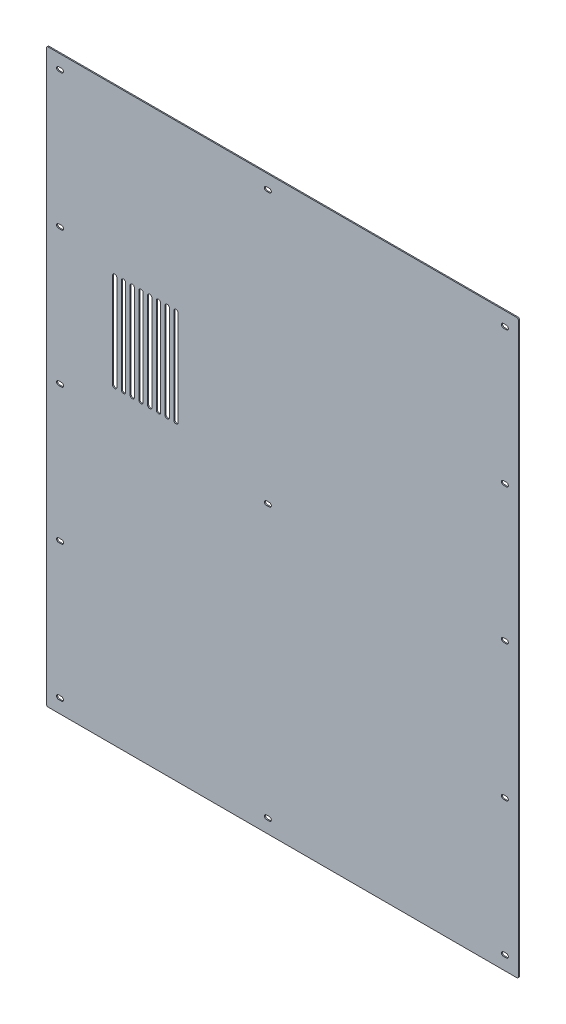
ISO-10303-21;
HEADER;
FILE_DESCRIPTION(('STEP AP214'),'2;1');
FILE_NAME('part.step','',(''),(''),'','','');
FILE_SCHEMA(('AUTOMOTIVE_DESIGN { 1 0 10303 214 1 1 1 1 }'));
ENDSEC;
DATA;
#1=APPLICATION_CONTEXT('core data for automotive mechanical design processes');
#2=APPLICATION_PROTOCOL_DEFINITION('international standard','automotive_design',2000,#1);
#3=PRODUCT_CONTEXT('',#1,'mechanical');
#4=PRODUCT('Part','Part','',(#3));
#5=PRODUCT_RELATED_PRODUCT_CATEGORY('part','',(#4));
#6=PRODUCT_DEFINITION_FORMATION('','',#4);
#7=PRODUCT_DEFINITION_CONTEXT('part definition',#1,'design');
#8=PRODUCT_DEFINITION('design','',#6,#7);
#9=PRODUCT_DEFINITION_SHAPE('','',#8);
#10=(LENGTH_UNIT() NAMED_UNIT(*) SI_UNIT(.MILLI.,.METRE.));
#11=(NAMED_UNIT(*) PLANE_ANGLE_UNIT() SI_UNIT($,.RADIAN.));
#12=(NAMED_UNIT(*) SI_UNIT($,.STERADIAN.) SOLID_ANGLE_UNIT());
#13=UNCERTAINTY_MEASURE_WITH_UNIT(LENGTH_MEASURE(1.E-05),#10,'distance_accuracy_value','');
#14=(GEOMETRIC_REPRESENTATION_CONTEXT(3) GLOBAL_UNCERTAINTY_ASSIGNED_CONTEXT((#13)) GLOBAL_UNIT_ASSIGNED_CONTEXT((#10,
#11,#12)) REPRESENTATION_CONTEXT('',''));
#15=CARTESIAN_POINT('',(0.,0.,0.));
#16=DIRECTION('',(0.,0.,1.));
#17=DIRECTION('',(1.,0.,0.));
#18=AXIS2_PLACEMENT_3D('',#15,#16,#17);
#19=CARTESIAN_POINT('',(-143.,35.,-1.5));
#20=DIRECTION('',(1.,0.,0.));
#21=DIRECTION('',(0.,0.,-1.));
#22=AXIS2_PLACEMENT_3D('',#19,#20,#21);
#23=PLANE('',#22);
#24=DIRECTION('',(0.,1.,0.));
#25=VECTOR('',#24,1.);
#26=CARTESIAN_POINT('',(-143.,35.,0.));
#27=LINE('',#26,#25);
#28=CARTESIAN_POINT('',(-143.,35.,0.));
#29=VERTEX_POINT('',#28);
#30=CARTESIAN_POINT('',(-143.,165.,0.));
#31=VERTEX_POINT('',#30);
#32=EDGE_CURVE('E1336',#29,#31,#27,.T.);
#33=ORIENTED_EDGE('',*,*,#32,.T.);
#34=DIRECTION('',(0.,0.,1.));
#35=VECTOR('',#34,1.);
#36=CARTESIAN_POINT('',(-143.,165.,-1.5));
#37=LINE('',#36,#35);
#38=CARTESIAN_POINT('',(-143.,165.,-1.5));
#39=VERTEX_POINT('',#38);
#40=EDGE_CURVE('E11',#39,#31,#37,.T.);
#41=ORIENTED_EDGE('',*,*,#40,.F.);
#42=DIRECTION('',(0.,1.,0.));
#43=VECTOR('',#42,1.);
#44=CARTESIAN_POINT('',(-143.,35.,-1.5));
#45=LINE('',#44,#43);
#46=CARTESIAN_POINT('',(-143.,35.,-1.5));
#47=VERTEX_POINT('',#46);
#48=EDGE_CURVE('E1340',#47,#39,#45,.T.);
#49=ORIENTED_EDGE('',*,*,#48,.F.);
#50=DIRECTION('',(0.,0.,1.));
#51=VECTOR('',#50,1.);
#52=CARTESIAN_POINT('',(-143.,35.,-1.5));
#53=LINE('',#52,#51);
#54=EDGE_CURVE('E1345',#47,#29,#53,.T.);
#55=ORIENTED_EDGE('',*,*,#54,.T.);
#56=EDGE_LOOP('',(#33,#41,#49,#55));
#57=FACE_BOUND('',#56,.T.);
#58=ADVANCED_FACE('F36',(#57),#23,.F.);
#59=CARTESIAN_POINT('',(-146.,165.,-1.5));
#60=DIRECTION('',(0.,0.,1.));
#61=DIRECTION('',(1.,0.,0.));
#62=AXIS2_PLACEMENT_3D('',#59,#60,#61);
#63=CYLINDRICAL_SURFACE('',#62,3.);
#64=CARTESIAN_POINT('',(-146.,165.,0.));
#65=DIRECTION('',(0.,0.,1.));
#66=DIRECTION('',(1.,0.,0.));
#67=AXIS2_PLACEMENT_3D('',#64,#65,#66);
#68=CIRCLE('',#67,3.);
#69=CARTESIAN_POINT('',(-149.,165.,0.));
#70=VERTEX_POINT('',#69);
#71=EDGE_CURVE('E1333',#31,#70,#68,.T.);
#72=ORIENTED_EDGE('',*,*,#71,.T.);
#73=DIRECTION('',(0.,0.,1.));
#74=VECTOR('',#73,1.);
#75=CARTESIAN_POINT('',(-149.,165.,-1.5));
#76=LINE('',#75,#74);
#77=CARTESIAN_POINT('',(-149.,165.,-1.5));
#78=VERTEX_POINT('',#77);
#79=EDGE_CURVE('E43',#78,#70,#76,.T.);
#80=ORIENTED_EDGE('',*,*,#79,.F.);
#81=CARTESIAN_POINT('',(-146.,165.,-1.5));
#82=DIRECTION('',(0.,0.,1.));
#83=DIRECTION('',(1.,0.,0.));
#84=AXIS2_PLACEMENT_3D('',#81,#82,#83);
#85=CIRCLE('',#84,3.);
#86=EDGE_CURVE('E57',#39,#78,#85,.T.);
#87=ORIENTED_EDGE('',*,*,#86,.F.);
#88=ORIENTED_EDGE('',*,*,#40,.T.);
#89=EDGE_LOOP('',(#72,#80,#87,#88));
#90=FACE_BOUND('',#89,.T.);
#91=ADVANCED_FACE('F1355',(#90),#63,.F.);
#92=CARTESIAN_POINT('',(-149.,35.,-1.5));
#93=DIRECTION('',(-1.,0.,0.));
#94=DIRECTION('',(0.,0.,1.));
#95=AXIS2_PLACEMENT_3D('',#92,#93,#94);
#96=PLANE('',#95);
#97=DIRECTION('',(0.,-1.,0.));
#98=VECTOR('',#97,1.);
#99=CARTESIAN_POINT('',(-149.,35.,0.));
#100=LINE('',#99,#98);
#101=CARTESIAN_POINT('',(-149.,35.,0.));
#102=VERTEX_POINT('',#101);
#103=EDGE_CURVE('E1330',#70,#102,#100,.T.);
#104=ORIENTED_EDGE('',*,*,#103,.T.);
#105=DIRECTION('',(0.,0.,1.));
#106=VECTOR('',#105,1.);
#107=CARTESIAN_POINT('',(-149.,35.,-1.5));
#108=LINE('',#107,#106);
#109=CARTESIAN_POINT('',(-149.,35.,-1.5));
#110=VERTEX_POINT('',#109);
#111=EDGE_CURVE('E1348',#110,#102,#108,.T.);
#112=ORIENTED_EDGE('',*,*,#111,.F.);
#113=DIRECTION('',(0.,-1.,0.));
#114=VECTOR('',#113,1.);
#115=CARTESIAN_POINT('',(-149.,35.,-1.5));
#116=LINE('',#115,#114);
#117=EDGE_CURVE('E1343',#78,#110,#116,.T.);
#118=ORIENTED_EDGE('',*,*,#117,.F.);
#119=ORIENTED_EDGE('',*,*,#79,.T.);
#120=EDGE_LOOP('',(#104,#112,#118,#119));
#121=FACE_BOUND('',#120,.T.);
#122=ADVANCED_FACE('F1352',(#121),#96,.F.);
#123=CARTESIAN_POINT('',(-146.,35.,-1.5));
#124=DIRECTION('',(0.,0.,1.));
#125=DIRECTION('',(1.,0.,0.));
#126=AXIS2_PLACEMENT_3D('',#123,#124,#125);
#127=CYLINDRICAL_SURFACE('',#126,3.);
#128=CARTESIAN_POINT('',(-146.,35.,0.));
#129=DIRECTION('',(0.,0.,1.));
#130=DIRECTION('',(1.,0.,0.));
#131=AXIS2_PLACEMENT_3D('',#128,#129,#130);
#132=CIRCLE('',#131,3.);
#133=EDGE_CURVE('E1328',#102,#29,#132,.T.);
#134=ORIENTED_EDGE('',*,*,#133,.T.);
#135=ORIENTED_EDGE('',*,*,#54,.F.);
#136=CARTESIAN_POINT('',(-146.,35.,-1.5));
#137=DIRECTION('',(0.,0.,1.));
#138=DIRECTION('',(1.,0.,0.));
#139=AXIS2_PLACEMENT_3D('',#136,#137,#138);
#140=CIRCLE('',#139,3.);
#141=EDGE_CURVE('E50',#110,#47,#140,.T.);
#142=ORIENTED_EDGE('',*,*,#141,.F.);
#143=ORIENTED_EDGE('',*,*,#111,.T.);
#144=EDGE_LOOP('',(#134,#135,#142,#143));
#145=FACE_BOUND('',#144,.T.);
#146=ADVANCED_FACE('F1361',(#145),#127,.F.);
#147=CARTESIAN_POINT('',(-155.,35.,-1.5));
#148=DIRECTION('',(1.,0.,0.));
#149=DIRECTION('',(0.,0.,-1.));
#150=AXIS2_PLACEMENT_3D('',#147,#148,#149);
#151=PLANE('',#150);
#152=DIRECTION('',(0.,1.,0.));
#153=VECTOR('',#152,1.);
#154=CARTESIAN_POINT('',(-155.,35.,0.));
#155=LINE('',#154,#153);
#156=CARTESIAN_POINT('',(-155.,35.,0.));
#157=VERTEX_POINT('',#156);
#158=CARTESIAN_POINT('',(-155.,165.,0.));
#159=VERTEX_POINT('',#158);
#160=EDGE_CURVE('E1304',#157,#159,#155,.T.);
#161=ORIENTED_EDGE('',*,*,#160,.T.);
#162=DIRECTION('',(0.,0.,1.));
#163=VECTOR('',#162,1.);
#164=CARTESIAN_POINT('',(-155.,165.,-1.5));
#165=LINE('',#164,#163);
#166=CARTESIAN_POINT('',(-155.,165.,-1.5));
#167=VERTEX_POINT('',#166);
#168=EDGE_CURVE('E1325',#167,#159,#165,.T.);
#169=ORIENTED_EDGE('',*,*,#168,.F.);
#170=DIRECTION('',(0.,1.,0.));
#171=VECTOR('',#170,1.);
#172=CARTESIAN_POINT('',(-155.,35.,-1.5));
#173=LINE('',#172,#171);
#174=CARTESIAN_POINT('',(-155.,35.,-1.5));
#175=VERTEX_POINT('',#174);
#176=EDGE_CURVE('E1309',#175,#167,#173,.T.);
#177=ORIENTED_EDGE('',*,*,#176,.F.);
#178=DIRECTION('',(0.,0.,1.));
#179=VECTOR('',#178,1.);
#180=CARTESIAN_POINT('',(-155.,35.,-1.5));
#181=LINE('',#180,#179);
#182=EDGE_CURVE('E1316',#175,#157,#181,.T.);
#183=ORIENTED_EDGE('',*,*,#182,.T.);
#184=EDGE_LOOP('',(#161,#169,#177,#183));
#185=FACE_BOUND('',#184,.T.);
#186=ADVANCED_FACE('F1363',(#185),#151,.F.);
#187=CARTESIAN_POINT('',(-158.,165.,-1.5));
#188=DIRECTION('',(0.,0.,1.));
#189=DIRECTION('',(1.,0.,0.));
#190=AXIS2_PLACEMENT_3D('',#187,#188,#189);
#191=CYLINDRICAL_SURFACE('',#190,3.);
#192=CARTESIAN_POINT('',(-158.,165.,0.));
#193=DIRECTION('',(0.,0.,1.));
#194=DIRECTION('',(1.,0.,0.));
#195=AXIS2_PLACEMENT_3D('',#192,#193,#194);
#196=CIRCLE('',#195,3.);
#197=CARTESIAN_POINT('',(-161.,165.,0.));
#198=VERTEX_POINT('',#197);
#199=EDGE_CURVE('E1301',#159,#198,#196,.T.);
#200=ORIENTED_EDGE('',*,*,#199,.T.);
#201=DIRECTION('',(0.,0.,1.));
#202=VECTOR('',#201,1.);
#203=CARTESIAN_POINT('',(-161.,165.,-1.5));
#204=LINE('',#203,#202);
#205=CARTESIAN_POINT('',(-161.,165.,-1.5));
#206=VERTEX_POINT('',#205);
#207=EDGE_CURVE('E1322',#206,#198,#204,.T.);
#208=ORIENTED_EDGE('',*,*,#207,.F.);
#209=CARTESIAN_POINT('',(-158.,165.,-1.5));
#210=DIRECTION('',(0.,0.,1.));
#211=DIRECTION('',(1.,0.,0.));
#212=AXIS2_PLACEMENT_3D('',#209,#210,#211);
#213=CIRCLE('',#212,3.);
#214=EDGE_CURVE('E1311',#167,#206,#213,.T.);
#215=ORIENTED_EDGE('',*,*,#214,.F.);
#216=ORIENTED_EDGE('',*,*,#168,.T.);
#217=EDGE_LOOP('',(#200,#208,#215,#216));
#218=FACE_BOUND('',#217,.T.);
#219=ADVANCED_FACE('F1369',(#218),#191,.F.);
#220=CARTESIAN_POINT('',(-161.,35.,-1.5));
#221=DIRECTION('',(-1.,0.,0.));
#222=DIRECTION('',(0.,0.,1.));
#223=AXIS2_PLACEMENT_3D('',#220,#221,#222);
#224=PLANE('',#223);
#225=DIRECTION('',(0.,-1.,0.));
#226=VECTOR('',#225,1.);
#227=CARTESIAN_POINT('',(-161.,35.,0.));
#228=LINE('',#227,#226);
#229=CARTESIAN_POINT('',(-161.,35.,0.));
#230=VERTEX_POINT('',#229);
#231=EDGE_CURVE('E1298',#198,#230,#228,.T.);
#232=ORIENTED_EDGE('',*,*,#231,.T.);
#233=DIRECTION('',(0.,0.,1.));
#234=VECTOR('',#233,1.);
#235=CARTESIAN_POINT('',(-161.,35.,-1.5));
#236=LINE('',#235,#234);
#237=CARTESIAN_POINT('',(-161.,35.,-1.5));
#238=VERTEX_POINT('',#237);
#239=EDGE_CURVE('E1319',#238,#230,#236,.T.);
#240=ORIENTED_EDGE('',*,*,#239,.F.);
#241=DIRECTION('',(0.,-1.,0.));
#242=VECTOR('',#241,1.);
#243=CARTESIAN_POINT('',(-161.,35.,-1.5));
#244=LINE('',#243,#242);
#245=EDGE_CURVE('E1313',#206,#238,#244,.T.);
#246=ORIENTED_EDGE('',*,*,#245,.F.);
#247=ORIENTED_EDGE('',*,*,#207,.T.);
#248=EDGE_LOOP('',(#232,#240,#246,#247));
#249=FACE_BOUND('',#248,.T.);
#250=ADVANCED_FACE('F1405',(#249),#224,.F.);
#251=CARTESIAN_POINT('',(-158.,35.,-1.5));
#252=DIRECTION('',(0.,0.,1.));
#253=DIRECTION('',(1.,0.,0.));
#254=AXIS2_PLACEMENT_3D('',#251,#252,#253);
#255=CYLINDRICAL_SURFACE('',#254,3.);
#256=CARTESIAN_POINT('',(-158.,35.,0.));
#257=DIRECTION('',(0.,0.,1.));
#258=DIRECTION('',(1.,0.,0.));
#259=AXIS2_PLACEMENT_3D('',#256,#257,#258);
#260=CIRCLE('',#259,3.);
#261=EDGE_CURVE('E1296',#230,#157,#260,.T.);
#262=ORIENTED_EDGE('',*,*,#261,.T.);
#263=ORIENTED_EDGE('',*,*,#182,.F.);
#264=CARTESIAN_POINT('',(-158.,35.,-1.5));
#265=DIRECTION('',(0.,0.,1.));
#266=DIRECTION('',(1.,0.,0.));
#267=AXIS2_PLACEMENT_3D('',#264,#265,#266);
#268=CIRCLE('',#267,3.);
#269=EDGE_CURVE('E1307',#238,#175,#268,.T.);
#270=ORIENTED_EDGE('',*,*,#269,.F.);
#271=ORIENTED_EDGE('',*,*,#239,.T.);
#272=EDGE_LOOP('',(#262,#263,#270,#271));
#273=FACE_BOUND('',#272,.T.);
#274=ADVANCED_FACE('F1416',(#273),#255,.F.);
#275=CARTESIAN_POINT('',(-167.,35.,-1.5));
#276=DIRECTION('',(1.,0.,0.));
#277=DIRECTION('',(0.,0.,-1.));
#278=AXIS2_PLACEMENT_3D('',#275,#276,#277);
#279=PLANE('',#278);
#280=DIRECTION('',(0.,1.,0.));
#281=VECTOR('',#280,1.);
#282=CARTESIAN_POINT('',(-167.,35.,0.));
#283=LINE('',#282,#281);
#284=CARTESIAN_POINT('',(-167.,35.,0.));
#285=VERTEX_POINT('',#284);
#286=CARTESIAN_POINT('',(-167.,165.,0.));
#287=VERTEX_POINT('',#286);
#288=EDGE_CURVE('E1272',#285,#287,#283,.T.);
#289=ORIENTED_EDGE('',*,*,#288,.T.);
#290=DIRECTION('',(0.,0.,1.));
#291=VECTOR('',#290,1.);
#292=CARTESIAN_POINT('',(-167.,165.,-1.5));
#293=LINE('',#292,#291);
#294=CARTESIAN_POINT('',(-167.,165.,-1.5));
#295=VERTEX_POINT('',#294);
#296=EDGE_CURVE('E1293',#295,#287,#293,.T.);
#297=ORIENTED_EDGE('',*,*,#296,.F.);
#298=DIRECTION('',(0.,1.,0.));
#299=VECTOR('',#298,1.);
#300=CARTESIAN_POINT('',(-167.,35.,-1.5));
#301=LINE('',#300,#299);
#302=CARTESIAN_POINT('',(-167.,35.,-1.5));
#303=VERTEX_POINT('',#302);
#304=EDGE_CURVE('E1277',#303,#295,#301,.T.);
#305=ORIENTED_EDGE('',*,*,#304,.F.);
#306=DIRECTION('',(0.,0.,1.));
#307=VECTOR('',#306,1.);
#308=CARTESIAN_POINT('',(-167.,35.,-1.5));
#309=LINE('',#308,#307);
#310=EDGE_CURVE('E1284',#303,#285,#309,.T.);
#311=ORIENTED_EDGE('',*,*,#310,.T.);
#312=EDGE_LOOP('',(#289,#297,#305,#311));
#313=FACE_BOUND('',#312,.T.);
#314=ADVANCED_FACE('F1427',(#313),#279,.F.);
#315=CARTESIAN_POINT('',(-170.,165.,-1.5));
#316=DIRECTION('',(0.,0.,1.));
#317=DIRECTION('',(1.,0.,0.));
#318=AXIS2_PLACEMENT_3D('',#315,#316,#317);
#319=CYLINDRICAL_SURFACE('',#318,3.);
#320=CARTESIAN_POINT('',(-170.,165.,0.));
#321=DIRECTION('',(0.,0.,1.));
#322=DIRECTION('',(1.,0.,0.));
#323=AXIS2_PLACEMENT_3D('',#320,#321,#322);
#324=CIRCLE('',#323,3.);
#325=CARTESIAN_POINT('',(-173.,165.,0.));
#326=VERTEX_POINT('',#325);
#327=EDGE_CURVE('E1269',#287,#326,#324,.T.);
#328=ORIENTED_EDGE('',*,*,#327,.T.);
#329=DIRECTION('',(0.,0.,1.));
#330=VECTOR('',#329,1.);
#331=CARTESIAN_POINT('',(-173.,165.,-1.5));
#332=LINE('',#331,#330);
#333=CARTESIAN_POINT('',(-173.,165.,-1.5));
#334=VERTEX_POINT('',#333);
#335=EDGE_CURVE('E1290',#334,#326,#332,.T.);
#336=ORIENTED_EDGE('',*,*,#335,.F.);
#337=CARTESIAN_POINT('',(-170.,165.,-1.5));
#338=DIRECTION('',(0.,0.,1.));
#339=DIRECTION('',(1.,0.,0.));
#340=AXIS2_PLACEMENT_3D('',#337,#338,#339);
#341=CIRCLE('',#340,3.);
#342=EDGE_CURVE('E1279',#295,#334,#341,.T.);
#343=ORIENTED_EDGE('',*,*,#342,.F.);
#344=ORIENTED_EDGE('',*,*,#296,.T.);
#345=EDGE_LOOP('',(#328,#336,#343,#344));
#346=FACE_BOUND('',#345,.T.);
#347=ADVANCED_FACE('F1438',(#346),#319,.F.);
#348=CARTESIAN_POINT('',(-173.,35.,-1.5));
#349=DIRECTION('',(-1.,0.,0.));
#350=DIRECTION('',(0.,0.,1.));
#351=AXIS2_PLACEMENT_3D('',#348,#349,#350);
#352=PLANE('',#351);
#353=DIRECTION('',(0.,-1.,0.));
#354=VECTOR('',#353,1.);
#355=CARTESIAN_POINT('',(-173.,35.,0.));
#356=LINE('',#355,#354);
#357=CARTESIAN_POINT('',(-173.,35.,0.));
#358=VERTEX_POINT('',#357);
#359=EDGE_CURVE('E1266',#326,#358,#356,.T.);
#360=ORIENTED_EDGE('',*,*,#359,.T.);
#361=DIRECTION('',(0.,0.,1.));
#362=VECTOR('',#361,1.);
#363=CARTESIAN_POINT('',(-173.,35.,-1.5));
#364=LINE('',#363,#362);
#365=CARTESIAN_POINT('',(-173.,35.,-1.5));
#366=VERTEX_POINT('',#365);
#367=EDGE_CURVE('E1287',#366,#358,#364,.T.);
#368=ORIENTED_EDGE('',*,*,#367,.F.);
#369=DIRECTION('',(0.,-1.,0.));
#370=VECTOR('',#369,1.);
#371=CARTESIAN_POINT('',(-173.,35.,-1.5));
#372=LINE('',#371,#370);
#373=EDGE_CURVE('E1281',#334,#366,#372,.T.);
#374=ORIENTED_EDGE('',*,*,#373,.F.);
#375=ORIENTED_EDGE('',*,*,#335,.T.);
#376=EDGE_LOOP('',(#360,#368,#374,#375));
#377=FACE_BOUND('',#376,.T.);
#378=ADVANCED_FACE('F1449',(#377),#352,.F.);
#379=CARTESIAN_POINT('',(-170.,35.,-1.5));
#380=DIRECTION('',(0.,0.,1.));
#381=DIRECTION('',(1.,0.,0.));
#382=AXIS2_PLACEMENT_3D('',#379,#380,#381);
#383=CYLINDRICAL_SURFACE('',#382,3.);
#384=CARTESIAN_POINT('',(-170.,35.,0.));
#385=DIRECTION('',(0.,0.,1.));
#386=DIRECTION('',(1.,0.,0.));
#387=AXIS2_PLACEMENT_3D('',#384,#385,#386);
#388=CIRCLE('',#387,3.);
#389=EDGE_CURVE('E1264',#358,#285,#388,.T.);
#390=ORIENTED_EDGE('',*,*,#389,.T.);
#391=ORIENTED_EDGE('',*,*,#310,.F.);
#392=CARTESIAN_POINT('',(-170.,35.,-1.5));
#393=DIRECTION('',(0.,0.,1.));
#394=DIRECTION('',(1.,0.,0.));
#395=AXIS2_PLACEMENT_3D('',#392,#393,#394);
#396=CIRCLE('',#395,3.);
#397=EDGE_CURVE('E1275',#366,#303,#396,.T.);
#398=ORIENTED_EDGE('',*,*,#397,.F.);
#399=ORIENTED_EDGE('',*,*,#367,.T.);
#400=EDGE_LOOP('',(#390,#391,#398,#399));
#401=FACE_BOUND('',#400,.T.);
#402=ADVANCED_FACE('F1460',(#401),#383,.F.);
#403=CARTESIAN_POINT('',(-179.,35.,-1.5));
#404=DIRECTION('',(1.,0.,0.));
#405=DIRECTION('',(0.,0.,-1.));
#406=AXIS2_PLACEMENT_3D('',#403,#404,#405);
#407=PLANE('',#406);
#408=DIRECTION('',(0.,1.,0.));
#409=VECTOR('',#408,1.);
#410=CARTESIAN_POINT('',(-179.,35.,0.));
#411=LINE('',#410,#409);
#412=CARTESIAN_POINT('',(-179.,35.,0.));
#413=VERTEX_POINT('',#412);
#414=CARTESIAN_POINT('',(-179.,165.,0.));
#415=VERTEX_POINT('',#414);
#416=EDGE_CURVE('E1240',#413,#415,#411,.T.);
#417=ORIENTED_EDGE('',*,*,#416,.T.);
#418=DIRECTION('',(0.,0.,1.));
#419=VECTOR('',#418,1.);
#420=CARTESIAN_POINT('',(-179.,165.,-1.5));
#421=LINE('',#420,#419);
#422=CARTESIAN_POINT('',(-179.,165.,-1.5));
#423=VERTEX_POINT('',#422);
#424=EDGE_CURVE('E1261',#423,#415,#421,.T.);
#425=ORIENTED_EDGE('',*,*,#424,.F.);
#426=DIRECTION('',(0.,1.,0.));
#427=VECTOR('',#426,1.);
#428=CARTESIAN_POINT('',(-179.,35.,-1.5));
#429=LINE('',#428,#427);
#430=CARTESIAN_POINT('',(-179.,35.,-1.5));
#431=VERTEX_POINT('',#430);
#432=EDGE_CURVE('E1245',#431,#423,#429,.T.);
#433=ORIENTED_EDGE('',*,*,#432,.F.);
#434=DIRECTION('',(0.,0.,1.));
#435=VECTOR('',#434,1.);
#436=CARTESIAN_POINT('',(-179.,35.,-1.5));
#437=LINE('',#436,#435);
#438=EDGE_CURVE('E1252',#431,#413,#437,.T.);
#439=ORIENTED_EDGE('',*,*,#438,.T.);
#440=EDGE_LOOP('',(#417,#425,#433,#439));
#441=FACE_BOUND('',#440,.T.);
#442=ADVANCED_FACE('F1471',(#441),#407,.F.);
#443=CARTESIAN_POINT('',(-182.,165.,-1.5));
#444=DIRECTION('',(0.,0.,1.));
#445=DIRECTION('',(1.,0.,0.));
#446=AXIS2_PLACEMENT_3D('',#443,#444,#445);
#447=CYLINDRICAL_SURFACE('',#446,3.);
#448=CARTESIAN_POINT('',(-182.,165.,0.));
#449=DIRECTION('',(0.,0.,1.));
#450=DIRECTION('',(1.,0.,0.));
#451=AXIS2_PLACEMENT_3D('',#448,#449,#450);
#452=CIRCLE('',#451,3.);
#453=CARTESIAN_POINT('',(-185.,165.,0.));
#454=VERTEX_POINT('',#453);
#455=EDGE_CURVE('E1237',#415,#454,#452,.T.);
#456=ORIENTED_EDGE('',*,*,#455,.T.);
#457=DIRECTION('',(0.,0.,1.));
#458=VECTOR('',#457,1.);
#459=CARTESIAN_POINT('',(-185.,165.,-1.5));
#460=LINE('',#459,#458);
#461=CARTESIAN_POINT('',(-185.,165.,-1.5));
#462=VERTEX_POINT('',#461);
#463=EDGE_CURVE('E1258',#462,#454,#460,.T.);
#464=ORIENTED_EDGE('',*,*,#463,.F.);
#465=CARTESIAN_POINT('',(-182.,165.,-1.5));
#466=DIRECTION('',(0.,0.,1.));
#467=DIRECTION('',(1.,0.,0.));
#468=AXIS2_PLACEMENT_3D('',#465,#466,#467);
#469=CIRCLE('',#468,3.);
#470=EDGE_CURVE('E1247',#423,#462,#469,.T.);
#471=ORIENTED_EDGE('',*,*,#470,.F.);
#472=ORIENTED_EDGE('',*,*,#424,.T.);
#473=EDGE_LOOP('',(#456,#464,#471,#472));
#474=FACE_BOUND('',#473,.T.);
#475=ADVANCED_FACE('F1482',(#474),#447,.F.);
#476=CARTESIAN_POINT('',(-185.,35.,-1.5));
#477=DIRECTION('',(-1.,0.,0.));
#478=DIRECTION('',(0.,0.,1.));
#479=AXIS2_PLACEMENT_3D('',#476,#477,#478);
#480=PLANE('',#479);
#481=DIRECTION('',(0.,-1.,0.));
#482=VECTOR('',#481,1.);
#483=CARTESIAN_POINT('',(-185.,35.,0.));
#484=LINE('',#483,#482);
#485=CARTESIAN_POINT('',(-185.,35.,0.));
#486=VERTEX_POINT('',#485);
#487=EDGE_CURVE('E1234',#454,#486,#484,.T.);
#488=ORIENTED_EDGE('',*,*,#487,.T.);
#489=DIRECTION('',(0.,0.,1.));
#490=VECTOR('',#489,1.);
#491=CARTESIAN_POINT('',(-185.,35.,-1.5));
#492=LINE('',#491,#490);
#493=CARTESIAN_POINT('',(-185.,35.,-1.5));
#494=VERTEX_POINT('',#493);
#495=EDGE_CURVE('E1255',#494,#486,#492,.T.);
#496=ORIENTED_EDGE('',*,*,#495,.F.);
#497=DIRECTION('',(0.,-1.,0.));
#498=VECTOR('',#497,1.);
#499=CARTESIAN_POINT('',(-185.,35.,-1.5));
#500=LINE('',#499,#498);
#501=EDGE_CURVE('E1249',#462,#494,#500,.T.);
#502=ORIENTED_EDGE('',*,*,#501,.F.);
#503=ORIENTED_EDGE('',*,*,#463,.T.);
#504=EDGE_LOOP('',(#488,#496,#502,#503));
#505=FACE_BOUND('',#504,.T.);
#506=ADVANCED_FACE('F1493',(#505),#480,.F.);
#507=CARTESIAN_POINT('',(-182.,35.,-1.5));
#508=DIRECTION('',(0.,0.,1.));
#509=DIRECTION('',(1.,0.,0.));
#510=AXIS2_PLACEMENT_3D('',#507,#508,#509);
#511=CYLINDRICAL_SURFACE('',#510,3.);
#512=CARTESIAN_POINT('',(-182.,35.,0.));
#513=DIRECTION('',(0.,0.,1.));
#514=DIRECTION('',(1.,0.,0.));
#515=AXIS2_PLACEMENT_3D('',#512,#513,#514);
#516=CIRCLE('',#515,3.);
#517=EDGE_CURVE('E1232',#486,#413,#516,.T.);
#518=ORIENTED_EDGE('',*,*,#517,.T.);
#519=ORIENTED_EDGE('',*,*,#438,.F.);
#520=CARTESIAN_POINT('',(-182.,35.,-1.5));
#521=DIRECTION('',(0.,0.,1.));
#522=DIRECTION('',(1.,0.,0.));
#523=AXIS2_PLACEMENT_3D('',#520,#521,#522);
#524=CIRCLE('',#523,3.);
#525=EDGE_CURVE('E1243',#494,#431,#524,.T.);
#526=ORIENTED_EDGE('',*,*,#525,.F.);
#527=ORIENTED_EDGE('',*,*,#495,.T.);
#528=EDGE_LOOP('',(#518,#519,#526,#527));
#529=FACE_BOUND('',#528,.T.);
#530=ADVANCED_FACE('F1504',(#529),#511,.F.);
#531=CARTESIAN_POINT('',(-191.,35.,-1.5));
#532=DIRECTION('',(1.,0.,0.));
#533=DIRECTION('',(0.,0.,-1.));
#534=AXIS2_PLACEMENT_3D('',#531,#532,#533);
#535=PLANE('',#534);
#536=DIRECTION('',(0.,1.,0.));
#537=VECTOR('',#536,1.);
#538=CARTESIAN_POINT('',(-191.,35.,0.));
#539=LINE('',#538,#537);
#540=CARTESIAN_POINT('',(-191.,35.,0.));
#541=VERTEX_POINT('',#540);
#542=CARTESIAN_POINT('',(-191.,165.,0.));
#543=VERTEX_POINT('',#542);
#544=EDGE_CURVE('E1208',#541,#543,#539,.T.);
#545=ORIENTED_EDGE('',*,*,#544,.T.);
#546=DIRECTION('',(0.,0.,1.));
#547=VECTOR('',#546,1.);
#548=CARTESIAN_POINT('',(-191.,165.,-1.5));
#549=LINE('',#548,#547);
#550=CARTESIAN_POINT('',(-191.,165.,-1.5));
#551=VERTEX_POINT('',#550);
#552=EDGE_CURVE('E1229',#551,#543,#549,.T.);
#553=ORIENTED_EDGE('',*,*,#552,.F.);
#554=DIRECTION('',(0.,1.,0.));
#555=VECTOR('',#554,1.);
#556=CARTESIAN_POINT('',(-191.,35.,-1.5));
#557=LINE('',#556,#555);
#558=CARTESIAN_POINT('',(-191.,35.,-1.5));
#559=VERTEX_POINT('',#558);
#560=EDGE_CURVE('E1213',#559,#551,#557,.T.);
#561=ORIENTED_EDGE('',*,*,#560,.F.);
#562=DIRECTION('',(0.,0.,1.));
#563=VECTOR('',#562,1.);
#564=CARTESIAN_POINT('',(-191.,35.,-1.5));
#565=LINE('',#564,#563);
#566=EDGE_CURVE('E1220',#559,#541,#565,.T.);
#567=ORIENTED_EDGE('',*,*,#566,.T.);
#568=EDGE_LOOP('',(#545,#553,#561,#567));
#569=FACE_BOUND('',#568,.T.);
#570=ADVANCED_FACE('F1515',(#569),#535,.F.);
#571=CARTESIAN_POINT('',(-194.,165.,-1.5));
#572=DIRECTION('',(0.,0.,1.));
#573=DIRECTION('',(1.,0.,0.));
#574=AXIS2_PLACEMENT_3D('',#571,#572,#573);
#575=CYLINDRICAL_SURFACE('',#574,3.);
#576=CARTESIAN_POINT('',(-194.,165.,0.));
#577=DIRECTION('',(0.,0.,1.));
#578=DIRECTION('',(1.,0.,0.));
#579=AXIS2_PLACEMENT_3D('',#576,#577,#578);
#580=CIRCLE('',#579,3.);
#581=CARTESIAN_POINT('',(-197.,165.,0.));
#582=VERTEX_POINT('',#581);
#583=EDGE_CURVE('E1205',#543,#582,#580,.T.);
#584=ORIENTED_EDGE('',*,*,#583,.T.);
#585=DIRECTION('',(0.,0.,1.));
#586=VECTOR('',#585,1.);
#587=CARTESIAN_POINT('',(-197.,165.,-1.5));
#588=LINE('',#587,#586);
#589=CARTESIAN_POINT('',(-197.,165.,-1.5));
#590=VERTEX_POINT('',#589);
#591=EDGE_CURVE('E1226',#590,#582,#588,.T.);
#592=ORIENTED_EDGE('',*,*,#591,.F.);
#593=CARTESIAN_POINT('',(-194.,165.,-1.5));
#594=DIRECTION('',(0.,0.,1.));
#595=DIRECTION('',(1.,0.,0.));
#596=AXIS2_PLACEMENT_3D('',#593,#594,#595);
#597=CIRCLE('',#596,3.);
#598=EDGE_CURVE('E1215',#551,#590,#597,.T.);
#599=ORIENTED_EDGE('',*,*,#598,.F.);
#600=ORIENTED_EDGE('',*,*,#552,.T.);
#601=EDGE_LOOP('',(#584,#592,#599,#600));
#602=FACE_BOUND('',#601,.T.);
#603=ADVANCED_FACE('F1526',(#602),#575,.F.);
#604=CARTESIAN_POINT('',(-197.,35.,-1.5));
#605=DIRECTION('',(-1.,0.,0.));
#606=DIRECTION('',(0.,0.,1.));
#607=AXIS2_PLACEMENT_3D('',#604,#605,#606);
#608=PLANE('',#607);
#609=DIRECTION('',(0.,-1.,0.));
#610=VECTOR('',#609,1.);
#611=CARTESIAN_POINT('',(-197.,35.,0.));
#612=LINE('',#611,#610);
#613=CARTESIAN_POINT('',(-197.,35.,0.));
#614=VERTEX_POINT('',#613);
#615=EDGE_CURVE('E1202',#582,#614,#612,.T.);
#616=ORIENTED_EDGE('',*,*,#615,.T.);
#617=DIRECTION('',(0.,0.,1.));
#618=VECTOR('',#617,1.);
#619=CARTESIAN_POINT('',(-197.,35.,-1.5));
#620=LINE('',#619,#618);
#621=CARTESIAN_POINT('',(-197.,35.,-1.5));
#622=VERTEX_POINT('',#621);
#623=EDGE_CURVE('E1223',#622,#614,#620,.T.);
#624=ORIENTED_EDGE('',*,*,#623,.F.);
#625=DIRECTION('',(0.,-1.,0.));
#626=VECTOR('',#625,1.);
#627=CARTESIAN_POINT('',(-197.,35.,-1.5));
#628=LINE('',#627,#626);
#629=EDGE_CURVE('E1217',#590,#622,#628,.T.);
#630=ORIENTED_EDGE('',*,*,#629,.F.);
#631=ORIENTED_EDGE('',*,*,#591,.T.);
#632=EDGE_LOOP('',(#616,#624,#630,#631));
#633=FACE_BOUND('',#632,.T.);
#634=ADVANCED_FACE('F1537',(#633),#608,.F.);
#635=CARTESIAN_POINT('',(-194.,35.,-1.5));
#636=DIRECTION('',(0.,0.,1.));
#637=DIRECTION('',(1.,0.,0.));
#638=AXIS2_PLACEMENT_3D('',#635,#636,#637);
#639=CYLINDRICAL_SURFACE('',#638,3.);
#640=CARTESIAN_POINT('',(-194.,35.,0.));
#641=DIRECTION('',(0.,0.,1.));
#642=DIRECTION('',(1.,0.,0.));
#643=AXIS2_PLACEMENT_3D('',#640,#641,#642);
#644=CIRCLE('',#643,3.);
#645=EDGE_CURVE('E1200',#614,#541,#644,.T.);
#646=ORIENTED_EDGE('',*,*,#645,.T.);
#647=ORIENTED_EDGE('',*,*,#566,.F.);
#648=CARTESIAN_POINT('',(-194.,35.,-1.5));
#649=DIRECTION('',(0.,0.,1.));
#650=DIRECTION('',(1.,0.,0.));
#651=AXIS2_PLACEMENT_3D('',#648,#649,#650);
#652=CIRCLE('',#651,3.);
#653=EDGE_CURVE('E1211',#622,#559,#652,.T.);
#654=ORIENTED_EDGE('',*,*,#653,.F.);
#655=ORIENTED_EDGE('',*,*,#623,.T.);
#656=EDGE_LOOP('',(#646,#647,#654,#655));
#657=FACE_BOUND('',#656,.T.);
#658=ADVANCED_FACE('F1548',(#657),#639,.F.);
#659=CARTESIAN_POINT('',(-203.,35.,-1.5));
#660=DIRECTION('',(1.,0.,0.));
#661=DIRECTION('',(0.,0.,-1.));
#662=AXIS2_PLACEMENT_3D('',#659,#660,#661);
#663=PLANE('',#662);
#664=DIRECTION('',(0.,1.,0.));
#665=VECTOR('',#664,1.);
#666=CARTESIAN_POINT('',(-203.,35.,0.));
#667=LINE('',#666,#665);
#668=CARTESIAN_POINT('',(-203.,35.,0.));
#669=VERTEX_POINT('',#668);
#670=CARTESIAN_POINT('',(-203.,165.,0.));
#671=VERTEX_POINT('',#670);
#672=EDGE_CURVE('E1176',#669,#671,#667,.T.);
#673=ORIENTED_EDGE('',*,*,#672,.T.);
#674=DIRECTION('',(0.,0.,1.));
#675=VECTOR('',#674,1.);
#676=CARTESIAN_POINT('',(-203.,165.,-1.5));
#677=LINE('',#676,#675);
#678=CARTESIAN_POINT('',(-203.,165.,-1.5));
#679=VERTEX_POINT('',#678);
#680=EDGE_CURVE('E1197',#679,#671,#677,.T.);
#681=ORIENTED_EDGE('',*,*,#680,.F.);
#682=DIRECTION('',(0.,1.,0.));
#683=VECTOR('',#682,1.);
#684=CARTESIAN_POINT('',(-203.,35.,-1.5));
#685=LINE('',#684,#683);
#686=CARTESIAN_POINT('',(-203.,35.,-1.5));
#687=VERTEX_POINT('',#686);
#688=EDGE_CURVE('E1181',#687,#679,#685,.T.);
#689=ORIENTED_EDGE('',*,*,#688,.F.);
#690=DIRECTION('',(0.,0.,1.));
#691=VECTOR('',#690,1.);
#692=CARTESIAN_POINT('',(-203.,35.,-1.5));
#693=LINE('',#692,#691);
#694=EDGE_CURVE('E1188',#687,#669,#693,.T.);
#695=ORIENTED_EDGE('',*,*,#694,.T.);
#696=EDGE_LOOP('',(#673,#681,#689,#695));
#697=FACE_BOUND('',#696,.T.);
#698=ADVANCED_FACE('F1559',(#697),#663,.F.);
#699=CARTESIAN_POINT('',(-206.,165.,-1.5));
#700=DIRECTION('',(0.,0.,1.));
#701=DIRECTION('',(1.,0.,0.));
#702=AXIS2_PLACEMENT_3D('',#699,#700,#701);
#703=CYLINDRICAL_SURFACE('',#702,3.);
#704=CARTESIAN_POINT('',(-206.,165.,0.));
#705=DIRECTION('',(0.,0.,1.));
#706=DIRECTION('',(1.,0.,0.));
#707=AXIS2_PLACEMENT_3D('',#704,#705,#706);
#708=CIRCLE('',#707,3.);
#709=CARTESIAN_POINT('',(-209.,165.,0.));
#710=VERTEX_POINT('',#709);
#711=EDGE_CURVE('E1173',#671,#710,#708,.T.);
#712=ORIENTED_EDGE('',*,*,#711,.T.);
#713=DIRECTION('',(0.,0.,1.));
#714=VECTOR('',#713,1.);
#715=CARTESIAN_POINT('',(-209.,165.,-1.5));
#716=LINE('',#715,#714);
#717=CARTESIAN_POINT('',(-209.,165.,-1.5));
#718=VERTEX_POINT('',#717);
#719=EDGE_CURVE('E1194',#718,#710,#716,.T.);
#720=ORIENTED_EDGE('',*,*,#719,.F.);
#721=CARTESIAN_POINT('',(-206.,165.,-1.5));
#722=DIRECTION('',(0.,0.,1.));
#723=DIRECTION('',(1.,0.,0.));
#724=AXIS2_PLACEMENT_3D('',#721,#722,#723);
#725=CIRCLE('',#724,3.);
#726=EDGE_CURVE('E1183',#679,#718,#725,.T.);
#727=ORIENTED_EDGE('',*,*,#726,.F.);
#728=ORIENTED_EDGE('',*,*,#680,.T.);
#729=EDGE_LOOP('',(#712,#720,#727,#728));
#730=FACE_BOUND('',#729,.T.);
#731=ADVANCED_FACE('F1570',(#730),#703,.F.);
#732=CARTESIAN_POINT('',(-209.,35.,-1.5));
#733=DIRECTION('',(-1.,0.,0.));
#734=DIRECTION('',(0.,0.,1.));
#735=AXIS2_PLACEMENT_3D('',#732,#733,#734);
#736=PLANE('',#735);
#737=DIRECTION('',(0.,-1.,0.));
#738=VECTOR('',#737,1.);
#739=CARTESIAN_POINT('',(-209.,35.,0.));
#740=LINE('',#739,#738);
#741=CARTESIAN_POINT('',(-209.,35.,0.));
#742=VERTEX_POINT('',#741);
#743=EDGE_CURVE('E1170',#710,#742,#740,.T.);
#744=ORIENTED_EDGE('',*,*,#743,.T.);
#745=DIRECTION('',(0.,0.,1.));
#746=VECTOR('',#745,1.);
#747=CARTESIAN_POINT('',(-209.,35.,-1.5));
#748=LINE('',#747,#746);
#749=CARTESIAN_POINT('',(-209.,35.,-1.5));
#750=VERTEX_POINT('',#749);
#751=EDGE_CURVE('E1191',#750,#742,#748,.T.);
#752=ORIENTED_EDGE('',*,*,#751,.F.);
#753=DIRECTION('',(0.,-1.,0.));
#754=VECTOR('',#753,1.);
#755=CARTESIAN_POINT('',(-209.,35.,-1.5));
#756=LINE('',#755,#754);
#757=EDGE_CURVE('E1185',#718,#750,#756,.T.);
#758=ORIENTED_EDGE('',*,*,#757,.F.);
#759=ORIENTED_EDGE('',*,*,#719,.T.);
#760=EDGE_LOOP('',(#744,#752,#758,#759));
#761=FACE_BOUND('',#760,.T.);
#762=ADVANCED_FACE('F1581',(#761),#736,.F.);
#763=CARTESIAN_POINT('',(-206.,35.,-1.5));
#764=DIRECTION('',(0.,0.,1.));
#765=DIRECTION('',(1.,0.,0.));
#766=AXIS2_PLACEMENT_3D('',#763,#764,#765);
#767=CYLINDRICAL_SURFACE('',#766,3.);
#768=CARTESIAN_POINT('',(-206.,35.,0.));
#769=DIRECTION('',(0.,0.,1.));
#770=DIRECTION('',(1.,0.,0.));
#771=AXIS2_PLACEMENT_3D('',#768,#769,#770);
#772=CIRCLE('',#771,3.);
#773=EDGE_CURVE('E1168',#742,#669,#772,.T.);
#774=ORIENTED_EDGE('',*,*,#773,.T.);
#775=ORIENTED_EDGE('',*,*,#694,.F.);
#776=CARTESIAN_POINT('',(-206.,35.,-1.5));
#777=DIRECTION('',(0.,0.,1.));
#778=DIRECTION('',(1.,0.,0.));
#779=AXIS2_PLACEMENT_3D('',#776,#777,#778);
#780=CIRCLE('',#779,3.);
#781=EDGE_CURVE('E1179',#750,#687,#780,.T.);
#782=ORIENTED_EDGE('',*,*,#781,.F.);
#783=ORIENTED_EDGE('',*,*,#751,.T.);
#784=EDGE_LOOP('',(#774,#775,#782,#783));
#785=FACE_BOUND('',#784,.T.);
#786=ADVANCED_FACE('F1592',(#785),#767,.F.);
#787=CARTESIAN_POINT('',(323.5,-392.,-1.5));
#788=DIRECTION('',(1.,0.,0.));
#789=DIRECTION('',(0.,0.,-1.));
#790=AXIS2_PLACEMENT_3D('',#787,#788,#789);
#791=PLANE('',#790);
#792=DIRECTION('',(0.,1.,0.));
#793=VECTOR('',#792,1.);
#794=CARTESIAN_POINT('',(323.5,-392.,0.));
#795=LINE('',#794,#793);
#796=CARTESIAN_POINT('',(323.5,-390.,0.));
#797=VERTEX_POINT('',#796);
#798=CARTESIAN_POINT('',(323.5,390.,0.));
#799=VERTEX_POINT('',#798);
#800=EDGE_CURVE('E1100',#797,#799,#795,.T.);
#801=ORIENTED_EDGE('',*,*,#800,.F.);
#802=DIRECTION('',(0.,0.,1.));
#803=VECTOR('',#802,1.);
#804=CARTESIAN_POINT('',(323.5,-390.,-1.5));
#805=LINE('',#804,#803);
#806=CARTESIAN_POINT('',(323.5,-390.,-1.5));
#807=VERTEX_POINT('',#806);
#808=EDGE_CURVE('E1148',#797,#807,#805,.F.);
#809=ORIENTED_EDGE('',*,*,#808,.T.);
#810=DIRECTION('',(0.,1.,0.));
#811=VECTOR('',#810,1.);
#812=CARTESIAN_POINT('',(323.5,-392.,-1.5));
#813=LINE('',#812,#811);
#814=CARTESIAN_POINT('',(323.5,390.,-1.5));
#815=VERTEX_POINT('',#814);
#816=EDGE_CURVE('E1109',#807,#815,#813,.T.);
#817=ORIENTED_EDGE('',*,*,#816,.T.);
#818=DIRECTION('',(0.,0.,1.));
#819=VECTOR('',#818,1.);
#820=CARTESIAN_POINT('',(323.5,390.,-1.5));
#821=LINE('',#820,#819);
#822=EDGE_CURVE('E1145',#815,#799,#821,.T.);
#823=ORIENTED_EDGE('',*,*,#822,.T.);
#824=EDGE_LOOP('',(#801,#809,#817,#823));
#825=FACE_BOUND('',#824,.T.);
#826=ADVANCED_FACE('F1603',(#825),#791,.T.);
#827=CARTESIAN_POINT('',(-323.5,-392.,-1.5));
#828=DIRECTION('',(0.,-1.,0.));
#829=DIRECTION('',(0.,0.,-1.));
#830=AXIS2_PLACEMENT_3D('',#827,#828,#829);
#831=PLANE('',#830);
#832=DIRECTION('',(1.,0.,0.));
#833=VECTOR('',#832,1.);
#834=CARTESIAN_POINT('',(-323.5,-392.,-1.5));
#835=LINE('',#834,#833);
#836=CARTESIAN_POINT('',(-321.5,-392.,-1.5));
#837=VERTEX_POINT('',#836);
#838=CARTESIAN_POINT('',(321.5,-392.,-1.5));
#839=VERTEX_POINT('',#838);
#840=EDGE_CURVE('E1119',#837,#839,#835,.T.);
#841=ORIENTED_EDGE('',*,*,#840,.T.);
#842=DIRECTION('',(0.,0.,1.));
#843=VECTOR('',#842,1.);
#844=CARTESIAN_POINT('',(321.5,-392.,-1.5));
#845=LINE('',#844,#843);
#846=CARTESIAN_POINT('',(321.5,-392.,0.));
#847=VERTEX_POINT('',#846);
#848=EDGE_CURVE('E1134',#839,#847,#845,.T.);
#849=ORIENTED_EDGE('',*,*,#848,.T.);
#850=DIRECTION('',(1.,0.,0.));
#851=VECTOR('',#850,1.);
#852=CARTESIAN_POINT('',(-323.5,-392.,0.));
#853=LINE('',#852,#851);
#854=CARTESIAN_POINT('',(-321.5,-392.,0.));
#855=VERTEX_POINT('',#854);
#856=EDGE_CURVE('E1113',#855,#847,#853,.T.);
#857=ORIENTED_EDGE('',*,*,#856,.F.);
#858=DIRECTION('',(0.,0.,1.));
#859=VECTOR('',#858,1.);
#860=CARTESIAN_POINT('',(-321.5,-392.,-1.5));
#861=LINE('',#860,#859);
#862=EDGE_CURVE('E1122',#855,#837,#861,.F.);
#863=ORIENTED_EDGE('',*,*,#862,.T.);
#864=EDGE_LOOP('',(#841,#849,#857,#863));
#865=FACE_BOUND('',#864,.T.);
#866=ADVANCED_FACE('F2384',(#865),#831,.T.);
#867=CARTESIAN_POINT('',(-323.5,-392.,-1.5));
#868=DIRECTION('',(-1.,0.,0.));
#869=DIRECTION('',(0.,0.,1.));
#870=AXIS2_PLACEMENT_3D('',#867,#868,#869);
#871=PLANE('',#870);
#872=DIRECTION('',(0.,-1.,0.));
#873=VECTOR('',#872,1.);
#874=CARTESIAN_POINT('',(-323.5,-392.,-1.5));
#875=LINE('',#874,#873);
#876=CARTESIAN_POINT('',(-323.5,390.,-1.5));
#877=VERTEX_POINT('',#876);
#878=CARTESIAN_POINT('',(-323.5,-390.,-1.5));
#879=VERTEX_POINT('',#878);
#880=EDGE_CURVE('E1116',#877,#879,#875,.T.);
#881=ORIENTED_EDGE('',*,*,#880,.T.);
#882=DIRECTION('',(0.,0.,1.));
#883=VECTOR('',#882,1.);
#884=CARTESIAN_POINT('',(-323.5,-390.,-1.5));
#885=LINE('',#884,#883);
#886=CARTESIAN_POINT('',(-323.5,-390.,0.));
#887=VERTEX_POINT('',#886);
#888=EDGE_CURVE('E1160',#879,#887,#885,.T.);
#889=ORIENTED_EDGE('',*,*,#888,.T.);
#890=DIRECTION('',(0.,-1.,0.));
#891=VECTOR('',#890,1.);
#892=CARTESIAN_POINT('',(-323.5,-392.,0.));
#893=LINE('',#892,#891);
#894=CARTESIAN_POINT('',(-323.5,390.,0.));
#895=VERTEX_POINT('',#894);
#896=EDGE_CURVE('E1128',#895,#887,#893,.T.);
#897=ORIENTED_EDGE('',*,*,#896,.F.);
#898=DIRECTION('',(0.,0.,1.));
#899=VECTOR('',#898,1.);
#900=CARTESIAN_POINT('',(-323.5,390.,-1.5));
#901=LINE('',#900,#899);
#902=EDGE_CURVE('E1158',#895,#877,#901,.F.);
#903=ORIENTED_EDGE('',*,*,#902,.T.);
#904=EDGE_LOOP('',(#881,#889,#897,#903));
#905=FACE_BOUND('',#904,.T.);
#906=ADVANCED_FACE('F2373',(#905),#871,.T.);
#907=CARTESIAN_POINT('',(-323.5,392.,-1.5));
#908=DIRECTION('',(0.,1.,0.));
#909=DIRECTION('',(0.,0.,1.));
#910=AXIS2_PLACEMENT_3D('',#907,#908,#909);
#911=PLANE('',#910);
#912=DIRECTION('',(-1.,0.,0.));
#913=VECTOR('',#912,1.);
#914=CARTESIAN_POINT('',(-323.5,392.,-1.5));
#915=LINE('',#914,#913);
#916=CARTESIAN_POINT('',(321.5,392.,-1.5));
#917=VERTEX_POINT('',#916);
#918=CARTESIAN_POINT('',(-321.5,392.,-1.5));
#919=VERTEX_POINT('',#918);
#920=EDGE_CURVE('E1112',#917,#919,#915,.T.);
#921=ORIENTED_EDGE('',*,*,#920,.T.);
#922=DIRECTION('',(0.,0.,1.));
#923=VECTOR('',#922,1.);
#924=CARTESIAN_POINT('',(-321.5,392.,-1.5));
#925=LINE('',#924,#923);
#926=CARTESIAN_POINT('',(-321.5,392.,0.));
#927=VERTEX_POINT('',#926);
#928=EDGE_CURVE('E1165',#919,#927,#925,.T.);
#929=ORIENTED_EDGE('',*,*,#928,.T.);
#930=DIRECTION('',(-1.,0.,0.));
#931=VECTOR('',#930,1.);
#932=CARTESIAN_POINT('',(-323.5,392.,0.));
#933=LINE('',#932,#931);
#934=CARTESIAN_POINT('',(321.5,392.,0.));
#935=VERTEX_POINT('',#934);
#936=EDGE_CURVE('E1125',#935,#927,#933,.T.);
#937=ORIENTED_EDGE('',*,*,#936,.F.);
#938=DIRECTION('',(0.,0.,1.));
#939=VECTOR('',#938,1.);
#940=CARTESIAN_POINT('',(321.5,392.,-1.5));
#941=LINE('',#940,#939);
#942=EDGE_CURVE('E1163',#935,#917,#941,.F.);
#943=ORIENTED_EDGE('',*,*,#942,.T.);
#944=EDGE_LOOP('',(#921,#929,#937,#943));
#945=FACE_BOUND('',#944,.T.);
#946=ADVANCED_FACE('F1617',(#945),#911,.T.);
#947=CARTESIAN_POINT('',(0.,0.,-1.5));
#948=DIRECTION('',(0.,0.,-1.));
#949=DIRECTION('',(-1.,0.,0.));
#950=AXIS2_PLACEMENT_3D('',#947,#948,#949);
#951=PLANE('',#950);
#952=CARTESIAN_POINT('',(-218.,35.,-1.5));
#953=DIRECTION('',(0.,0.,1.));
#954=DIRECTION('',(1.,0.,0.));
#955=AXIS2_PLACEMENT_3D('',#952,#953,#954);
#956=CIRCLE('',#955,3.);
#957=CARTESIAN_POINT('',(-221.,35.,-1.5));
#958=VERTEX_POINT('',#957);
#959=CARTESIAN_POINT('',(-215.,35.,-1.5));
#960=VERTEX_POINT('',#959);
#961=EDGE_CURVE('E644',#958,#960,#956,.T.);
#962=ORIENTED_EDGE('',*,*,#961,.T.);
#963=DIRECTION('',(0.,1.,0.));
#964=VECTOR('',#963,1.);
#965=CARTESIAN_POINT('',(-215.,35.,-1.5));
#966=LINE('',#965,#964);
#967=CARTESIAN_POINT('',(-215.,165.,-1.5));
#968=VERTEX_POINT('',#967);
#969=EDGE_CURVE('E616',#960,#968,#966,.T.);
#970=ORIENTED_EDGE('',*,*,#969,.T.);
#971=CARTESIAN_POINT('',(-218.,165.,-1.5));
#972=DIRECTION('',(0.,0.,1.));
#973=DIRECTION('',(1.,0.,0.));
#974=AXIS2_PLACEMENT_3D('',#971,#972,#973);
#975=CIRCLE('',#974,3.);
#976=CARTESIAN_POINT('',(-221.,165.,-1.5));
#977=VERTEX_POINT('',#976);
#978=EDGE_CURVE('E623',#968,#977,#975,.T.);
#979=ORIENTED_EDGE('',*,*,#978,.T.);
#980=DIRECTION('',(0.,-1.,0.));
#981=VECTOR('',#980,1.);
#982=CARTESIAN_POINT('',(-221.,35.,-1.5));
#983=LINE('',#982,#981);
#984=EDGE_CURVE('E639',#977,#958,#983,.T.);
#985=ORIENTED_EDGE('',*,*,#984,.T.);
#986=EDGE_LOOP('',(#962,#970,#979,#985));
#987=FACE_BOUND('',#986,.T.);
#988=CARTESIAN_POINT('',(-230.,35.,-1.5));
#989=DIRECTION('',(0.,0.,1.));
#990=DIRECTION('',(1.,0.,0.));
#991=AXIS2_PLACEMENT_3D('',#988,#989,#990);
#992=CIRCLE('',#991,3.);
#993=CARTESIAN_POINT('',(-233.,35.,-1.5));
#994=VERTEX_POINT('',#993);
#995=CARTESIAN_POINT('',(-227.,35.,-1.5));
#996=VERTEX_POINT('',#995);
#997=EDGE_CURVE('E648',#994,#996,#992,.T.);
#998=ORIENTED_EDGE('',*,*,#997,.T.);
#999=DIRECTION('',(0.,1.,0.));
#1000=VECTOR('',#999,1.);
#1001=CARTESIAN_POINT('',(-227.,35.,-1.5));
#1002=LINE('',#1001,#1000);
#1003=CARTESIAN_POINT('',(-227.,165.,-1.5));
#1004=VERTEX_POINT('',#1003);
#1005=EDGE_CURVE('E651',#996,#1004,#1002,.T.);
#1006=ORIENTED_EDGE('',*,*,#1005,.T.);
#1007=CARTESIAN_POINT('',(-230.,165.,-1.5));
#1008=DIRECTION('',(0.,0.,1.));
#1009=DIRECTION('',(1.,0.,0.));
#1010=AXIS2_PLACEMENT_3D('',#1007,#1008,#1009);
#1011=CIRCLE('',#1010,3.);
#1012=CARTESIAN_POINT('',(-233.,165.,-1.5));
#1013=VERTEX_POINT('',#1012);
#1014=EDGE_CURVE('E655',#1004,#1013,#1011,.T.);
#1015=ORIENTED_EDGE('',*,*,#1014,.T.);
#1016=DIRECTION('',(0.,-1.,0.));
#1017=VECTOR('',#1016,1.);
#1018=CARTESIAN_POINT('',(-233.,35.,-1.5));
#1019=LINE('',#1018,#1017);
#1020=EDGE_CURVE('E658',#1013,#994,#1019,.T.);
#1021=ORIENTED_EDGE('',*,*,#1020,.T.);
#1022=EDGE_LOOP('',(#998,#1006,#1015,#1021));
#1023=FACE_BOUND('',#1022,.T.);
#1024=CARTESIAN_POINT('',(-21.9999999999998,-373.,-1.5));
#1025=DIRECTION('',(0.,0.,1.));
#1026=DIRECTION('',(1.,0.,0.));
#1027=AXIS2_PLACEMENT_3D('',#1024,#1025,#1026);
#1028=CIRCLE('',#1027,2.74999999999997);
#1029=CARTESIAN_POINT('',(-21.9999999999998,-370.25,-1.5));
#1030=VERTEX_POINT('',#1029);
#1031=CARTESIAN_POINT('',(-21.9999999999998,-375.75,-1.5));
#1032=VERTEX_POINT('',#1031);
#1033=EDGE_CURVE('E847',#1030,#1032,#1028,.T.);
#1034=ORIENTED_EDGE('',*,*,#1033,.T.);
#1035=DIRECTION('',(1.,0.,0.));
#1036=VECTOR('',#1035,1.);
#1037=CARTESIAN_POINT('',(-21.9999999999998,-375.75,-1.5));
#1038=LINE('',#1037,#1036);
#1039=CARTESIAN_POINT('',(-17.9999999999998,-375.75,-1.5));
#1040=VERTEX_POINT('',#1039);
#1041=EDGE_CURVE('E850',#1032,#1040,#1038,.T.);
#1042=ORIENTED_EDGE('',*,*,#1041,.T.);
#1043=CARTESIAN_POINT('',(-17.9999999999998,-373.,-1.5));
#1044=DIRECTION('',(0.,0.,1.));
#1045=DIRECTION('',(1.,0.,0.));
#1046=AXIS2_PLACEMENT_3D('',#1043,#1044,#1045);
#1047=CIRCLE('',#1046,2.74999999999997);
#1048=CARTESIAN_POINT('',(-17.9999999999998,-370.25,-1.5));
#1049=VERTEX_POINT('',#1048);
#1050=EDGE_CURVE('E854',#1040,#1049,#1047,.T.);
#1051=ORIENTED_EDGE('',*,*,#1050,.T.);
#1052=DIRECTION('',(-1.,0.,0.));
#1053=VECTOR('',#1052,1.);
#1054=CARTESIAN_POINT('',(-21.9999999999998,-370.25,-1.5));
#1055=LINE('',#1054,#1053);
#1056=EDGE_CURVE('E857',#1049,#1030,#1055,.T.);
#1057=ORIENTED_EDGE('',*,*,#1056,.T.);
#1058=EDGE_LOOP('',(#1034,#1042,#1051,#1057));
#1059=FACE_BOUND('',#1058,.T.);
#1060=CARTESIAN_POINT('',(-22.,0.,-1.5));
#1061=DIRECTION('',(0.,0.,1.));
#1062=DIRECTION('',(1.,0.,0.));
#1063=AXIS2_PLACEMENT_3D('',#1060,#1061,#1062);
#1064=CIRCLE('',#1063,2.74999999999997);
#1065=CARTESIAN_POINT('',(-22.,2.74999999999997,-1.5));
#1066=VERTEX_POINT('',#1065);
#1067=CARTESIAN_POINT('',(-22.,-2.74999999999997,-1.5));
#1068=VERTEX_POINT('',#1067);
#1069=EDGE_CURVE('E814',#1066,#1068,#1064,.T.);
#1070=ORIENTED_EDGE('',*,*,#1069,.T.);
#1071=DIRECTION('',(1.,0.,0.));
#1072=VECTOR('',#1071,1.);
#1073=CARTESIAN_POINT('',(-22.,-2.74999999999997,-1.5));
#1074=LINE('',#1073,#1072);
#1075=CARTESIAN_POINT('',(-18.,-2.74999999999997,-1.5));
#1076=VERTEX_POINT('',#1075);
#1077=EDGE_CURVE('E817',#1068,#1076,#1074,.T.);
#1078=ORIENTED_EDGE('',*,*,#1077,.T.);
#1079=CARTESIAN_POINT('',(-18.,0.,-1.5));
#1080=DIRECTION('',(0.,0.,1.));
#1081=DIRECTION('',(1.,0.,0.));
#1082=AXIS2_PLACEMENT_3D('',#1079,#1080,#1081);
#1083=CIRCLE('',#1082,2.74999999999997);
#1084=CARTESIAN_POINT('',(-18.,2.74999999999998,-1.5));
#1085=VERTEX_POINT('',#1084);
#1086=EDGE_CURVE('E821',#1076,#1085,#1083,.T.);
#1087=ORIENTED_EDGE('',*,*,#1086,.T.);
#1088=DIRECTION('',(-1.,0.,0.));
#1089=VECTOR('',#1088,1.);
#1090=CARTESIAN_POINT('',(-22.,2.74999999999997,-1.5));
#1091=LINE('',#1090,#1089);
#1092=EDGE_CURVE('E824',#1085,#1066,#1091,.T.);
#1093=ORIENTED_EDGE('',*,*,#1092,.T.);
#1094=EDGE_LOOP('',(#1070,#1078,#1087,#1093));
#1095=FACE_BOUND('',#1094,.T.);
#1096=CARTESIAN_POINT('',(-22.0000000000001,373.,-1.5));
#1097=DIRECTION('',(0.,0.,1.));
#1098=DIRECTION('',(1.,0.,0.));
#1099=AXIS2_PLACEMENT_3D('',#1096,#1097,#1098);
#1100=CIRCLE('',#1099,2.74999999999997);
#1101=CARTESIAN_POINT('',(-22.0000000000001,375.75,-1.5));
#1102=VERTEX_POINT('',#1101);
#1103=CARTESIAN_POINT('',(-22.0000000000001,370.25,-1.5));
#1104=VERTEX_POINT('',#1103);
#1105=EDGE_CURVE('E781',#1102,#1104,#1100,.T.);
#1106=ORIENTED_EDGE('',*,*,#1105,.T.);
#1107=DIRECTION('',(1.,0.,0.));
#1108=VECTOR('',#1107,1.);
#1109=CARTESIAN_POINT('',(-22.0000000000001,370.25,-1.5));
#1110=LINE('',#1109,#1108);
#1111=CARTESIAN_POINT('',(-18.0000000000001,370.25,-1.5));
#1112=VERTEX_POINT('',#1111);
#1113=EDGE_CURVE('E784',#1104,#1112,#1110,.T.);
#1114=ORIENTED_EDGE('',*,*,#1113,.T.);
#1115=CARTESIAN_POINT('',(-18.0000000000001,373.,-1.5));
#1116=DIRECTION('',(0.,0.,1.));
#1117=DIRECTION('',(1.,0.,0.));
#1118=AXIS2_PLACEMENT_3D('',#1115,#1116,#1117);
#1119=CIRCLE('',#1118,2.74999999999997);
#1120=CARTESIAN_POINT('',(-18.0000000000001,375.75,-1.5));
#1121=VERTEX_POINT('',#1120);
#1122=EDGE_CURVE('E788',#1112,#1121,#1119,.T.);
#1123=ORIENTED_EDGE('',*,*,#1122,.T.);
#1124=DIRECTION('',(-1.,0.,0.));
#1125=VECTOR('',#1124,1.);
#1126=CARTESIAN_POINT('',(-22.0000000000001,375.75,-1.5));
#1127=LINE('',#1126,#1125);
#1128=EDGE_CURVE('E791',#1121,#1102,#1127,.T.);
#1129=ORIENTED_EDGE('',*,*,#1128,.T.);
#1130=EDGE_LOOP('',(#1106,#1114,#1123,#1129));
#1131=FACE_BOUND('',#1130,.T.);
#1132=CARTESIAN_POINT('',(307.,-373.,-1.5));
#1133=DIRECTION('',(0.,0.,1.));
#1134=DIRECTION('',(-1.,0.,0.));
#1135=AXIS2_PLACEMENT_3D('',#1132,#1133,#1134);
#1136=CIRCLE('',#1135,2.74999999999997);
#1137=CARTESIAN_POINT('',(307.,-375.75,-1.5));
#1138=VERTEX_POINT('',#1137);
#1139=CARTESIAN_POINT('',(307.,-370.25,-1.5));
#1140=VERTEX_POINT('',#1139);
#1141=EDGE_CURVE('E748',#1138,#1140,#1136,.T.);
#1142=ORIENTED_EDGE('',*,*,#1141,.T.);
#1143=DIRECTION('',(-1.,0.,0.));
#1144=VECTOR('',#1143,1.);
#1145=CARTESIAN_POINT('',(307.,-370.25,-1.5));
#1146=LINE('',#1145,#1144);
#1147=CARTESIAN_POINT('',(303.,-370.25,-1.5));
#1148=VERTEX_POINT('',#1147);
#1149=EDGE_CURVE('E751',#1140,#1148,#1146,.T.);
#1150=ORIENTED_EDGE('',*,*,#1149,.T.);
#1151=CARTESIAN_POINT('',(303.,-373.,-1.5));
#1152=DIRECTION('',(0.,0.,1.));
#1153=DIRECTION('',(-1.,0.,0.));
#1154=AXIS2_PLACEMENT_3D('',#1151,#1152,#1153);
#1155=CIRCLE('',#1154,2.74999999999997);
#1156=CARTESIAN_POINT('',(303.,-375.75,-1.5));
#1157=VERTEX_POINT('',#1156);
#1158=EDGE_CURVE('E755',#1148,#1157,#1155,.T.);
#1159=ORIENTED_EDGE('',*,*,#1158,.T.);
#1160=DIRECTION('',(1.,0.,0.));
#1161=VECTOR('',#1160,1.);
#1162=CARTESIAN_POINT('',(307.,-375.75,-1.5));
#1163=LINE('',#1162,#1161);
#1164=EDGE_CURVE('E758',#1157,#1138,#1163,.T.);
#1165=ORIENTED_EDGE('',*,*,#1164,.T.);
#1166=EDGE_LOOP('',(#1142,#1150,#1159,#1165));
#1167=FACE_BOUND('',#1166,.T.);
#1168=CARTESIAN_POINT('',(307.,-186.5,-1.5));
#1169=DIRECTION('',(0.,0.,1.));
#1170=DIRECTION('',(-1.,0.,0.));
#1171=AXIS2_PLACEMENT_3D('',#1168,#1169,#1170);
#1172=CIRCLE('',#1171,2.74999999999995);
#1173=CARTESIAN_POINT('',(307.,-189.25,-1.5));
#1174=VERTEX_POINT('',#1173);
#1175=CARTESIAN_POINT('',(307.,-183.75,-1.5));
#1176=VERTEX_POINT('',#1175);
#1177=EDGE_CURVE('E715',#1174,#1176,#1172,.T.);
#1178=ORIENTED_EDGE('',*,*,#1177,.T.);
#1179=DIRECTION('',(-1.,0.,0.));
#1180=VECTOR('',#1179,1.);
#1181=CARTESIAN_POINT('',(307.,-183.75,-1.5));
#1182=LINE('',#1181,#1180);
#1183=CARTESIAN_POINT('',(303.,-183.75,-1.5));
#1184=VERTEX_POINT('',#1183);
#1185=EDGE_CURVE('E718',#1176,#1184,#1182,.T.);
#1186=ORIENTED_EDGE('',*,*,#1185,.T.);
#1187=CARTESIAN_POINT('',(303.,-186.5,-1.5));
#1188=DIRECTION('',(0.,0.,1.));
#1189=DIRECTION('',(-1.,0.,0.));
#1190=AXIS2_PLACEMENT_3D('',#1187,#1188,#1189);
#1191=CIRCLE('',#1190,2.74999999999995);
#1192=CARTESIAN_POINT('',(303.,-189.25,-1.5));
#1193=VERTEX_POINT('',#1192);
#1194=EDGE_CURVE('E722',#1184,#1193,#1191,.T.);
#1195=ORIENTED_EDGE('',*,*,#1194,.T.);
#1196=DIRECTION('',(1.,0.,0.));
#1197=VECTOR('',#1196,1.);
#1198=CARTESIAN_POINT('',(307.,-189.25,-1.5));
#1199=LINE('',#1198,#1197);
#1200=EDGE_CURVE('E725',#1193,#1174,#1199,.T.);
#1201=ORIENTED_EDGE('',*,*,#1200,.T.);
#1202=EDGE_LOOP('',(#1178,#1186,#1195,#1201));
#1203=FACE_BOUND('',#1202,.T.);
#1204=CARTESIAN_POINT('',(307.,0.,-1.5));
#1205=DIRECTION('',(0.,0.,1.));
#1206=DIRECTION('',(-1.,0.,0.));
#1207=AXIS2_PLACEMENT_3D('',#1204,#1205,#1206);
#1208=CIRCLE('',#1207,2.7499999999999);
#1209=CARTESIAN_POINT('',(307.,-2.7499999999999,-1.5));
#1210=VERTEX_POINT('',#1209);
#1211=CARTESIAN_POINT('',(307.,2.7499999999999,-1.5));
#1212=VERTEX_POINT('',#1211);
#1213=EDGE_CURVE('E680',#1210,#1212,#1208,.T.);
#1214=ORIENTED_EDGE('',*,*,#1213,.T.);
#1215=DIRECTION('',(-1.,0.,0.));
#1216=VECTOR('',#1215,1.);
#1217=CARTESIAN_POINT('',(307.,2.7499999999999,-1.5));
#1218=LINE('',#1217,#1216);
#1219=CARTESIAN_POINT('',(303.,2.7499999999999,-1.5));
#1220=VERTEX_POINT('',#1219);
#1221=EDGE_CURVE('E683',#1212,#1220,#1218,.T.);
#1222=ORIENTED_EDGE('',*,*,#1221,.T.);
#1223=CARTESIAN_POINT('',(303.,0.,-1.5));
#1224=DIRECTION('',(0.,0.,1.));
#1225=DIRECTION('',(-1.,0.,0.));
#1226=AXIS2_PLACEMENT_3D('',#1223,#1224,#1225);
#1227=CIRCLE('',#1226,2.7499999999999);
#1228=CARTESIAN_POINT('',(303.,-2.7499999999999,-1.5));
#1229=VERTEX_POINT('',#1228);
#1230=EDGE_CURVE('E687',#1220,#1229,#1227,.T.);
#1231=ORIENTED_EDGE('',*,*,#1230,.T.);
#1232=DIRECTION('',(1.,0.,0.));
#1233=VECTOR('',#1232,1.);
#1234=CARTESIAN_POINT('',(307.,-2.7499999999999,-1.5));
#1235=LINE('',#1234,#1233);
#1236=EDGE_CURVE('E690',#1229,#1210,#1235,.T.);
#1237=ORIENTED_EDGE('',*,*,#1236,.T.);
#1238=EDGE_LOOP('',(#1214,#1222,#1231,#1237));
#1239=FACE_BOUND('',#1238,.T.);
#1240=CARTESIAN_POINT('',(-307.,186.5,-1.5));
#1241=DIRECTION('',(0.,0.,1.));
#1242=DIRECTION('',(1.,0.,0.));
#1243=AXIS2_PLACEMENT_3D('',#1240,#1241,#1242);
#1244=CIRCLE('',#1243,2.74999999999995);
#1245=CARTESIAN_POINT('',(-307.,189.25,-1.5));
#1246=VERTEX_POINT('',#1245);
#1247=CARTESIAN_POINT('',(-307.,183.75,-1.5));
#1248=VERTEX_POINT('',#1247);
#1249=EDGE_CURVE('E977',#1246,#1248,#1244,.T.);
#1250=ORIENTED_EDGE('',*,*,#1249,.T.);
#1251=DIRECTION('',(1.,0.,0.));
#1252=VECTOR('',#1251,1.);
#1253=CARTESIAN_POINT('',(-307.,183.75,-1.5));
#1254=LINE('',#1253,#1252);
#1255=CARTESIAN_POINT('',(-303.,183.75,-1.5));
#1256=VERTEX_POINT('',#1255);
#1257=EDGE_CURVE('E980',#1248,#1256,#1254,.T.);
#1258=ORIENTED_EDGE('',*,*,#1257,.T.);
#1259=CARTESIAN_POINT('',(-303.,186.5,-1.5));
#1260=DIRECTION('',(0.,0.,1.));
#1261=DIRECTION('',(1.,0.,0.));
#1262=AXIS2_PLACEMENT_3D('',#1259,#1260,#1261);
#1263=CIRCLE('',#1262,2.74999999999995);
#1264=CARTESIAN_POINT('',(-303.,189.25,-1.5));
#1265=VERTEX_POINT('',#1264);
#1266=EDGE_CURVE('E984',#1256,#1265,#1263,.T.);
#1267=ORIENTED_EDGE('',*,*,#1266,.T.);
#1268=DIRECTION('',(-1.,0.,0.));
#1269=VECTOR('',#1268,1.);
#1270=CARTESIAN_POINT('',(-307.,189.25,-1.5));
#1271=LINE('',#1270,#1269);
#1272=EDGE_CURVE('E987',#1265,#1246,#1271,.T.);
#1273=ORIENTED_EDGE('',*,*,#1272,.T.);
#1274=EDGE_LOOP('',(#1250,#1258,#1267,#1273));
#1275=FACE_BOUND('',#1274,.T.);
#1276=CARTESIAN_POINT('',(-307.,0.,-1.5));
#1277=DIRECTION('',(0.,0.,1.));
#1278=DIRECTION('',(1.,0.,0.));
#1279=AXIS2_PLACEMENT_3D('',#1276,#1277,#1278);
#1280=CIRCLE('',#1279,2.7499999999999);
#1281=CARTESIAN_POINT('',(-307.,2.7499999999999,-1.5));
#1282=VERTEX_POINT('',#1281);
#1283=CARTESIAN_POINT('',(-307.,-2.7499999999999,-1.5));
#1284=VERTEX_POINT('',#1283);
#1285=EDGE_CURVE('E1012',#1282,#1284,#1280,.T.);
#1286=ORIENTED_EDGE('',*,*,#1285,.T.);
#1287=DIRECTION('',(1.,0.,0.));
#1288=VECTOR('',#1287,1.);
#1289=CARTESIAN_POINT('',(-307.,-2.7499999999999,-1.5));
#1290=LINE('',#1289,#1288);
#1291=CARTESIAN_POINT('',(-303.,-2.7499999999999,-1.5));
#1292=VERTEX_POINT('',#1291);
#1293=EDGE_CURVE('E1015',#1284,#1292,#1290,.T.);
#1294=ORIENTED_EDGE('',*,*,#1293,.T.);
#1295=CARTESIAN_POINT('',(-303.,0.,-1.5));
#1296=DIRECTION('',(0.,0.,1.));
#1297=DIRECTION('',(1.,0.,0.));
#1298=AXIS2_PLACEMENT_3D('',#1295,#1296,#1297);
#1299=CIRCLE('',#1298,2.7499999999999);
#1300=CARTESIAN_POINT('',(-303.,2.7499999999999,-1.5));
#1301=VERTEX_POINT('',#1300);
#1302=EDGE_CURVE('E1019',#1292,#1301,#1299,.T.);
#1303=ORIENTED_EDGE('',*,*,#1302,.T.);
#1304=DIRECTION('',(-1.,0.,0.));
#1305=VECTOR('',#1304,1.);
#1306=CARTESIAN_POINT('',(-307.,2.7499999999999,-1.5));
#1307=LINE('',#1306,#1305);
#1308=EDGE_CURVE('E1022',#1301,#1282,#1307,.T.);
#1309=ORIENTED_EDGE('',*,*,#1308,.T.);
#1310=EDGE_LOOP('',(#1286,#1294,#1303,#1309));
#1311=FACE_BOUND('',#1310,.T.);
#1312=CARTESIAN_POINT('',(-307.,-186.5,-1.5));
#1313=DIRECTION('',(0.,0.,1.));
#1314=DIRECTION('',(1.,0.,0.));
#1315=AXIS2_PLACEMENT_3D('',#1312,#1313,#1314);
#1316=CIRCLE('',#1315,2.74999999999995);
#1317=CARTESIAN_POINT('',(-307.,-183.75,-1.5));
#1318=VERTEX_POINT('',#1317);
#1319=CARTESIAN_POINT('',(-307.,-189.25,-1.5));
#1320=VERTEX_POINT('',#1319);
#1321=EDGE_CURVE('E1045',#1318,#1320,#1316,.T.);
#1322=ORIENTED_EDGE('',*,*,#1321,.T.);
#1323=DIRECTION('',(1.,0.,0.));
#1324=VECTOR('',#1323,1.);
#1325=CARTESIAN_POINT('',(-307.,-189.25,-1.5));
#1326=LINE('',#1325,#1324);
#1327=CARTESIAN_POINT('',(-303.,-189.25,-1.5));
#1328=VERTEX_POINT('',#1327);
#1329=EDGE_CURVE('E1048',#1320,#1328,#1326,.T.);
#1330=ORIENTED_EDGE('',*,*,#1329,.T.);
#1331=CARTESIAN_POINT('',(-303.,-186.5,-1.5));
#1332=DIRECTION('',(0.,0.,1.));
#1333=DIRECTION('',(1.,0.,0.));
#1334=AXIS2_PLACEMENT_3D('',#1331,#1332,#1333);
#1335=CIRCLE('',#1334,2.74999999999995);
#1336=CARTESIAN_POINT('',(-303.,-183.75,-1.5));
#1337=VERTEX_POINT('',#1336);
#1338=EDGE_CURVE('E1052',#1328,#1337,#1335,.T.);
#1339=ORIENTED_EDGE('',*,*,#1338,.T.);
#1340=DIRECTION('',(-1.,0.,0.));
#1341=VECTOR('',#1340,1.);
#1342=CARTESIAN_POINT('',(-307.,-183.75,-1.5));
#1343=LINE('',#1342,#1341);
#1344=EDGE_CURVE('E1055',#1337,#1318,#1343,.T.);
#1345=ORIENTED_EDGE('',*,*,#1344,.T.);
#1346=EDGE_LOOP('',(#1322,#1330,#1339,#1345));
#1347=FACE_BOUND('',#1346,.T.);
#1348=CARTESIAN_POINT('',(-307.,-373.,-1.5));
#1349=DIRECTION('',(0.,0.,1.));
#1350=DIRECTION('',(1.,0.,0.));
#1351=AXIS2_PLACEMENT_3D('',#1348,#1349,#1350);
#1352=CIRCLE('',#1351,2.74999999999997);
#1353=CARTESIAN_POINT('',(-307.,-370.25,-1.5));
#1354=VERTEX_POINT('',#1353);
#1355=CARTESIAN_POINT('',(-307.,-375.75,-1.5));
#1356=VERTEX_POINT('',#1355);
#1357=EDGE_CURVE('E878',#1354,#1356,#1352,.T.);
#1358=ORIENTED_EDGE('',*,*,#1357,.T.);
#1359=DIRECTION('',(1.,0.,0.));
#1360=VECTOR('',#1359,1.);
#1361=CARTESIAN_POINT('',(-307.,-375.75,-1.5));
#1362=LINE('',#1361,#1360);
#1363=CARTESIAN_POINT('',(-303.,-375.75,-1.5));
#1364=VERTEX_POINT('',#1363);
#1365=EDGE_CURVE('E881',#1356,#1364,#1362,.T.);
#1366=ORIENTED_EDGE('',*,*,#1365,.T.);
#1367=CARTESIAN_POINT('',(-303.,-373.,-1.5));
#1368=DIRECTION('',(0.,0.,1.));
#1369=DIRECTION('',(1.,0.,0.));
#1370=AXIS2_PLACEMENT_3D('',#1367,#1368,#1369);
#1371=CIRCLE('',#1370,2.74999999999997);
#1372=CARTESIAN_POINT('',(-303.,-370.25,-1.5));
#1373=VERTEX_POINT('',#1372);
#1374=EDGE_CURVE('E885',#1364,#1373,#1371,.T.);
#1375=ORIENTED_EDGE('',*,*,#1374,.T.);
#1376=DIRECTION('',(-1.,0.,0.));
#1377=VECTOR('',#1376,1.);
#1378=CARTESIAN_POINT('',(-307.,-370.25,-1.5));
#1379=LINE('',#1378,#1377);
#1380=EDGE_CURVE('E888',#1373,#1354,#1379,.T.);
#1381=ORIENTED_EDGE('',*,*,#1380,.T.);
#1382=EDGE_LOOP('',(#1358,#1366,#1375,#1381));
#1383=FACE_BOUND('',#1382,.T.);
#1384=CARTESIAN_POINT('',(307.,373.,-1.5));
#1385=DIRECTION('',(0.,0.,1.));
#1386=DIRECTION('',(-1.,0.,0.));
#1387=AXIS2_PLACEMENT_3D('',#1384,#1385,#1386);
#1388=CIRCLE('',#1387,2.74999999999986);
#1389=CARTESIAN_POINT('',(307.,370.25,-1.5));
#1390=VERTEX_POINT('',#1389);
#1391=CARTESIAN_POINT('',(307.,375.75,-1.5));
#1392=VERTEX_POINT('',#1391);
#1393=EDGE_CURVE('E913',#1390,#1392,#1388,.T.);
#1394=ORIENTED_EDGE('',*,*,#1393,.T.);
#1395=DIRECTION('',(-1.,0.,0.));
#1396=VECTOR('',#1395,1.);
#1397=CARTESIAN_POINT('',(307.,375.75,-1.5));
#1398=LINE('',#1397,#1396);
#1399=CARTESIAN_POINT('',(303.,375.75,-1.5));
#1400=VERTEX_POINT('',#1399);
#1401=EDGE_CURVE('E916',#1392,#1400,#1398,.T.);
#1402=ORIENTED_EDGE('',*,*,#1401,.T.);
#1403=CARTESIAN_POINT('',(303.,373.,-1.5));
#1404=DIRECTION('',(0.,0.,1.));
#1405=DIRECTION('',(-1.,0.,0.));
#1406=AXIS2_PLACEMENT_3D('',#1403,#1404,#1405);
#1407=CIRCLE('',#1406,2.74999999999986);
#1408=CARTESIAN_POINT('',(303.,370.25,-1.5));
#1409=VERTEX_POINT('',#1408);
#1410=EDGE_CURVE('E920',#1400,#1409,#1407,.T.);
#1411=ORIENTED_EDGE('',*,*,#1410,.T.);
#1412=DIRECTION('',(1.,0.,0.));
#1413=VECTOR('',#1412,1.);
#1414=CARTESIAN_POINT('',(307.,370.25,-1.5));
#1415=LINE('',#1414,#1413);
#1416=EDGE_CURVE('E923',#1409,#1390,#1415,.T.);
#1417=ORIENTED_EDGE('',*,*,#1416,.T.);
#1418=EDGE_LOOP('',(#1394,#1402,#1411,#1417));
#1419=FACE_BOUND('',#1418,.T.);
#1420=CARTESIAN_POINT('',(307.,186.5,-1.5));
#1421=DIRECTION('',(0.,0.,1.));
#1422=DIRECTION('',(-1.,0.,0.));
#1423=AXIS2_PLACEMENT_3D('',#1420,#1421,#1422);
#1424=CIRCLE('',#1423,2.74999999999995);
#1425=CARTESIAN_POINT('',(307.,183.75,-1.5));
#1426=VERTEX_POINT('',#1425);
#1427=CARTESIAN_POINT('',(307.,189.25,-1.5));
#1428=VERTEX_POINT('',#1427);
#1429=EDGE_CURVE('E946',#1426,#1428,#1424,.T.);
#1430=ORIENTED_EDGE('',*,*,#1429,.T.);
#1431=DIRECTION('',(-1.,0.,0.));
#1432=VECTOR('',#1431,1.);
#1433=CARTESIAN_POINT('',(307.,189.25,-1.5));
#1434=LINE('',#1433,#1432);
#1435=CARTESIAN_POINT('',(303.,189.25,-1.5));
#1436=VERTEX_POINT('',#1435);
#1437=EDGE_CURVE('E949',#1428,#1436,#1434,.T.);
#1438=ORIENTED_EDGE('',*,*,#1437,.T.);
#1439=CARTESIAN_POINT('',(303.,186.5,-1.5));
#1440=DIRECTION('',(0.,0.,1.));
#1441=DIRECTION('',(-1.,0.,0.));
#1442=AXIS2_PLACEMENT_3D('',#1439,#1440,#1441);
#1443=CIRCLE('',#1442,2.74999999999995);
#1444=CARTESIAN_POINT('',(303.,183.75,-1.5));
#1445=VERTEX_POINT('',#1444);
#1446=EDGE_CURVE('E953',#1436,#1445,#1443,.T.);
#1447=ORIENTED_EDGE('',*,*,#1446,.T.);
#1448=DIRECTION('',(1.,0.,0.));
#1449=VECTOR('',#1448,1.);
#1450=CARTESIAN_POINT('',(307.,183.75,-1.5));
#1451=LINE('',#1450,#1449);
#1452=EDGE_CURVE('E956',#1445,#1426,#1451,.T.);
#1453=ORIENTED_EDGE('',*,*,#1452,.T.);
#1454=EDGE_LOOP('',(#1430,#1438,#1447,#1453));
#1455=FACE_BOUND('',#1454,.T.);
#1456=CARTESIAN_POINT('',(-307.,373.,-1.5));
#1457=DIRECTION('',(0.,0.,1.));
#1458=DIRECTION('',(1.,0.,0.));
#1459=AXIS2_PLACEMENT_3D('',#1456,#1457,#1458);
#1460=CIRCLE('',#1459,2.74999999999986);
#1461=CARTESIAN_POINT('',(-307.,375.75,-1.5));
#1462=VERTEX_POINT('',#1461);
#1463=CARTESIAN_POINT('',(-307.,370.25,-1.5));
#1464=VERTEX_POINT('',#1463);
#1465=EDGE_CURVE('E1076',#1462,#1464,#1460,.T.);
#1466=ORIENTED_EDGE('',*,*,#1465,.T.);
#1467=DIRECTION('',(1.,0.,0.));
#1468=VECTOR('',#1467,1.);
#1469=CARTESIAN_POINT('',(-307.,370.25,-1.5));
#1470=LINE('',#1469,#1468);
#1471=CARTESIAN_POINT('',(-303.,370.25,-1.5));
#1472=VERTEX_POINT('',#1471);
#1473=EDGE_CURVE('E1079',#1464,#1472,#1470,.T.);
#1474=ORIENTED_EDGE('',*,*,#1473,.T.);
#1475=CARTESIAN_POINT('',(-303.,373.,-1.5));
#1476=DIRECTION('',(0.,0.,1.));
#1477=DIRECTION('',(1.,0.,0.));
#1478=AXIS2_PLACEMENT_3D('',#1475,#1476,#1477);
#1479=CIRCLE('',#1478,2.74999999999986);
#1480=CARTESIAN_POINT('',(-303.,375.75,-1.5));
#1481=VERTEX_POINT('',#1480);
#1482=EDGE_CURVE('E1083',#1472,#1481,#1479,.T.);
#1483=ORIENTED_EDGE('',*,*,#1482,.T.);
#1484=DIRECTION('',(-1.,0.,0.));
#1485=VECTOR('',#1484,1.);
#1486=CARTESIAN_POINT('',(-307.,375.75,-1.5));
#1487=LINE('',#1486,#1485);
#1488=EDGE_CURVE('E1086',#1481,#1462,#1487,.T.);
#1489=ORIENTED_EDGE('',*,*,#1488,.T.);
#1490=EDGE_LOOP('',(#1466,#1474,#1483,#1489));
#1491=FACE_BOUND('',#1490,.T.);
#1492=ORIENTED_EDGE('',*,*,#816,.F.);
#1493=CARTESIAN_POINT('',(321.5,-390.,-1.5));
#1494=DIRECTION('',(0.,0.,-1.));
#1495=DIRECTION('',(-1.,0.,0.));
#1496=AXIS2_PLACEMENT_3D('',#1493,#1494,#1495);
#1497=CIRCLE('',#1496,2.);
#1498=EDGE_CURVE('E1156',#807,#839,#1497,.T.);
#1499=ORIENTED_EDGE('',*,*,#1498,.T.);
#1500=ORIENTED_EDGE('',*,*,#840,.F.);
#1501=CARTESIAN_POINT('',(-321.5,-390.,-1.5));
#1502=DIRECTION('',(0.,0.,-1.));
#1503=DIRECTION('',(-1.,0.,0.));
#1504=AXIS2_PLACEMENT_3D('',#1501,#1502,#1503);
#1505=CIRCLE('',#1504,2.);
#1506=EDGE_CURVE('E1154',#837,#879,#1505,.T.);
#1507=ORIENTED_EDGE('',*,*,#1506,.T.);
#1508=ORIENTED_EDGE('',*,*,#880,.F.);
#1509=CARTESIAN_POINT('',(-321.5,390.,-1.5));
#1510=DIRECTION('',(0.,0.,-1.));
#1511=DIRECTION('',(-1.,0.,0.));
#1512=AXIS2_PLACEMENT_3D('',#1509,#1510,#1511);
#1513=CIRCLE('',#1512,2.);
#1514=EDGE_CURVE('E1152',#877,#919,#1513,.T.);
#1515=ORIENTED_EDGE('',*,*,#1514,.T.);
#1516=ORIENTED_EDGE('',*,*,#920,.F.);
#1517=CARTESIAN_POINT('',(321.5,390.,-1.5));
#1518=DIRECTION('',(0.,0.,-1.));
#1519=DIRECTION('',(-1.,0.,0.));
#1520=AXIS2_PLACEMENT_3D('',#1517,#1518,#1519);
#1521=CIRCLE('',#1520,2.);
#1522=EDGE_CURVE('E1150',#917,#815,#1521,.T.);
#1523=ORIENTED_EDGE('',*,*,#1522,.T.);
#1524=EDGE_LOOP('',(#1492,#1499,#1500,#1507,#1508,#1515,#1516,#1523));
#1525=FACE_BOUND('',#1524,.T.);
#1526=ORIENTED_EDGE('',*,*,#781,.T.);
#1527=ORIENTED_EDGE('',*,*,#688,.T.);
#1528=ORIENTED_EDGE('',*,*,#726,.T.);
#1529=ORIENTED_EDGE('',*,*,#757,.T.);
#1530=EDGE_LOOP('',(#1526,#1527,#1528,#1529));
#1531=FACE_BOUND('',#1530,.T.);
#1532=ORIENTED_EDGE('',*,*,#653,.T.);
#1533=ORIENTED_EDGE('',*,*,#560,.T.);
#1534=ORIENTED_EDGE('',*,*,#598,.T.);
#1535=ORIENTED_EDGE('',*,*,#629,.T.);
#1536=EDGE_LOOP('',(#1532,#1533,#1534,#1535));
#1537=FACE_BOUND('',#1536,.T.);
#1538=ORIENTED_EDGE('',*,*,#525,.T.);
#1539=ORIENTED_EDGE('',*,*,#432,.T.);
#1540=ORIENTED_EDGE('',*,*,#470,.T.);
#1541=ORIENTED_EDGE('',*,*,#501,.T.);
#1542=EDGE_LOOP('',(#1538,#1539,#1540,#1541));
#1543=FACE_BOUND('',#1542,.T.);
#1544=ORIENTED_EDGE('',*,*,#397,.T.);
#1545=ORIENTED_EDGE('',*,*,#304,.T.);
#1546=ORIENTED_EDGE('',*,*,#342,.T.);
#1547=ORIENTED_EDGE('',*,*,#373,.T.);
#1548=EDGE_LOOP('',(#1544,#1545,#1546,#1547));
#1549=FACE_BOUND('',#1548,.T.);
#1550=ORIENTED_EDGE('',*,*,#269,.T.);
#1551=ORIENTED_EDGE('',*,*,#176,.T.);
#1552=ORIENTED_EDGE('',*,*,#214,.T.);
#1553=ORIENTED_EDGE('',*,*,#245,.T.);
#1554=EDGE_LOOP('',(#1550,#1551,#1552,#1553));
#1555=FACE_BOUND('',#1554,.T.);
#1556=ORIENTED_EDGE('',*,*,#141,.T.);
#1557=ORIENTED_EDGE('',*,*,#48,.T.);
#1558=ORIENTED_EDGE('',*,*,#86,.T.);
#1559=ORIENTED_EDGE('',*,*,#117,.T.);
#1560=EDGE_LOOP('',(#1556,#1557,#1558,#1559));
#1561=FACE_BOUND('',#1560,.T.);
#1562=ADVANCED_FACE('F1612',(#987,#1023,#1059,#1095,#1131,#1167,#1203,#1239,#1275,#1311,#1347,
#1383,#1419,#1455,#1491,#1525,#1531,#1537,#1543,#1549,#1555,#1561),#951,.T.);
#1563=CARTESIAN_POINT('',(0.,0.,0.));
#1564=DIRECTION('',(0.,0.,-1.));
#1565=DIRECTION('',(-1.,0.,0.));
#1566=AXIS2_PLACEMENT_3D('',#1563,#1564,#1565);
#1567=PLANE('',#1566);
#1568=DIRECTION('',(0.,1.,0.));
#1569=VECTOR('',#1568,1.);
#1570=CARTESIAN_POINT('',(-215.,35.,0.));
#1571=LINE('',#1570,#1569);
#1572=CARTESIAN_POINT('',(-215.,35.,0.));
#1573=VERTEX_POINT('',#1572);
#1574=CARTESIAN_POINT('',(-215.,165.,0.));
#1575=VERTEX_POINT('',#1574);
#1576=EDGE_CURVE('E606',#1573,#1575,#1571,.T.);
#1577=ORIENTED_EDGE('',*,*,#1576,.F.);
#1578=CARTESIAN_POINT('',(-218.,35.,0.));
#1579=DIRECTION('',(0.,0.,1.));
#1580=DIRECTION('',(1.,0.,0.));
#1581=AXIS2_PLACEMENT_3D('',#1578,#1579,#1580);
#1582=CIRCLE('',#1581,3.);
#1583=CARTESIAN_POINT('',(-221.,35.,0.));
#1584=VERTEX_POINT('',#1583);
#1585=EDGE_CURVE('E642',#1584,#1573,#1582,.T.);
#1586=ORIENTED_EDGE('',*,*,#1585,.F.);
#1587=DIRECTION('',(0.,-1.,0.));
#1588=VECTOR('',#1587,1.);
#1589=CARTESIAN_POINT('',(-221.,35.,0.));
#1590=LINE('',#1589,#1588);
#1591=CARTESIAN_POINT('',(-221.,165.,0.));
#1592=VERTEX_POINT('',#1591);
#1593=EDGE_CURVE('E628',#1592,#1584,#1590,.T.);
#1594=ORIENTED_EDGE('',*,*,#1593,.F.);
#1595=CARTESIAN_POINT('',(-218.,165.,0.));
#1596=DIRECTION('',(0.,0.,1.));
#1597=DIRECTION('',(1.,0.,0.));
#1598=AXIS2_PLACEMENT_3D('',#1595,#1596,#1597);
#1599=CIRCLE('',#1598,3.);
#1600=EDGE_CURVE('E620',#1575,#1592,#1599,.T.);
#1601=ORIENTED_EDGE('',*,*,#1600,.F.);
#1602=EDGE_LOOP('',(#1577,#1586,#1594,#1601));
#1603=FACE_BOUND('',#1602,.T.);
#1604=DIRECTION('',(0.,1.,0.));
#1605=VECTOR('',#1604,1.);
#1606=CARTESIAN_POINT('',(-227.,35.,0.));
#1607=LINE('',#1606,#1605);
#1608=CARTESIAN_POINT('',(-227.,35.,0.));
#1609=VERTEX_POINT('',#1608);
#1610=CARTESIAN_POINT('',(-227.,165.,0.));
#1611=VERTEX_POINT('',#1610);
#1612=EDGE_CURVE('E663',#1609,#1611,#1607,.T.);
#1613=ORIENTED_EDGE('',*,*,#1612,.F.);
#1614=CARTESIAN_POINT('',(-230.,35.,0.));
#1615=DIRECTION('',(0.,0.,1.));
#1616=DIRECTION('',(1.,0.,0.));
#1617=AXIS2_PLACEMENT_3D('',#1614,#1615,#1616);
#1618=CIRCLE('',#1617,3.);
#1619=CARTESIAN_POINT('',(-233.,35.,0.));
#1620=VERTEX_POINT('',#1619);
#1621=EDGE_CURVE('E647',#1620,#1609,#1618,.T.);
#1622=ORIENTED_EDGE('',*,*,#1621,.F.);
#1623=DIRECTION('',(0.,-1.,0.));
#1624=VECTOR('',#1623,1.);
#1625=CARTESIAN_POINT('',(-233.,35.,0.));
#1626=LINE('',#1625,#1624);
#1627=CARTESIAN_POINT('',(-233.,165.,0.));
#1628=VERTEX_POINT('',#1627);
#1629=EDGE_CURVE('E652',#1628,#1620,#1626,.T.);
#1630=ORIENTED_EDGE('',*,*,#1629,.F.);
#1631=CARTESIAN_POINT('',(-230.,165.,0.));
#1632=DIRECTION('',(0.,0.,1.));
#1633=DIRECTION('',(1.,0.,0.));
#1634=AXIS2_PLACEMENT_3D('',#1631,#1632,#1633);
#1635=CIRCLE('',#1634,3.);
#1636=EDGE_CURVE('E666',#1611,#1628,#1635,.T.);
#1637=ORIENTED_EDGE('',*,*,#1636,.F.);
#1638=EDGE_LOOP('',(#1613,#1622,#1630,#1637));
#1639=FACE_BOUND('',#1638,.T.);
#1640=DIRECTION('',(1.,0.,0.));
#1641=VECTOR('',#1640,1.);
#1642=CARTESIAN_POINT('',(-307.,-375.75,0.));
#1643=LINE('',#1642,#1641);
#1644=CARTESIAN_POINT('',(-307.,-375.75,0.));
#1645=VERTEX_POINT('',#1644);
#1646=CARTESIAN_POINT('',(-303.,-375.75,0.));
#1647=VERTEX_POINT('',#1646);
#1648=EDGE_CURVE('E894',#1645,#1647,#1643,.T.);
#1649=ORIENTED_EDGE('',*,*,#1648,.F.);
#1650=CARTESIAN_POINT('',(-307.,-373.,0.));
#1651=DIRECTION('',(0.,0.,1.));
#1652=DIRECTION('',(1.,0.,0.));
#1653=AXIS2_PLACEMENT_3D('',#1650,#1651,#1652);
#1654=CIRCLE('',#1653,2.74999999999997);
#1655=CARTESIAN_POINT('',(-307.,-370.25,0.));
#1656=VERTEX_POINT('',#1655);
#1657=EDGE_CURVE('E892',#1656,#1645,#1654,.T.);
#1658=ORIENTED_EDGE('',*,*,#1657,.F.);
#1659=DIRECTION('',(-1.,0.,0.));
#1660=VECTOR('',#1659,1.);
#1661=CARTESIAN_POINT('',(-307.,-370.25,0.));
#1662=LINE('',#1661,#1660);
#1663=CARTESIAN_POINT('',(-303.,-370.25,0.));
#1664=VERTEX_POINT('',#1663);
#1665=EDGE_CURVE('E882',#1664,#1656,#1662,.T.);
#1666=ORIENTED_EDGE('',*,*,#1665,.F.);
#1667=CARTESIAN_POINT('',(-303.,-373.,0.));
#1668=DIRECTION('',(0.,0.,1.));
#1669=DIRECTION('',(1.,0.,0.));
#1670=AXIS2_PLACEMENT_3D('',#1667,#1668,#1669);
#1671=CIRCLE('',#1670,2.74999999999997);
#1672=EDGE_CURVE('E897',#1647,#1664,#1671,.T.);
#1673=ORIENTED_EDGE('',*,*,#1672,.F.);
#1674=EDGE_LOOP('',(#1649,#1658,#1666,#1673));
#1675=FACE_BOUND('',#1674,.T.);
#1676=DIRECTION('',(1.,0.,0.));
#1677=VECTOR('',#1676,1.);
#1678=CARTESIAN_POINT('',(-307.,-189.25,0.));
#1679=LINE('',#1678,#1677);
#1680=CARTESIAN_POINT('',(-307.,-189.25,0.));
#1681=VERTEX_POINT('',#1680);
#1682=CARTESIAN_POINT('',(-303.,-189.25,0.));
#1683=VERTEX_POINT('',#1682);
#1684=EDGE_CURVE('E1060',#1681,#1683,#1679,.T.);
#1685=ORIENTED_EDGE('',*,*,#1684,.F.);
#1686=CARTESIAN_POINT('',(-307.,-186.5,0.));
#1687=DIRECTION('',(0.,0.,1.));
#1688=DIRECTION('',(1.,0.,0.));
#1689=AXIS2_PLACEMENT_3D('',#1686,#1687,#1688);
#1690=CIRCLE('',#1689,2.74999999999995);
#1691=CARTESIAN_POINT('',(-307.,-183.75,0.));
#1692=VERTEX_POINT('',#1691);
#1693=EDGE_CURVE('E904',#1692,#1681,#1690,.T.);
#1694=ORIENTED_EDGE('',*,*,#1693,.F.);
#1695=DIRECTION('',(-1.,0.,0.));
#1696=VECTOR('',#1695,1.);
#1697=CARTESIAN_POINT('',(-307.,-183.75,0.));
#1698=LINE('',#1697,#1696);
#1699=CARTESIAN_POINT('',(-303.,-183.75,0.));
#1700=VERTEX_POINT('',#1699);
#1701=EDGE_CURVE('E1049',#1700,#1692,#1698,.T.);
#1702=ORIENTED_EDGE('',*,*,#1701,.F.);
#1703=CARTESIAN_POINT('',(-303.,-186.5,0.));
#1704=DIRECTION('',(0.,0.,1.));
#1705=DIRECTION('',(1.,0.,0.));
#1706=AXIS2_PLACEMENT_3D('',#1703,#1704,#1705);
#1707=CIRCLE('',#1706,2.74999999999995);
#1708=EDGE_CURVE('E1062',#1683,#1700,#1707,.T.);
#1709=ORIENTED_EDGE('',*,*,#1708,.F.);
#1710=EDGE_LOOP('',(#1685,#1694,#1702,#1709));
#1711=FACE_BOUND('',#1710,.T.);
#1712=DIRECTION('',(1.,0.,0.));
#1713=VECTOR('',#1712,1.);
#1714=CARTESIAN_POINT('',(-307.,-2.7499999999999,0.));
#1715=LINE('',#1714,#1713);
#1716=CARTESIAN_POINT('',(-307.,-2.7499999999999,0.));
#1717=VERTEX_POINT('',#1716);
#1718=CARTESIAN_POINT('',(-303.,-2.7499999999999,0.));
#1719=VERTEX_POINT('',#1718);
#1720=EDGE_CURVE('E1028',#1717,#1719,#1715,.T.);
#1721=ORIENTED_EDGE('',*,*,#1720,.F.);
#1722=CARTESIAN_POINT('',(-307.,0.,0.));
#1723=DIRECTION('',(0.,0.,1.));
#1724=DIRECTION('',(1.,0.,0.));
#1725=AXIS2_PLACEMENT_3D('',#1722,#1723,#1724);
#1726=CIRCLE('',#1725,2.7499999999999);
#1727=CARTESIAN_POINT('',(-307.,2.7499999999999,0.));
#1728=VERTEX_POINT('',#1727);
#1729=EDGE_CURVE('E1026',#1728,#1717,#1726,.T.);
#1730=ORIENTED_EDGE('',*,*,#1729,.F.);
#1731=DIRECTION('',(-1.,0.,0.));
#1732=VECTOR('',#1731,1.);
#1733=CARTESIAN_POINT('',(-307.,2.7499999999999,0.));
#1734=LINE('',#1733,#1732);
#1735=CARTESIAN_POINT('',(-303.,2.7499999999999,0.));
#1736=VERTEX_POINT('',#1735);
#1737=EDGE_CURVE('E1016',#1736,#1728,#1734,.T.);
#1738=ORIENTED_EDGE('',*,*,#1737,.F.);
#1739=CARTESIAN_POINT('',(-303.,0.,0.));
#1740=DIRECTION('',(0.,0.,1.));
#1741=DIRECTION('',(1.,0.,0.));
#1742=AXIS2_PLACEMENT_3D('',#1739,#1740,#1741);
#1743=CIRCLE('',#1742,2.7499999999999);
#1744=EDGE_CURVE('E1031',#1719,#1736,#1743,.T.);
#1745=ORIENTED_EDGE('',*,*,#1744,.F.);
#1746=EDGE_LOOP('',(#1721,#1730,#1738,#1745));
#1747=FACE_BOUND('',#1746,.T.);
#1748=DIRECTION('',(1.,0.,0.));
#1749=VECTOR('',#1748,1.);
#1750=CARTESIAN_POINT('',(-307.,183.75,0.));
#1751=LINE('',#1750,#1749);
#1752=CARTESIAN_POINT('',(-307.,183.75,0.));
#1753=VERTEX_POINT('',#1752);
#1754=CARTESIAN_POINT('',(-303.,183.75,0.));
#1755=VERTEX_POINT('',#1754);
#1756=EDGE_CURVE('E993',#1753,#1755,#1751,.T.);
#1757=ORIENTED_EDGE('',*,*,#1756,.F.);
#1758=CARTESIAN_POINT('',(-307.,186.5,0.));
#1759=DIRECTION('',(0.,0.,1.));
#1760=DIRECTION('',(1.,0.,0.));
#1761=AXIS2_PLACEMENT_3D('',#1758,#1759,#1760);
#1762=CIRCLE('',#1761,2.74999999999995);
#1763=CARTESIAN_POINT('',(-307.,189.25,0.));
#1764=VERTEX_POINT('',#1763);
#1765=EDGE_CURVE('E991',#1764,#1753,#1762,.T.);
#1766=ORIENTED_EDGE('',*,*,#1765,.F.);
#1767=DIRECTION('',(-1.,0.,0.));
#1768=VECTOR('',#1767,1.);
#1769=CARTESIAN_POINT('',(-307.,189.25,0.));
#1770=LINE('',#1769,#1768);
#1771=CARTESIAN_POINT('',(-303.,189.25,0.));
#1772=VERTEX_POINT('',#1771);
#1773=EDGE_CURVE('E981',#1772,#1764,#1770,.T.);
#1774=ORIENTED_EDGE('',*,*,#1773,.F.);
#1775=CARTESIAN_POINT('',(-303.,186.5,0.));
#1776=DIRECTION('',(0.,0.,1.));
#1777=DIRECTION('',(1.,0.,0.));
#1778=AXIS2_PLACEMENT_3D('',#1775,#1776,#1777);
#1779=CIRCLE('',#1778,2.74999999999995);
#1780=EDGE_CURVE('E996',#1755,#1772,#1779,.T.);
#1781=ORIENTED_EDGE('',*,*,#1780,.F.);
#1782=EDGE_LOOP('',(#1757,#1766,#1774,#1781));
#1783=FACE_BOUND('',#1782,.T.);
#1784=DIRECTION('',(1.,0.,0.));
#1785=VECTOR('',#1784,1.);
#1786=CARTESIAN_POINT('',(-307.,370.25,0.));
#1787=LINE('',#1786,#1785);
#1788=CARTESIAN_POINT('',(-307.,370.25,0.));
#1789=VERTEX_POINT('',#1788);
#1790=CARTESIAN_POINT('',(-303.,370.25,0.));
#1791=VERTEX_POINT('',#1790);
#1792=EDGE_CURVE('E1091',#1789,#1791,#1787,.T.);
#1793=ORIENTED_EDGE('',*,*,#1792,.F.);
#1794=CARTESIAN_POINT('',(-307.,373.,0.));
#1795=DIRECTION('',(0.,0.,1.));
#1796=DIRECTION('',(1.,0.,0.));
#1797=AXIS2_PLACEMENT_3D('',#1794,#1795,#1796);
#1798=CIRCLE('',#1797,2.74999999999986);
#1799=CARTESIAN_POINT('',(-307.,375.75,0.));
#1800=VERTEX_POINT('',#1799);
#1801=EDGE_CURVE('E1003',#1800,#1789,#1798,.T.);
#1802=ORIENTED_EDGE('',*,*,#1801,.F.);
#1803=DIRECTION('',(-1.,0.,0.));
#1804=VECTOR('',#1803,1.);
#1805=CARTESIAN_POINT('',(-307.,375.75,0.));
#1806=LINE('',#1805,#1804);
#1807=CARTESIAN_POINT('',(-303.,375.75,0.));
#1808=VERTEX_POINT('',#1807);
#1809=EDGE_CURVE('E1080',#1808,#1800,#1806,.T.);
#1810=ORIENTED_EDGE('',*,*,#1809,.F.);
#1811=CARTESIAN_POINT('',(-303.,373.,0.));
#1812=DIRECTION('',(0.,0.,1.));
#1813=DIRECTION('',(1.,0.,0.));
#1814=AXIS2_PLACEMENT_3D('',#1811,#1812,#1813);
#1815=CIRCLE('',#1814,2.74999999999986);
#1816=EDGE_CURVE('E1093',#1791,#1808,#1815,.T.);
#1817=ORIENTED_EDGE('',*,*,#1816,.F.);
#1818=EDGE_LOOP('',(#1793,#1802,#1810,#1817));
#1819=FACE_BOUND('',#1818,.T.);
#1820=DIRECTION('',(-1.,0.,0.));
#1821=VECTOR('',#1820,1.);
#1822=CARTESIAN_POINT('',(307.,375.75,0.));
#1823=LINE('',#1822,#1821);
#1824=CARTESIAN_POINT('',(307.,375.75,0.));
#1825=VERTEX_POINT('',#1824);
#1826=CARTESIAN_POINT('',(303.,375.75,0.));
#1827=VERTEX_POINT('',#1826);
#1828=EDGE_CURVE('E929',#1825,#1827,#1823,.T.);
#1829=ORIENTED_EDGE('',*,*,#1828,.F.);
#1830=CARTESIAN_POINT('',(307.,373.,0.));
#1831=DIRECTION('',(0.,0.,1.));
#1832=DIRECTION('',(-1.,0.,0.));
#1833=AXIS2_PLACEMENT_3D('',#1830,#1831,#1832);
#1834=CIRCLE('',#1833,2.74999999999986);
#1835=CARTESIAN_POINT('',(307.,370.25,0.));
#1836=VERTEX_POINT('',#1835);
#1837=EDGE_CURVE('E927',#1836,#1825,#1834,.T.);
#1838=ORIENTED_EDGE('',*,*,#1837,.F.);
#1839=DIRECTION('',(1.,0.,0.));
#1840=VECTOR('',#1839,1.);
#1841=CARTESIAN_POINT('',(307.,370.25,0.));
#1842=LINE('',#1841,#1840);
#1843=CARTESIAN_POINT('',(303.,370.25,0.));
#1844=VERTEX_POINT('',#1843);
#1845=EDGE_CURVE('E917',#1844,#1836,#1842,.T.);
#1846=ORIENTED_EDGE('',*,*,#1845,.F.);
#1847=CARTESIAN_POINT('',(303.,373.,0.));
#1848=DIRECTION('',(0.,0.,1.));
#1849=DIRECTION('',(-1.,0.,0.));
#1850=AXIS2_PLACEMENT_3D('',#1847,#1848,#1849);
#1851=CIRCLE('',#1850,2.74999999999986);
#1852=EDGE_CURVE('E932',#1827,#1844,#1851,.T.);
#1853=ORIENTED_EDGE('',*,*,#1852,.F.);
#1854=EDGE_LOOP('',(#1829,#1838,#1846,#1853));
#1855=FACE_BOUND('',#1854,.T.);
#1856=DIRECTION('',(-1.,0.,0.));
#1857=VECTOR('',#1856,1.);
#1858=CARTESIAN_POINT('',(307.,189.25,0.));
#1859=LINE('',#1858,#1857);
#1860=CARTESIAN_POINT('',(307.,189.25,0.));
#1861=VERTEX_POINT('',#1860);
#1862=CARTESIAN_POINT('',(303.,189.25,0.));
#1863=VERTEX_POINT('',#1862);
#1864=EDGE_CURVE('E961',#1861,#1863,#1859,.T.);
#1865=ORIENTED_EDGE('',*,*,#1864,.F.);
#1866=CARTESIAN_POINT('',(307.,186.5,0.));
#1867=DIRECTION('',(0.,0.,1.));
#1868=DIRECTION('',(-1.,0.,0.));
#1869=AXIS2_PLACEMENT_3D('',#1866,#1867,#1868);
#1870=CIRCLE('',#1869,2.74999999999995);
#1871=CARTESIAN_POINT('',(307.,183.75,0.));
#1872=VERTEX_POINT('',#1871);
#1873=EDGE_CURVE('E706',#1872,#1861,#1870,.T.);
#1874=ORIENTED_EDGE('',*,*,#1873,.F.);
#1875=DIRECTION('',(1.,0.,0.));
#1876=VECTOR('',#1875,1.);
#1877=CARTESIAN_POINT('',(307.,183.75,0.));
#1878=LINE('',#1877,#1876);
#1879=CARTESIAN_POINT('',(303.,183.75,0.));
#1880=VERTEX_POINT('',#1879);
#1881=EDGE_CURVE('E950',#1880,#1872,#1878,.T.);
#1882=ORIENTED_EDGE('',*,*,#1881,.F.);
#1883=CARTESIAN_POINT('',(303.,186.5,0.));
#1884=DIRECTION('',(0.,0.,1.));
#1885=DIRECTION('',(-1.,0.,0.));
#1886=AXIS2_PLACEMENT_3D('',#1883,#1884,#1885);
#1887=CIRCLE('',#1886,2.74999999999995);
#1888=EDGE_CURVE('E963',#1863,#1880,#1887,.T.);
#1889=ORIENTED_EDGE('',*,*,#1888,.F.);
#1890=EDGE_LOOP('',(#1865,#1874,#1882,#1889));
#1891=FACE_BOUND('',#1890,.T.);
#1892=DIRECTION('',(-1.,0.,0.));
#1893=VECTOR('',#1892,1.);
#1894=CARTESIAN_POINT('',(307.,2.7499999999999,0.));
#1895=LINE('',#1894,#1893);
#1896=CARTESIAN_POINT('',(307.,2.7499999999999,0.));
#1897=VERTEX_POINT('',#1896);
#1898=CARTESIAN_POINT('',(303.,2.7499999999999,0.));
#1899=VERTEX_POINT('',#1898);
#1900=EDGE_CURVE('E696',#1897,#1899,#1895,.T.);
#1901=ORIENTED_EDGE('',*,*,#1900,.F.);
#1902=CARTESIAN_POINT('',(307.,0.,0.));
#1903=DIRECTION('',(0.,0.,1.));
#1904=DIRECTION('',(-1.,0.,0.));
#1905=AXIS2_PLACEMENT_3D('',#1902,#1903,#1904);
#1906=CIRCLE('',#1905,2.7499999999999);
#1907=CARTESIAN_POINT('',(307.,-2.7499999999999,0.));
#1908=VERTEX_POINT('',#1907);
#1909=EDGE_CURVE('E694',#1908,#1897,#1906,.T.);
#1910=ORIENTED_EDGE('',*,*,#1909,.F.);
#1911=DIRECTION('',(1.,0.,0.));
#1912=VECTOR('',#1911,1.);
#1913=CARTESIAN_POINT('',(307.,-2.7499999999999,0.));
#1914=LINE('',#1913,#1912);
#1915=CARTESIAN_POINT('',(303.,-2.7499999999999,0.));
#1916=VERTEX_POINT('',#1915);
#1917=EDGE_CURVE('E684',#1916,#1908,#1914,.T.);
#1918=ORIENTED_EDGE('',*,*,#1917,.F.);
#1919=CARTESIAN_POINT('',(303.,0.,0.));
#1920=DIRECTION('',(0.,0.,1.));
#1921=DIRECTION('',(-1.,0.,0.));
#1922=AXIS2_PLACEMENT_3D('',#1919,#1920,#1921);
#1923=CIRCLE('',#1922,2.7499999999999);
#1924=EDGE_CURVE('E699',#1899,#1916,#1923,.T.);
#1925=ORIENTED_EDGE('',*,*,#1924,.F.);
#1926=EDGE_LOOP('',(#1901,#1910,#1918,#1925));
#1927=FACE_BOUND('',#1926,.T.);
#1928=DIRECTION('',(-1.,0.,0.));
#1929=VECTOR('',#1928,1.);
#1930=CARTESIAN_POINT('',(307.,-183.75,0.));
#1931=LINE('',#1930,#1929);
#1932=CARTESIAN_POINT('',(307.,-183.75,0.));
#1933=VERTEX_POINT('',#1932);
#1934=CARTESIAN_POINT('',(303.,-183.75,0.));
#1935=VERTEX_POINT('',#1934);
#1936=EDGE_CURVE('E731',#1933,#1935,#1931,.T.);
#1937=ORIENTED_EDGE('',*,*,#1936,.F.);
#1938=CARTESIAN_POINT('',(307.,-186.5,0.));
#1939=DIRECTION('',(0.,0.,1.));
#1940=DIRECTION('',(-1.,0.,0.));
#1941=AXIS2_PLACEMENT_3D('',#1938,#1939,#1940);
#1942=CIRCLE('',#1941,2.74999999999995);
#1943=CARTESIAN_POINT('',(307.,-189.25,0.));
#1944=VERTEX_POINT('',#1943);
#1945=EDGE_CURVE('E729',#1944,#1933,#1942,.T.);
#1946=ORIENTED_EDGE('',*,*,#1945,.F.);
#1947=DIRECTION('',(1.,0.,0.));
#1948=VECTOR('',#1947,1.);
#1949=CARTESIAN_POINT('',(307.,-189.25,0.));
#1950=LINE('',#1949,#1948);
#1951=CARTESIAN_POINT('',(303.,-189.25,0.));
#1952=VERTEX_POINT('',#1951);
#1953=EDGE_CURVE('E719',#1952,#1944,#1950,.T.);
#1954=ORIENTED_EDGE('',*,*,#1953,.F.);
#1955=CARTESIAN_POINT('',(303.,-186.5,0.));
#1956=DIRECTION('',(0.,0.,1.));
#1957=DIRECTION('',(-1.,0.,0.));
#1958=AXIS2_PLACEMENT_3D('',#1955,#1956,#1957);
#1959=CIRCLE('',#1958,2.74999999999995);
#1960=EDGE_CURVE('E734',#1935,#1952,#1959,.T.);
#1961=ORIENTED_EDGE('',*,*,#1960,.F.);
#1962=EDGE_LOOP('',(#1937,#1946,#1954,#1961));
#1963=FACE_BOUND('',#1962,.T.);
#1964=DIRECTION('',(-1.,0.,0.));
#1965=VECTOR('',#1964,1.);
#1966=CARTESIAN_POINT('',(307.,-370.25,0.));
#1967=LINE('',#1966,#1965);
#1968=CARTESIAN_POINT('',(307.,-370.25,0.));
#1969=VERTEX_POINT('',#1968);
#1970=CARTESIAN_POINT('',(303.,-370.25,0.));
#1971=VERTEX_POINT('',#1970);
#1972=EDGE_CURVE('E764',#1969,#1971,#1967,.T.);
#1973=ORIENTED_EDGE('',*,*,#1972,.F.);
#1974=CARTESIAN_POINT('',(307.,-373.,0.));
#1975=DIRECTION('',(0.,0.,1.));
#1976=DIRECTION('',(-1.,0.,0.));
#1977=AXIS2_PLACEMENT_3D('',#1974,#1975,#1976);
#1978=CIRCLE('',#1977,2.74999999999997);
#1979=CARTESIAN_POINT('',(307.,-375.75,0.));
#1980=VERTEX_POINT('',#1979);
#1981=EDGE_CURVE('E762',#1980,#1969,#1978,.T.);
#1982=ORIENTED_EDGE('',*,*,#1981,.F.);
#1983=DIRECTION('',(1.,0.,0.));
#1984=VECTOR('',#1983,1.);
#1985=CARTESIAN_POINT('',(307.,-375.75,0.));
#1986=LINE('',#1985,#1984);
#1987=CARTESIAN_POINT('',(303.,-375.75,0.));
#1988=VERTEX_POINT('',#1987);
#1989=EDGE_CURVE('E752',#1988,#1980,#1986,.T.);
#1990=ORIENTED_EDGE('',*,*,#1989,.F.);
#1991=CARTESIAN_POINT('',(303.,-373.,0.));
#1992=DIRECTION('',(0.,0.,1.));
#1993=DIRECTION('',(-1.,0.,0.));
#1994=AXIS2_PLACEMENT_3D('',#1991,#1992,#1993);
#1995=CIRCLE('',#1994,2.74999999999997);
#1996=EDGE_CURVE('E767',#1971,#1988,#1995,.T.);
#1997=ORIENTED_EDGE('',*,*,#1996,.F.);
#1998=EDGE_LOOP('',(#1973,#1982,#1990,#1997));
#1999=FACE_BOUND('',#1998,.T.);
#2000=DIRECTION('',(1.,0.,0.));
#2001=VECTOR('',#2000,1.);
#2002=CARTESIAN_POINT('',(-21.9999999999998,-375.75,0.));
#2003=LINE('',#2002,#2001);
#2004=CARTESIAN_POINT('',(-21.9999999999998,-375.75,0.));
#2005=VERTEX_POINT('',#2004);
#2006=CARTESIAN_POINT('',(-17.9999999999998,-375.75,0.));
#2007=VERTEX_POINT('',#2006);
#2008=EDGE_CURVE('E862',#2005,#2007,#2003,.T.);
#2009=ORIENTED_EDGE('',*,*,#2008,.F.);
#2010=CARTESIAN_POINT('',(-21.9999999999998,-373.,0.));
#2011=DIRECTION('',(0.,0.,1.));
#2012=DIRECTION('',(1.,0.,0.));
#2013=AXIS2_PLACEMENT_3D('',#2010,#2011,#2012);
#2014=CIRCLE('',#2013,2.74999999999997);
#2015=CARTESIAN_POINT('',(-21.9999999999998,-370.25,0.));
#2016=VERTEX_POINT('',#2015);
#2017=EDGE_CURVE('E673',#2016,#2005,#2014,.T.);
#2018=ORIENTED_EDGE('',*,*,#2017,.F.);
#2019=DIRECTION('',(-1.,0.,0.));
#2020=VECTOR('',#2019,1.);
#2021=CARTESIAN_POINT('',(-21.9999999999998,-370.25,0.));
#2022=LINE('',#2021,#2020);
#2023=CARTESIAN_POINT('',(-17.9999999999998,-370.25,0.));
#2024=VERTEX_POINT('',#2023);
#2025=EDGE_CURVE('E851',#2024,#2016,#2022,.T.);
#2026=ORIENTED_EDGE('',*,*,#2025,.F.);
#2027=CARTESIAN_POINT('',(-17.9999999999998,-373.,0.));
#2028=DIRECTION('',(0.,0.,1.));
#2029=DIRECTION('',(1.,0.,0.));
#2030=AXIS2_PLACEMENT_3D('',#2027,#2028,#2029);
#2031=CIRCLE('',#2030,2.74999999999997);
#2032=EDGE_CURVE('E864',#2007,#2024,#2031,.T.);
#2033=ORIENTED_EDGE('',*,*,#2032,.F.);
#2034=EDGE_LOOP('',(#2009,#2018,#2026,#2033));
#2035=FACE_BOUND('',#2034,.T.);
#2036=DIRECTION('',(1.,0.,0.));
#2037=VECTOR('',#2036,1.);
#2038=CARTESIAN_POINT('',(-22.,-2.74999999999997,0.));
#2039=LINE('',#2038,#2037);
#2040=CARTESIAN_POINT('',(-22.,-2.74999999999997,0.));
#2041=VERTEX_POINT('',#2040);
#2042=CARTESIAN_POINT('',(-18.,-2.74999999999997,0.));
#2043=VERTEX_POINT('',#2042);
#2044=EDGE_CURVE('E830',#2041,#2043,#2039,.T.);
#2045=ORIENTED_EDGE('',*,*,#2044,.F.);
#2046=CARTESIAN_POINT('',(-22.,0.,0.));
#2047=DIRECTION('',(0.,0.,1.));
#2048=DIRECTION('',(1.,0.,0.));
#2049=AXIS2_PLACEMENT_3D('',#2046,#2047,#2048);
#2050=CIRCLE('',#2049,2.74999999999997);
#2051=CARTESIAN_POINT('',(-22.,2.74999999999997,0.));
#2052=VERTEX_POINT('',#2051);
#2053=EDGE_CURVE('E828',#2052,#2041,#2050,.T.);
#2054=ORIENTED_EDGE('',*,*,#2053,.F.);
#2055=DIRECTION('',(-1.,0.,0.));
#2056=VECTOR('',#2055,1.);
#2057=CARTESIAN_POINT('',(-22.,2.74999999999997,0.));
#2058=LINE('',#2057,#2056);
#2059=CARTESIAN_POINT('',(-18.,2.74999999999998,0.));
#2060=VERTEX_POINT('',#2059);
#2061=EDGE_CURVE('E818',#2060,#2052,#2058,.T.);
#2062=ORIENTED_EDGE('',*,*,#2061,.F.);
#2063=CARTESIAN_POINT('',(-18.,0.,0.));
#2064=DIRECTION('',(0.,0.,1.));
#2065=DIRECTION('',(1.,0.,0.));
#2066=AXIS2_PLACEMENT_3D('',#2063,#2064,#2065);
#2067=CIRCLE('',#2066,2.74999999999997);
#2068=EDGE_CURVE('E833',#2043,#2060,#2067,.T.);
#2069=ORIENTED_EDGE('',*,*,#2068,.F.);
#2070=EDGE_LOOP('',(#2045,#2054,#2062,#2069));
#2071=FACE_BOUND('',#2070,.T.);
#2072=DIRECTION('',(1.,0.,0.));
#2073=VECTOR('',#2072,1.);
#2074=CARTESIAN_POINT('',(-22.0000000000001,370.25,0.));
#2075=LINE('',#2074,#2073);
#2076=CARTESIAN_POINT('',(-22.0000000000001,370.25,0.));
#2077=VERTEX_POINT('',#2076);
#2078=CARTESIAN_POINT('',(-18.0000000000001,370.25,0.));
#2079=VERTEX_POINT('',#2078);
#2080=EDGE_CURVE('E797',#2077,#2079,#2075,.T.);
#2081=ORIENTED_EDGE('',*,*,#2080,.F.);
#2082=CARTESIAN_POINT('',(-22.0000000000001,373.,0.));
#2083=DIRECTION('',(0.,0.,1.));
#2084=DIRECTION('',(1.,0.,0.));
#2085=AXIS2_PLACEMENT_3D('',#2082,#2083,#2084);
#2086=CIRCLE('',#2085,2.74999999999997);
#2087=CARTESIAN_POINT('',(-22.0000000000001,375.75,0.));
#2088=VERTEX_POINT('',#2087);
#2089=EDGE_CURVE('E795',#2088,#2077,#2086,.T.);
#2090=ORIENTED_EDGE('',*,*,#2089,.F.);
#2091=DIRECTION('',(-1.,0.,0.));
#2092=VECTOR('',#2091,1.);
#2093=CARTESIAN_POINT('',(-22.0000000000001,375.75,0.));
#2094=LINE('',#2093,#2092);
#2095=CARTESIAN_POINT('',(-18.0000000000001,375.75,0.));
#2096=VERTEX_POINT('',#2095);
#2097=EDGE_CURVE('E785',#2096,#2088,#2094,.T.);
#2098=ORIENTED_EDGE('',*,*,#2097,.F.);
#2099=CARTESIAN_POINT('',(-18.0000000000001,373.,0.));
#2100=DIRECTION('',(0.,0.,1.));
#2101=DIRECTION('',(1.,0.,0.));
#2102=AXIS2_PLACEMENT_3D('',#2099,#2100,#2101);
#2103=CIRCLE('',#2102,2.74999999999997);
#2104=EDGE_CURVE('E800',#2079,#2096,#2103,.T.);
#2105=ORIENTED_EDGE('',*,*,#2104,.F.);
#2106=EDGE_LOOP('',(#2081,#2090,#2098,#2105));
#2107=FACE_BOUND('',#2106,.T.);
#2108=ORIENTED_EDGE('',*,*,#856,.T.);
#2109=CARTESIAN_POINT('',(321.5,-390.,0.));
#2110=DIRECTION('',(0.,0.,-1.));
#2111=DIRECTION('',(-1.,0.,0.));
#2112=AXIS2_PLACEMENT_3D('',#2109,#2110,#2111);
#2113=CIRCLE('',#2112,2.);
#2114=EDGE_CURVE('E1143',#847,#797,#2113,.F.);
#2115=ORIENTED_EDGE('',*,*,#2114,.T.);
#2116=ORIENTED_EDGE('',*,*,#800,.T.);
#2117=CARTESIAN_POINT('',(321.5,390.,0.));
#2118=DIRECTION('',(0.,0.,-1.));
#2119=DIRECTION('',(-1.,0.,0.));
#2120=AXIS2_PLACEMENT_3D('',#2117,#2118,#2119);
#2121=CIRCLE('',#2120,2.);
#2122=EDGE_CURVE('E1137',#799,#935,#2121,.F.);
#2123=ORIENTED_EDGE('',*,*,#2122,.T.);
#2124=ORIENTED_EDGE('',*,*,#936,.T.);
#2125=CARTESIAN_POINT('',(-321.5,390.,0.));
#2126=DIRECTION('',(0.,0.,-1.));
#2127=DIRECTION('',(-1.,0.,0.));
#2128=AXIS2_PLACEMENT_3D('',#2125,#2126,#2127);
#2129=CIRCLE('',#2128,2.);
#2130=EDGE_CURVE('E1139',#927,#895,#2129,.F.);
#2131=ORIENTED_EDGE('',*,*,#2130,.T.);
#2132=ORIENTED_EDGE('',*,*,#896,.T.);
#2133=CARTESIAN_POINT('',(-321.5,-390.,0.));
#2134=DIRECTION('',(0.,0.,-1.));
#2135=DIRECTION('',(-1.,0.,0.));
#2136=AXIS2_PLACEMENT_3D('',#2133,#2134,#2135);
#2137=CIRCLE('',#2136,2.);
#2138=EDGE_CURVE('E1141',#887,#855,#2137,.F.);
#2139=ORIENTED_EDGE('',*,*,#2138,.T.);
#2140=EDGE_LOOP('',(#2108,#2115,#2116,#2123,#2124,#2131,#2132,#2139));
#2141=FACE_BOUND('',#2140,.T.);
#2142=ORIENTED_EDGE('',*,*,#773,.F.);
#2143=ORIENTED_EDGE('',*,*,#743,.F.);
#2144=ORIENTED_EDGE('',*,*,#711,.F.);
#2145=ORIENTED_EDGE('',*,*,#672,.F.);
#2146=EDGE_LOOP('',(#2142,#2143,#2144,#2145));
#2147=FACE_BOUND('',#2146,.T.);
#2148=ORIENTED_EDGE('',*,*,#645,.F.);
#2149=ORIENTED_EDGE('',*,*,#615,.F.);
#2150=ORIENTED_EDGE('',*,*,#583,.F.);
#2151=ORIENTED_EDGE('',*,*,#544,.F.);
#2152=EDGE_LOOP('',(#2148,#2149,#2150,#2151));
#2153=FACE_BOUND('',#2152,.T.);
#2154=ORIENTED_EDGE('',*,*,#517,.F.);
#2155=ORIENTED_EDGE('',*,*,#487,.F.);
#2156=ORIENTED_EDGE('',*,*,#455,.F.);
#2157=ORIENTED_EDGE('',*,*,#416,.F.);
#2158=EDGE_LOOP('',(#2154,#2155,#2156,#2157));
#2159=FACE_BOUND('',#2158,.T.);
#2160=ORIENTED_EDGE('',*,*,#389,.F.);
#2161=ORIENTED_EDGE('',*,*,#359,.F.);
#2162=ORIENTED_EDGE('',*,*,#327,.F.);
#2163=ORIENTED_EDGE('',*,*,#288,.F.);
#2164=EDGE_LOOP('',(#2160,#2161,#2162,#2163));
#2165=FACE_BOUND('',#2164,.T.);
#2166=ORIENTED_EDGE('',*,*,#261,.F.);
#2167=ORIENTED_EDGE('',*,*,#231,.F.);
#2168=ORIENTED_EDGE('',*,*,#199,.F.);
#2169=ORIENTED_EDGE('',*,*,#160,.F.);
#2170=EDGE_LOOP('',(#2166,#2167,#2168,#2169));
#2171=FACE_BOUND('',#2170,.T.);
#2172=ORIENTED_EDGE('',*,*,#133,.F.);
#2173=ORIENTED_EDGE('',*,*,#103,.F.);
#2174=ORIENTED_EDGE('',*,*,#71,.F.);
#2175=ORIENTED_EDGE('',*,*,#32,.F.);
#2176=EDGE_LOOP('',(#2172,#2173,#2174,#2175));
#2177=FACE_BOUND('',#2176,.T.);
#2178=ADVANCED_FACE('F626',(#1603,#1639,#1675,#1711,#1747,#1783,#1819,#1855,#1891,#1927,#1963,
#1999,#2035,#2071,#2107,#2141,#2147,#2153,#2159,#2165,#2171,#2177),#1567,.F.);
#2179=CARTESIAN_POINT('',(321.5,-390.,-1.5));
#2180=DIRECTION('',(0.,0.,1.));
#2181=DIRECTION('',(1.,0.,0.));
#2182=AXIS2_PLACEMENT_3D('',#2179,#2180,#2181);
#2183=CYLINDRICAL_SURFACE('',#2182,2.);
#2184=ORIENTED_EDGE('',*,*,#1498,.F.);
#2185=ORIENTED_EDGE('',*,*,#808,.F.);
#2186=ORIENTED_EDGE('',*,*,#2114,.F.);
#2187=ORIENTED_EDGE('',*,*,#848,.F.);
#2188=EDGE_LOOP('',(#2184,#2185,#2186,#2187));
#2189=FACE_BOUND('',#2188,.T.);
#2190=ADVANCED_FACE('F1630',(#2189),#2183,.T.);
#2191=CARTESIAN_POINT('',(-321.5,-390.,-1.5));
#2192=DIRECTION('',(0.,0.,1.));
#2193=DIRECTION('',(1.,0.,0.));
#2194=AXIS2_PLACEMENT_3D('',#2191,#2192,#2193);
#2195=CYLINDRICAL_SURFACE('',#2194,2.);
#2196=ORIENTED_EDGE('',*,*,#1506,.F.);
#2197=ORIENTED_EDGE('',*,*,#862,.F.);
#2198=ORIENTED_EDGE('',*,*,#2138,.F.);
#2199=ORIENTED_EDGE('',*,*,#888,.F.);
#2200=EDGE_LOOP('',(#2196,#2197,#2198,#2199));
#2201=FACE_BOUND('',#2200,.T.);
#2202=ADVANCED_FACE('F2346',(#2201),#2195,.T.);
#2203=CARTESIAN_POINT('',(-321.5,390.,-1.5));
#2204=DIRECTION('',(0.,0.,1.));
#2205=DIRECTION('',(1.,0.,0.));
#2206=AXIS2_PLACEMENT_3D('',#2203,#2204,#2205);
#2207=CYLINDRICAL_SURFACE('',#2206,2.);
#2208=ORIENTED_EDGE('',*,*,#1514,.F.);
#2209=ORIENTED_EDGE('',*,*,#902,.F.);
#2210=ORIENTED_EDGE('',*,*,#2130,.F.);
#2211=ORIENTED_EDGE('',*,*,#928,.F.);
#2212=EDGE_LOOP('',(#2208,#2209,#2210,#2211));
#2213=FACE_BOUND('',#2212,.T.);
#2214=ADVANCED_FACE('F2335',(#2213),#2207,.T.);
#2215=CARTESIAN_POINT('',(321.5,390.,-1.5));
#2216=DIRECTION('',(0.,0.,1.));
#2217=DIRECTION('',(1.,0.,0.));
#2218=AXIS2_PLACEMENT_3D('',#2215,#2216,#2217);
#2219=CYLINDRICAL_SURFACE('',#2218,2.);
#2220=ORIENTED_EDGE('',*,*,#1522,.F.);
#2221=ORIENTED_EDGE('',*,*,#942,.F.);
#2222=ORIENTED_EDGE('',*,*,#2122,.F.);
#2223=ORIENTED_EDGE('',*,*,#822,.F.);
#2224=EDGE_LOOP('',(#2220,#2221,#2222,#2223));
#2225=FACE_BOUND('',#2224,.T.);
#2226=ADVANCED_FACE('F2324',(#2225),#2219,.T.);
#2227=CARTESIAN_POINT('',(-307.,375.75,-1.5));
#2228=DIRECTION('',(0.,1.,0.));
#2229=DIRECTION('',(0.,0.,1.));
#2230=AXIS2_PLACEMENT_3D('',#2227,#2228,#2229);
#2231=PLANE('',#2230);
#2232=ORIENTED_EDGE('',*,*,#1809,.T.);
#2233=DIRECTION('',(0.,0.,1.));
#2234=VECTOR('',#2233,1.);
#2235=CARTESIAN_POINT('',(-307.,375.75,-1.5));
#2236=LINE('',#2235,#2234);
#2237=EDGE_CURVE('E1097',#1462,#1800,#2236,.T.);
#2238=ORIENTED_EDGE('',*,*,#2237,.F.);
#2239=ORIENTED_EDGE('',*,*,#1488,.F.);
#2240=DIRECTION('',(0.,0.,1.));
#2241=VECTOR('',#2240,1.);
#2242=CARTESIAN_POINT('',(-303.,375.75,-1.5));
#2243=LINE('',#2242,#2241);
#2244=EDGE_CURVE('E1101',#1481,#1808,#2243,.T.);
#2245=ORIENTED_EDGE('',*,*,#2244,.T.);
#2246=EDGE_LOOP('',(#2232,#2238,#2239,#2245));
#2247=FACE_BOUND('',#2246,.T.);
#2248=ADVANCED_FACE('F2313',(#2247),#2231,.F.);
#2249=CARTESIAN_POINT('',(-307.,370.25,-1.5));
#2250=DIRECTION('',(0.,-1.,0.));
#2251=DIRECTION('',(0.,0.,-1.));
#2252=AXIS2_PLACEMENT_3D('',#2249,#2250,#2251);
#2253=PLANE('',#2252);
#2254=ORIENTED_EDGE('',*,*,#1792,.T.);
#2255=DIRECTION('',(0.,0.,1.));
#2256=VECTOR('',#2255,1.);
#2257=CARTESIAN_POINT('',(-303.,370.25,-1.5));
#2258=LINE('',#2257,#2256);
#2259=EDGE_CURVE('E1104',#1472,#1791,#2258,.T.);
#2260=ORIENTED_EDGE('',*,*,#2259,.F.);
#2261=ORIENTED_EDGE('',*,*,#1473,.F.);
#2262=DIRECTION('',(0.,0.,1.));
#2263=VECTOR('',#2262,1.);
#2264=CARTESIAN_POINT('',(-307.,370.25,-1.5));
#2265=LINE('',#2264,#2263);
#2266=EDGE_CURVE('E1089',#1464,#1789,#2265,.T.);
#2267=ORIENTED_EDGE('',*,*,#2266,.T.);
#2268=EDGE_LOOP('',(#2254,#2260,#2261,#2267));
#2269=FACE_BOUND('',#2268,.T.);
#2270=ADVANCED_FACE('F2302',(#2269),#2253,.F.);
#2271=CARTESIAN_POINT('',(-307.,373.,-1.5));
#2272=DIRECTION('',(0.,0.,1.));
#2273=DIRECTION('',(1.,0.,0.));
#2274=AXIS2_PLACEMENT_3D('',#2271,#2272,#2273);
#2275=CYLINDRICAL_SURFACE('',#2274,2.74999999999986);
#2276=ORIENTED_EDGE('',*,*,#1801,.T.);
#2277=ORIENTED_EDGE('',*,*,#2266,.F.);
#2278=ORIENTED_EDGE('',*,*,#1465,.F.);
#2279=ORIENTED_EDGE('',*,*,#2237,.T.);
#2280=EDGE_LOOP('',(#2276,#2277,#2278,#2279));
#2281=FACE_BOUND('',#2280,.T.);
#2282=ADVANCED_FACE('F2291',(#2281),#2275,.F.);
#2283=CARTESIAN_POINT('',(-303.,373.,-1.5));
#2284=DIRECTION('',(0.,0.,1.));
#2285=DIRECTION('',(1.,0.,0.));
#2286=AXIS2_PLACEMENT_3D('',#2283,#2284,#2285);
#2287=CYLINDRICAL_SURFACE('',#2286,2.74999999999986);
#2288=ORIENTED_EDGE('',*,*,#1816,.T.);
#2289=ORIENTED_EDGE('',*,*,#2244,.F.);
#2290=ORIENTED_EDGE('',*,*,#1482,.F.);
#2291=ORIENTED_EDGE('',*,*,#2259,.T.);
#2292=EDGE_LOOP('',(#2288,#2289,#2290,#2291));
#2293=FACE_BOUND('',#2292,.T.);
#2294=ADVANCED_FACE('F2280',(#2293),#2287,.F.);
#2295=CARTESIAN_POINT('',(307.,183.75,-1.5));
#2296=DIRECTION('',(0.,-1.,0.));
#2297=DIRECTION('',(0.,0.,-1.));
#2298=AXIS2_PLACEMENT_3D('',#2295,#2296,#2297);
#2299=PLANE('',#2298);
#2300=ORIENTED_EDGE('',*,*,#1881,.T.);
#2301=DIRECTION('',(0.,0.,1.));
#2302=VECTOR('',#2301,1.);
#2303=CARTESIAN_POINT('',(307.,183.75,-1.5));
#2304=LINE('',#2303,#2302);
#2305=EDGE_CURVE('E930',#1426,#1872,#2304,.T.);
#2306=ORIENTED_EDGE('',*,*,#2305,.F.);
#2307=ORIENTED_EDGE('',*,*,#1452,.F.);
#2308=DIRECTION('',(0.,0.,1.));
#2309=VECTOR('',#2308,1.);
#2310=CARTESIAN_POINT('',(303.,183.75,-1.5));
#2311=LINE('',#2310,#2309);
#2312=EDGE_CURVE('E969',#1445,#1880,#2311,.T.);
#2313=ORIENTED_EDGE('',*,*,#2312,.T.);
#2314=EDGE_LOOP('',(#2300,#2306,#2307,#2313));
#2315=FACE_BOUND('',#2314,.T.);
#2316=ADVANCED_FACE('F2269',(#2315),#2299,.F.);
#2317=CARTESIAN_POINT('',(307.,189.25,-1.5));
#2318=DIRECTION('',(0.,1.,0.));
#2319=DIRECTION('',(0.,0.,1.));
#2320=AXIS2_PLACEMENT_3D('',#2317,#2318,#2319);
#2321=PLANE('',#2320);
#2322=ORIENTED_EDGE('',*,*,#1864,.T.);
#2323=DIRECTION('',(0.,0.,1.));
#2324=VECTOR('',#2323,1.);
#2325=CARTESIAN_POINT('',(303.,189.25,-1.5));
#2326=LINE('',#2325,#2324);
#2327=EDGE_CURVE('E972',#1436,#1863,#2326,.T.);
#2328=ORIENTED_EDGE('',*,*,#2327,.F.);
#2329=ORIENTED_EDGE('',*,*,#1437,.F.);
#2330=DIRECTION('',(0.,0.,1.));
#2331=VECTOR('',#2330,1.);
#2332=CARTESIAN_POINT('',(307.,189.25,-1.5));
#2333=LINE('',#2332,#2331);
#2334=EDGE_CURVE('E959',#1428,#1861,#2333,.T.);
#2335=ORIENTED_EDGE('',*,*,#2334,.T.);
#2336=EDGE_LOOP('',(#2322,#2328,#2329,#2335));
#2337=FACE_BOUND('',#2336,.T.);
#2338=ADVANCED_FACE('F2258',(#2337),#2321,.F.);
#2339=CARTESIAN_POINT('',(307.,186.5,-1.5));
#2340=DIRECTION('',(0.,0.,1.));
#2341=DIRECTION('',(1.,0.,0.));
#2342=AXIS2_PLACEMENT_3D('',#2339,#2340,#2341);
#2343=CYLINDRICAL_SURFACE('',#2342,2.74999999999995);
#2344=ORIENTED_EDGE('',*,*,#1873,.T.);
#2345=ORIENTED_EDGE('',*,*,#2334,.F.);
#2346=ORIENTED_EDGE('',*,*,#1429,.F.);
#2347=ORIENTED_EDGE('',*,*,#2305,.T.);
#2348=EDGE_LOOP('',(#2344,#2345,#2346,#2347));
#2349=FACE_BOUND('',#2348,.T.);
#2350=ADVANCED_FACE('F2247',(#2349),#2343,.F.);
#2351=CARTESIAN_POINT('',(303.,186.5,-1.5));
#2352=DIRECTION('',(0.,0.,1.));
#2353=DIRECTION('',(1.,0.,0.));
#2354=AXIS2_PLACEMENT_3D('',#2351,#2352,#2353);
#2355=CYLINDRICAL_SURFACE('',#2354,2.74999999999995);
#2356=ORIENTED_EDGE('',*,*,#1888,.T.);
#2357=ORIENTED_EDGE('',*,*,#2312,.F.);
#2358=ORIENTED_EDGE('',*,*,#1446,.F.);
#2359=ORIENTED_EDGE('',*,*,#2327,.T.);
#2360=EDGE_LOOP('',(#2356,#2357,#2358,#2359));
#2361=FACE_BOUND('',#2360,.T.);
#2362=ADVANCED_FACE('F2236',(#2361),#2355,.F.);
#2363=CARTESIAN_POINT('',(307.,370.25,-1.5));
#2364=DIRECTION('',(0.,-1.,0.));
#2365=DIRECTION('',(0.,0.,-1.));
#2366=AXIS2_PLACEMENT_3D('',#2363,#2364,#2365);
#2367=PLANE('',#2366);
#2368=ORIENTED_EDGE('',*,*,#1845,.T.);
#2369=DIRECTION('',(0.,0.,1.));
#2370=VECTOR('',#2369,1.);
#2371=CARTESIAN_POINT('',(307.,370.25,-1.5));
#2372=LINE('',#2371,#2370);
#2373=EDGE_CURVE('E895',#1390,#1836,#2372,.T.);
#2374=ORIENTED_EDGE('',*,*,#2373,.F.);
#2375=ORIENTED_EDGE('',*,*,#1416,.F.);
#2376=DIRECTION('',(0.,0.,1.));
#2377=VECTOR('',#2376,1.);
#2378=CARTESIAN_POINT('',(303.,370.25,-1.5));
#2379=LINE('',#2378,#2377);
#2380=EDGE_CURVE('E938',#1409,#1844,#2379,.T.);
#2381=ORIENTED_EDGE('',*,*,#2380,.T.);
#2382=EDGE_LOOP('',(#2368,#2374,#2375,#2381));
#2383=FACE_BOUND('',#2382,.T.);
#2384=ADVANCED_FACE('F2225',(#2383),#2367,.F.);
#2385=CARTESIAN_POINT('',(307.,375.75,-1.5));
#2386=DIRECTION('',(0.,1.,0.));
#2387=DIRECTION('',(0.,0.,1.));
#2388=AXIS2_PLACEMENT_3D('',#2385,#2386,#2387);
#2389=PLANE('',#2388);
#2390=ORIENTED_EDGE('',*,*,#1828,.T.);
#2391=DIRECTION('',(0.,0.,1.));
#2392=VECTOR('',#2391,1.);
#2393=CARTESIAN_POINT('',(303.,375.75,-1.5));
#2394=LINE('',#2393,#2392);
#2395=EDGE_CURVE('E941',#1400,#1827,#2394,.T.);
#2396=ORIENTED_EDGE('',*,*,#2395,.F.);
#2397=ORIENTED_EDGE('',*,*,#1401,.F.);
#2398=DIRECTION('',(0.,0.,1.));
#2399=VECTOR('',#2398,1.);
#2400=CARTESIAN_POINT('',(307.,375.75,-1.5));
#2401=LINE('',#2400,#2399);
#2402=EDGE_CURVE('E926',#1392,#1825,#2401,.T.);
#2403=ORIENTED_EDGE('',*,*,#2402,.T.);
#2404=EDGE_LOOP('',(#2390,#2396,#2397,#2403));
#2405=FACE_BOUND('',#2404,.T.);
#2406=ADVANCED_FACE('F2214',(#2405),#2389,.F.);
#2407=CARTESIAN_POINT('',(307.,373.,-1.5));
#2408=DIRECTION('',(0.,0.,1.));
#2409=DIRECTION('',(1.,0.,0.));
#2410=AXIS2_PLACEMENT_3D('',#2407,#2408,#2409);
#2411=CYLINDRICAL_SURFACE('',#2410,2.74999999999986);
#2412=ORIENTED_EDGE('',*,*,#1837,.T.);
#2413=ORIENTED_EDGE('',*,*,#2402,.F.);
#2414=ORIENTED_EDGE('',*,*,#1393,.F.);
#2415=ORIENTED_EDGE('',*,*,#2373,.T.);
#2416=EDGE_LOOP('',(#2412,#2413,#2414,#2415));
#2417=FACE_BOUND('',#2416,.T.);
#2418=ADVANCED_FACE('F2203',(#2417),#2411,.F.);
#2419=CARTESIAN_POINT('',(303.,373.,-1.5));
#2420=DIRECTION('',(0.,0.,1.));
#2421=DIRECTION('',(1.,0.,0.));
#2422=AXIS2_PLACEMENT_3D('',#2419,#2420,#2421);
#2423=CYLINDRICAL_SURFACE('',#2422,2.74999999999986);
#2424=ORIENTED_EDGE('',*,*,#1852,.T.);
#2425=ORIENTED_EDGE('',*,*,#2380,.F.);
#2426=ORIENTED_EDGE('',*,*,#1410,.F.);
#2427=ORIENTED_EDGE('',*,*,#2395,.T.);
#2428=EDGE_LOOP('',(#2424,#2425,#2426,#2427));
#2429=FACE_BOUND('',#2428,.T.);
#2430=ADVANCED_FACE('F2192',(#2429),#2423,.F.);
#2431=CARTESIAN_POINT('',(-307.,-370.25,-1.5));
#2432=DIRECTION('',(0.,1.,0.));
#2433=DIRECTION('',(0.,0.,1.));
#2434=AXIS2_PLACEMENT_3D('',#2431,#2432,#2433);
#2435=PLANE('',#2434);
#2436=ORIENTED_EDGE('',*,*,#1665,.T.);
#2437=DIRECTION('',(0.,0.,1.));
#2438=VECTOR('',#2437,1.);
#2439=CARTESIAN_POINT('',(-307.,-370.25,-1.5));
#2440=LINE('',#2439,#2438);
#2441=EDGE_CURVE('E901',#1354,#1656,#2440,.T.);
#2442=ORIENTED_EDGE('',*,*,#2441,.F.);
#2443=ORIENTED_EDGE('',*,*,#1380,.F.);
#2444=DIRECTION('',(0.,0.,1.));
#2445=VECTOR('',#2444,1.);
#2446=CARTESIAN_POINT('',(-303.,-370.25,-1.5));
#2447=LINE('',#2446,#2445);
#2448=EDGE_CURVE('E905',#1373,#1664,#2447,.T.);
#2449=ORIENTED_EDGE('',*,*,#2448,.T.);
#2450=EDGE_LOOP('',(#2436,#2442,#2443,#2449));
#2451=FACE_BOUND('',#2450,.T.);
#2452=ADVANCED_FACE('F2181',(#2451),#2435,.F.);
#2453=CARTESIAN_POINT('',(-307.,-375.75,-1.5));
#2454=DIRECTION('',(0.,-1.,0.));
#2455=DIRECTION('',(0.,0.,-1.));
#2456=AXIS2_PLACEMENT_3D('',#2453,#2454,#2455);
#2457=PLANE('',#2456);
#2458=ORIENTED_EDGE('',*,*,#1648,.T.);
#2459=DIRECTION('',(0.,0.,1.));
#2460=VECTOR('',#2459,1.);
#2461=CARTESIAN_POINT('',(-303.,-375.75,-1.5));
#2462=LINE('',#2461,#2460);
#2463=EDGE_CURVE('E908',#1364,#1647,#2462,.T.);
#2464=ORIENTED_EDGE('',*,*,#2463,.F.);
#2465=ORIENTED_EDGE('',*,*,#1365,.F.);
#2466=DIRECTION('',(0.,0.,1.));
#2467=VECTOR('',#2466,1.);
#2468=CARTESIAN_POINT('',(-307.,-375.75,-1.5));
#2469=LINE('',#2468,#2467);
#2470=EDGE_CURVE('E891',#1356,#1645,#2469,.T.);
#2471=ORIENTED_EDGE('',*,*,#2470,.T.);
#2472=EDGE_LOOP('',(#2458,#2464,#2465,#2471));
#2473=FACE_BOUND('',#2472,.T.);
#2474=ADVANCED_FACE('F2170',(#2473),#2457,.F.);
#2475=CARTESIAN_POINT('',(-307.,-373.,-1.5));
#2476=DIRECTION('',(0.,0.,1.));
#2477=DIRECTION('',(1.,0.,0.));
#2478=AXIS2_PLACEMENT_3D('',#2475,#2476,#2477);
#2479=CYLINDRICAL_SURFACE('',#2478,2.74999999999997);
#2480=ORIENTED_EDGE('',*,*,#1657,.T.);
#2481=ORIENTED_EDGE('',*,*,#2470,.F.);
#2482=ORIENTED_EDGE('',*,*,#1357,.F.);
#2483=ORIENTED_EDGE('',*,*,#2441,.T.);
#2484=EDGE_LOOP('',(#2480,#2481,#2482,#2483));
#2485=FACE_BOUND('',#2484,.T.);
#2486=ADVANCED_FACE('F2159',(#2485),#2479,.F.);
#2487=CARTESIAN_POINT('',(-303.,-373.,-1.5));
#2488=DIRECTION('',(0.,0.,1.));
#2489=DIRECTION('',(1.,0.,0.));
#2490=AXIS2_PLACEMENT_3D('',#2487,#2488,#2489);
#2491=CYLINDRICAL_SURFACE('',#2490,2.74999999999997);
#2492=ORIENTED_EDGE('',*,*,#1672,.T.);
#2493=ORIENTED_EDGE('',*,*,#2448,.F.);
#2494=ORIENTED_EDGE('',*,*,#1374,.F.);
#2495=ORIENTED_EDGE('',*,*,#2463,.T.);
#2496=EDGE_LOOP('',(#2492,#2493,#2494,#2495));
#2497=FACE_BOUND('',#2496,.T.);
#2498=ADVANCED_FACE('F2148',(#2497),#2491,.F.);
#2499=CARTESIAN_POINT('',(-307.,-183.75,-1.5));
#2500=DIRECTION('',(0.,1.,0.));
#2501=DIRECTION('',(0.,0.,1.));
#2502=AXIS2_PLACEMENT_3D('',#2499,#2500,#2501);
#2503=PLANE('',#2502);
#2504=ORIENTED_EDGE('',*,*,#1701,.T.);
#2505=DIRECTION('',(0.,0.,1.));
#2506=VECTOR('',#2505,1.);
#2507=CARTESIAN_POINT('',(-307.,-183.75,-1.5));
#2508=LINE('',#2507,#2506);
#2509=EDGE_CURVE('E1029',#1318,#1692,#2508,.T.);
#2510=ORIENTED_EDGE('',*,*,#2509,.F.);
#2511=ORIENTED_EDGE('',*,*,#1344,.F.);
#2512=DIRECTION('',(0.,0.,1.));
#2513=VECTOR('',#2512,1.);
#2514=CARTESIAN_POINT('',(-303.,-183.75,-1.5));
#2515=LINE('',#2514,#2513);
#2516=EDGE_CURVE('E1068',#1337,#1700,#2515,.T.);
#2517=ORIENTED_EDGE('',*,*,#2516,.T.);
#2518=EDGE_LOOP('',(#2504,#2510,#2511,#2517));
#2519=FACE_BOUND('',#2518,.T.);
#2520=ADVANCED_FACE('F2137',(#2519),#2503,.F.);
#2521=CARTESIAN_POINT('',(-307.,-189.25,-1.5));
#2522=DIRECTION('',(0.,-1.,0.));
#2523=DIRECTION('',(0.,0.,-1.));
#2524=AXIS2_PLACEMENT_3D('',#2521,#2522,#2523);
#2525=PLANE('',#2524);
#2526=ORIENTED_EDGE('',*,*,#1684,.T.);
#2527=DIRECTION('',(0.,0.,1.));
#2528=VECTOR('',#2527,1.);
#2529=CARTESIAN_POINT('',(-303.,-189.25,-1.5));
#2530=LINE('',#2529,#2528);
#2531=EDGE_CURVE('E1071',#1328,#1683,#2530,.T.);
#2532=ORIENTED_EDGE('',*,*,#2531,.F.);
#2533=ORIENTED_EDGE('',*,*,#1329,.F.);
#2534=DIRECTION('',(0.,0.,1.));
#2535=VECTOR('',#2534,1.);
#2536=CARTESIAN_POINT('',(-307.,-189.25,-1.5));
#2537=LINE('',#2536,#2535);
#2538=EDGE_CURVE('E1058',#1320,#1681,#2537,.T.);
#2539=ORIENTED_EDGE('',*,*,#2538,.T.);
#2540=EDGE_LOOP('',(#2526,#2532,#2533,#2539));
#2541=FACE_BOUND('',#2540,.T.);
#2542=ADVANCED_FACE('F2126',(#2541),#2525,.F.);
#2543=CARTESIAN_POINT('',(-307.,-186.5,-1.5));
#2544=DIRECTION('',(0.,0.,1.));
#2545=DIRECTION('',(1.,0.,0.));
#2546=AXIS2_PLACEMENT_3D('',#2543,#2544,#2545);
#2547=CYLINDRICAL_SURFACE('',#2546,2.74999999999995);
#2548=ORIENTED_EDGE('',*,*,#1693,.T.);
#2549=ORIENTED_EDGE('',*,*,#2538,.F.);
#2550=ORIENTED_EDGE('',*,*,#1321,.F.);
#2551=ORIENTED_EDGE('',*,*,#2509,.T.);
#2552=EDGE_LOOP('',(#2548,#2549,#2550,#2551));
#2553=FACE_BOUND('',#2552,.T.);
#2554=ADVANCED_FACE('F2115',(#2553),#2547,.F.);
#2555=CARTESIAN_POINT('',(-303.,-186.5,-1.5));
#2556=DIRECTION('',(0.,0.,1.));
#2557=DIRECTION('',(1.,0.,0.));
#2558=AXIS2_PLACEMENT_3D('',#2555,#2556,#2557);
#2559=CYLINDRICAL_SURFACE('',#2558,2.74999999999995);
#2560=ORIENTED_EDGE('',*,*,#1708,.T.);
#2561=ORIENTED_EDGE('',*,*,#2516,.F.);
#2562=ORIENTED_EDGE('',*,*,#1338,.F.);
#2563=ORIENTED_EDGE('',*,*,#2531,.T.);
#2564=EDGE_LOOP('',(#2560,#2561,#2562,#2563));
#2565=FACE_BOUND('',#2564,.T.);
#2566=ADVANCED_FACE('F2104',(#2565),#2559,.F.);
#2567=CARTESIAN_POINT('',(-307.,2.7499999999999,-1.5));
#2568=DIRECTION('',(0.,1.,0.));
#2569=DIRECTION('',(-1.,0.,0.));
#2570=AXIS2_PLACEMENT_3D('',#2567,#2568,#2569);
#2571=PLANE('',#2570);
#2572=ORIENTED_EDGE('',*,*,#1737,.T.);
#2573=DIRECTION('',(0.,0.,1.));
#2574=VECTOR('',#2573,1.);
#2575=CARTESIAN_POINT('',(-307.,2.7499999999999,-1.5));
#2576=LINE('',#2575,#2574);
#2577=EDGE_CURVE('E994',#1282,#1728,#2576,.T.);
#2578=ORIENTED_EDGE('',*,*,#2577,.F.);
#2579=ORIENTED_EDGE('',*,*,#1308,.F.);
#2580=DIRECTION('',(0.,0.,1.));
#2581=VECTOR('',#2580,1.);
#2582=CARTESIAN_POINT('',(-303.,2.7499999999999,-1.5));
#2583=LINE('',#2582,#2581);
#2584=EDGE_CURVE('E1037',#1301,#1736,#2583,.T.);
#2585=ORIENTED_EDGE('',*,*,#2584,.T.);
#2586=EDGE_LOOP('',(#2572,#2578,#2579,#2585));
#2587=FACE_BOUND('',#2586,.T.);
#2588=ADVANCED_FACE('F2093',(#2587),#2571,.F.);
#2589=CARTESIAN_POINT('',(-307.,-2.7499999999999,-1.5));
#2590=DIRECTION('',(0.,-1.,0.));
#2591=DIRECTION('',(1.,0.,0.));
#2592=AXIS2_PLACEMENT_3D('',#2589,#2590,#2591);
#2593=PLANE('',#2592);
#2594=ORIENTED_EDGE('',*,*,#1720,.T.);
#2595=DIRECTION('',(0.,0.,1.));
#2596=VECTOR('',#2595,1.);
#2597=CARTESIAN_POINT('',(-303.,-2.7499999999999,-1.5));
#2598=LINE('',#2597,#2596);
#2599=EDGE_CURVE('E1040',#1292,#1719,#2598,.T.);
#2600=ORIENTED_EDGE('',*,*,#2599,.F.);
#2601=ORIENTED_EDGE('',*,*,#1293,.F.);
#2602=DIRECTION('',(0.,0.,1.));
#2603=VECTOR('',#2602,1.);
#2604=CARTESIAN_POINT('',(-307.,-2.7499999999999,-1.5));
#2605=LINE('',#2604,#2603);
#2606=EDGE_CURVE('E1025',#1284,#1717,#2605,.T.);
#2607=ORIENTED_EDGE('',*,*,#2606,.T.);
#2608=EDGE_LOOP('',(#2594,#2600,#2601,#2607));
#2609=FACE_BOUND('',#2608,.T.);
#2610=ADVANCED_FACE('F2082',(#2609),#2593,.F.);
#2611=CARTESIAN_POINT('',(-307.,0.,-1.5));
#2612=DIRECTION('',(0.,0.,1.));
#2613=DIRECTION('',(1.,0.,0.));
#2614=AXIS2_PLACEMENT_3D('',#2611,#2612,#2613);
#2615=CYLINDRICAL_SURFACE('',#2614,2.7499999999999);
#2616=ORIENTED_EDGE('',*,*,#1729,.T.);
#2617=ORIENTED_EDGE('',*,*,#2606,.F.);
#2618=ORIENTED_EDGE('',*,*,#1285,.F.);
#2619=ORIENTED_EDGE('',*,*,#2577,.T.);
#2620=EDGE_LOOP('',(#2616,#2617,#2618,#2619));
#2621=FACE_BOUND('',#2620,.T.);
#2622=ADVANCED_FACE('F2071',(#2621),#2615,.F.);
#2623=CARTESIAN_POINT('',(-303.,0.,-1.5));
#2624=DIRECTION('',(0.,0.,1.));
#2625=DIRECTION('',(1.,0.,0.));
#2626=AXIS2_PLACEMENT_3D('',#2623,#2624,#2625);
#2627=CYLINDRICAL_SURFACE('',#2626,2.7499999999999);
#2628=ORIENTED_EDGE('',*,*,#1744,.T.);
#2629=ORIENTED_EDGE('',*,*,#2584,.F.);
#2630=ORIENTED_EDGE('',*,*,#1302,.F.);
#2631=ORIENTED_EDGE('',*,*,#2599,.T.);
#2632=EDGE_LOOP('',(#2628,#2629,#2630,#2631));
#2633=FACE_BOUND('',#2632,.T.);
#2634=ADVANCED_FACE('F2060',(#2633),#2627,.F.);
#2635=CARTESIAN_POINT('',(-307.,189.25,-1.5));
#2636=DIRECTION('',(0.,1.,0.));
#2637=DIRECTION('',(0.,0.,1.));
#2638=AXIS2_PLACEMENT_3D('',#2635,#2636,#2637);
#2639=PLANE('',#2638);
#2640=ORIENTED_EDGE('',*,*,#1773,.T.);
#2641=DIRECTION('',(0.,0.,1.));
#2642=VECTOR('',#2641,1.);
#2643=CARTESIAN_POINT('',(-307.,189.25,-1.5));
#2644=LINE('',#2643,#2642);
#2645=EDGE_CURVE('E1000',#1246,#1764,#2644,.T.);
#2646=ORIENTED_EDGE('',*,*,#2645,.F.);
#2647=ORIENTED_EDGE('',*,*,#1272,.F.);
#2648=DIRECTION('',(0.,0.,1.));
#2649=VECTOR('',#2648,1.);
#2650=CARTESIAN_POINT('',(-303.,189.25,-1.5));
#2651=LINE('',#2650,#2649);
#2652=EDGE_CURVE('E1004',#1265,#1772,#2651,.T.);
#2653=ORIENTED_EDGE('',*,*,#2652,.T.);
#2654=EDGE_LOOP('',(#2640,#2646,#2647,#2653));
#2655=FACE_BOUND('',#2654,.T.);
#2656=ADVANCED_FACE('F2049',(#2655),#2639,.F.);
#2657=CARTESIAN_POINT('',(-307.,183.75,-1.5));
#2658=DIRECTION('',(0.,-1.,0.));
#2659=DIRECTION('',(0.,0.,-1.));
#2660=AXIS2_PLACEMENT_3D('',#2657,#2658,#2659);
#2661=PLANE('',#2660);
#2662=ORIENTED_EDGE('',*,*,#1756,.T.);
#2663=DIRECTION('',(0.,0.,1.));
#2664=VECTOR('',#2663,1.);
#2665=CARTESIAN_POINT('',(-303.,183.75,-1.5));
#2666=LINE('',#2665,#2664);
#2667=EDGE_CURVE('E1007',#1256,#1755,#2666,.T.);
#2668=ORIENTED_EDGE('',*,*,#2667,.F.);
#2669=ORIENTED_EDGE('',*,*,#1257,.F.);
#2670=DIRECTION('',(0.,0.,1.));
#2671=VECTOR('',#2670,1.);
#2672=CARTESIAN_POINT('',(-307.,183.75,-1.5));
#2673=LINE('',#2672,#2671);
#2674=EDGE_CURVE('E990',#1248,#1753,#2673,.T.);
#2675=ORIENTED_EDGE('',*,*,#2674,.T.);
#2676=EDGE_LOOP('',(#2662,#2668,#2669,#2675));
#2677=FACE_BOUND('',#2676,.T.);
#2678=ADVANCED_FACE('F2038',(#2677),#2661,.F.);
#2679=CARTESIAN_POINT('',(-307.,186.5,-1.5));
#2680=DIRECTION('',(0.,0.,1.));
#2681=DIRECTION('',(1.,0.,0.));
#2682=AXIS2_PLACEMENT_3D('',#2679,#2680,#2681);
#2683=CYLINDRICAL_SURFACE('',#2682,2.74999999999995);
#2684=ORIENTED_EDGE('',*,*,#1765,.T.);
#2685=ORIENTED_EDGE('',*,*,#2674,.F.);
#2686=ORIENTED_EDGE('',*,*,#1249,.F.);
#2687=ORIENTED_EDGE('',*,*,#2645,.T.);
#2688=EDGE_LOOP('',(#2684,#2685,#2686,#2687));
#2689=FACE_BOUND('',#2688,.T.);
#2690=ADVANCED_FACE('F2027',(#2689),#2683,.F.);
#2691=CARTESIAN_POINT('',(-303.,186.5,-1.5));
#2692=DIRECTION('',(0.,0.,1.));
#2693=DIRECTION('',(1.,0.,0.));
#2694=AXIS2_PLACEMENT_3D('',#2691,#2692,#2693);
#2695=CYLINDRICAL_SURFACE('',#2694,2.74999999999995);
#2696=ORIENTED_EDGE('',*,*,#1780,.T.);
#2697=ORIENTED_EDGE('',*,*,#2652,.F.);
#2698=ORIENTED_EDGE('',*,*,#1266,.F.);
#2699=ORIENTED_EDGE('',*,*,#2667,.T.);
#2700=EDGE_LOOP('',(#2696,#2697,#2698,#2699));
#2701=FACE_BOUND('',#2700,.T.);
#2702=ADVANCED_FACE('F2016',(#2701),#2695,.F.);
#2703=CARTESIAN_POINT('',(307.,-2.7499999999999,-1.5));
#2704=DIRECTION('',(0.,-1.,0.));
#2705=DIRECTION('',(1.,0.,0.));
#2706=AXIS2_PLACEMENT_3D('',#2703,#2704,#2705);
#2707=PLANE('',#2706);
#2708=ORIENTED_EDGE('',*,*,#1917,.T.);
#2709=DIRECTION('',(0.,0.,1.));
#2710=VECTOR('',#2709,1.);
#2711=CARTESIAN_POINT('',(307.,-2.7499999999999,-1.5));
#2712=LINE('',#2711,#2710);
#2713=EDGE_CURVE('E703',#1210,#1908,#2712,.T.);
#2714=ORIENTED_EDGE('',*,*,#2713,.F.);
#2715=ORIENTED_EDGE('',*,*,#1236,.F.);
#2716=DIRECTION('',(0.,0.,1.));
#2717=VECTOR('',#2716,1.);
#2718=CARTESIAN_POINT('',(303.,-2.7499999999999,-1.5));
#2719=LINE('',#2718,#2717);
#2720=EDGE_CURVE('E707',#1229,#1916,#2719,.T.);
#2721=ORIENTED_EDGE('',*,*,#2720,.T.);
#2722=EDGE_LOOP('',(#2708,#2714,#2715,#2721));
#2723=FACE_BOUND('',#2722,.T.);
#2724=ADVANCED_FACE('F2005',(#2723),#2707,.F.);
#2725=CARTESIAN_POINT('',(307.,2.7499999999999,-1.5));
#2726=DIRECTION('',(0.,1.,0.));
#2727=DIRECTION('',(-1.,0.,0.));
#2728=AXIS2_PLACEMENT_3D('',#2725,#2726,#2727);
#2729=PLANE('',#2728);
#2730=ORIENTED_EDGE('',*,*,#1900,.T.);
#2731=DIRECTION('',(0.,0.,1.));
#2732=VECTOR('',#2731,1.);
#2733=CARTESIAN_POINT('',(303.,2.7499999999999,-1.5));
#2734=LINE('',#2733,#2732);
#2735=EDGE_CURVE('E710',#1220,#1899,#2734,.T.);
#2736=ORIENTED_EDGE('',*,*,#2735,.F.);
#2737=ORIENTED_EDGE('',*,*,#1221,.F.);
#2738=DIRECTION('',(0.,0.,1.));
#2739=VECTOR('',#2738,1.);
#2740=CARTESIAN_POINT('',(307.,2.7499999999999,-1.5));
#2741=LINE('',#2740,#2739);
#2742=EDGE_CURVE('E693',#1212,#1897,#2741,.T.);
#2743=ORIENTED_EDGE('',*,*,#2742,.T.);
#2744=EDGE_LOOP('',(#2730,#2736,#2737,#2743));
#2745=FACE_BOUND('',#2744,.T.);
#2746=ADVANCED_FACE('F1994',(#2745),#2729,.F.);
#2747=CARTESIAN_POINT('',(307.,0.,-1.5));
#2748=DIRECTION('',(0.,0.,1.));
#2749=DIRECTION('',(1.,0.,0.));
#2750=AXIS2_PLACEMENT_3D('',#2747,#2748,#2749);
#2751=CYLINDRICAL_SURFACE('',#2750,2.7499999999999);
#2752=ORIENTED_EDGE('',*,*,#1909,.T.);
#2753=ORIENTED_EDGE('',*,*,#2742,.F.);
#2754=ORIENTED_EDGE('',*,*,#1213,.F.);
#2755=ORIENTED_EDGE('',*,*,#2713,.T.);
#2756=EDGE_LOOP('',(#2752,#2753,#2754,#2755));
#2757=FACE_BOUND('',#2756,.T.);
#2758=ADVANCED_FACE('F1983',(#2757),#2751,.F.);
#2759=CARTESIAN_POINT('',(303.,0.,-1.5));
#2760=DIRECTION('',(0.,0.,1.));
#2761=DIRECTION('',(1.,0.,0.));
#2762=AXIS2_PLACEMENT_3D('',#2759,#2760,#2761);
#2763=CYLINDRICAL_SURFACE('',#2762,2.7499999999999);
#2764=ORIENTED_EDGE('',*,*,#1924,.T.);
#2765=ORIENTED_EDGE('',*,*,#2720,.F.);
#2766=ORIENTED_EDGE('',*,*,#1230,.F.);
#2767=ORIENTED_EDGE('',*,*,#2735,.T.);
#2768=EDGE_LOOP('',(#2764,#2765,#2766,#2767));
#2769=FACE_BOUND('',#2768,.T.);
#2770=ADVANCED_FACE('F1972',(#2769),#2763,.F.);
#2771=CARTESIAN_POINT('',(307.,-189.25,-1.5));
#2772=DIRECTION('',(0.,-1.,0.));
#2773=DIRECTION('',(0.,0.,-1.));
#2774=AXIS2_PLACEMENT_3D('',#2771,#2772,#2773);
#2775=PLANE('',#2774);
#2776=ORIENTED_EDGE('',*,*,#1953,.T.);
#2777=DIRECTION('',(0.,0.,1.));
#2778=VECTOR('',#2777,1.);
#2779=CARTESIAN_POINT('',(307.,-189.25,-1.5));
#2780=LINE('',#2779,#2778);
#2781=EDGE_CURVE('E697',#1174,#1944,#2780,.T.);
#2782=ORIENTED_EDGE('',*,*,#2781,.F.);
#2783=ORIENTED_EDGE('',*,*,#1200,.F.);
#2784=DIRECTION('',(0.,0.,1.));
#2785=VECTOR('',#2784,1.);
#2786=CARTESIAN_POINT('',(303.,-189.25,-1.5));
#2787=LINE('',#2786,#2785);
#2788=EDGE_CURVE('E740',#1193,#1952,#2787,.T.);
#2789=ORIENTED_EDGE('',*,*,#2788,.T.);
#2790=EDGE_LOOP('',(#2776,#2782,#2783,#2789));
#2791=FACE_BOUND('',#2790,.T.);
#2792=ADVANCED_FACE('F1961',(#2791),#2775,.F.);
#2793=CARTESIAN_POINT('',(307.,-183.75,-1.5));
#2794=DIRECTION('',(0.,1.,0.));
#2795=DIRECTION('',(0.,0.,1.));
#2796=AXIS2_PLACEMENT_3D('',#2793,#2794,#2795);
#2797=PLANE('',#2796);
#2798=ORIENTED_EDGE('',*,*,#1936,.T.);
#2799=DIRECTION('',(0.,0.,1.));
#2800=VECTOR('',#2799,1.);
#2801=CARTESIAN_POINT('',(303.,-183.75,-1.5));
#2802=LINE('',#2801,#2800);
#2803=EDGE_CURVE('E743',#1184,#1935,#2802,.T.);
#2804=ORIENTED_EDGE('',*,*,#2803,.F.);
#2805=ORIENTED_EDGE('',*,*,#1185,.F.);
#2806=DIRECTION('',(0.,0.,1.));
#2807=VECTOR('',#2806,1.);
#2808=CARTESIAN_POINT('',(307.,-183.75,-1.5));
#2809=LINE('',#2808,#2807);
#2810=EDGE_CURVE('E728',#1176,#1933,#2809,.T.);
#2811=ORIENTED_EDGE('',*,*,#2810,.T.);
#2812=EDGE_LOOP('',(#2798,#2804,#2805,#2811));
#2813=FACE_BOUND('',#2812,.T.);
#2814=ADVANCED_FACE('F1950',(#2813),#2797,.F.);
#2815=CARTESIAN_POINT('',(307.,-186.5,-1.5));
#2816=DIRECTION('',(0.,0.,1.));
#2817=DIRECTION('',(1.,0.,0.));
#2818=AXIS2_PLACEMENT_3D('',#2815,#2816,#2817);
#2819=CYLINDRICAL_SURFACE('',#2818,2.74999999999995);
#2820=ORIENTED_EDGE('',*,*,#1945,.T.);
#2821=ORIENTED_EDGE('',*,*,#2810,.F.);
#2822=ORIENTED_EDGE('',*,*,#1177,.F.);
#2823=ORIENTED_EDGE('',*,*,#2781,.T.);
#2824=EDGE_LOOP('',(#2820,#2821,#2822,#2823));
#2825=FACE_BOUND('',#2824,.T.);
#2826=ADVANCED_FACE('F1939',(#2825),#2819,.F.);
#2827=CARTESIAN_POINT('',(303.,-186.5,-1.5));
#2828=DIRECTION('',(0.,0.,1.));
#2829=DIRECTION('',(1.,0.,0.));
#2830=AXIS2_PLACEMENT_3D('',#2827,#2828,#2829);
#2831=CYLINDRICAL_SURFACE('',#2830,2.74999999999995);
#2832=ORIENTED_EDGE('',*,*,#1960,.T.);
#2833=ORIENTED_EDGE('',*,*,#2788,.F.);
#2834=ORIENTED_EDGE('',*,*,#1194,.F.);
#2835=ORIENTED_EDGE('',*,*,#2803,.T.);
#2836=EDGE_LOOP('',(#2832,#2833,#2834,#2835));
#2837=FACE_BOUND('',#2836,.T.);
#2838=ADVANCED_FACE('F1928',(#2837),#2831,.F.);
#2839=CARTESIAN_POINT('',(307.,-375.75,-1.5));
#2840=DIRECTION('',(0.,-1.,0.));
#2841=DIRECTION('',(0.,0.,-1.));
#2842=AXIS2_PLACEMENT_3D('',#2839,#2840,#2841);
#2843=PLANE('',#2842);
#2844=ORIENTED_EDGE('',*,*,#1989,.T.);
#2845=DIRECTION('',(0.,0.,1.));
#2846=VECTOR('',#2845,1.);
#2847=CARTESIAN_POINT('',(307.,-375.75,-1.5));
#2848=LINE('',#2847,#2846);
#2849=EDGE_CURVE('E732',#1138,#1980,#2848,.T.);
#2850=ORIENTED_EDGE('',*,*,#2849,.F.);
#2851=ORIENTED_EDGE('',*,*,#1164,.F.);
#2852=DIRECTION('',(0.,0.,1.));
#2853=VECTOR('',#2852,1.);
#2854=CARTESIAN_POINT('',(303.,-375.75,-1.5));
#2855=LINE('',#2854,#2853);
#2856=EDGE_CURVE('E773',#1157,#1988,#2855,.T.);
#2857=ORIENTED_EDGE('',*,*,#2856,.T.);
#2858=EDGE_LOOP('',(#2844,#2850,#2851,#2857));
#2859=FACE_BOUND('',#2858,.T.);
#2860=ADVANCED_FACE('F1917',(#2859),#2843,.F.);
#2861=CARTESIAN_POINT('',(307.,-370.25,-1.5));
#2862=DIRECTION('',(0.,1.,0.));
#2863=DIRECTION('',(0.,0.,1.));
#2864=AXIS2_PLACEMENT_3D('',#2861,#2862,#2863);
#2865=PLANE('',#2864);
#2866=ORIENTED_EDGE('',*,*,#1972,.T.);
#2867=DIRECTION('',(0.,0.,1.));
#2868=VECTOR('',#2867,1.);
#2869=CARTESIAN_POINT('',(303.,-370.25,-1.5));
#2870=LINE('',#2869,#2868);
#2871=EDGE_CURVE('E776',#1148,#1971,#2870,.T.);
#2872=ORIENTED_EDGE('',*,*,#2871,.F.);
#2873=ORIENTED_EDGE('',*,*,#1149,.F.);
#2874=DIRECTION('',(0.,0.,1.));
#2875=VECTOR('',#2874,1.);
#2876=CARTESIAN_POINT('',(307.,-370.25,-1.5));
#2877=LINE('',#2876,#2875);
#2878=EDGE_CURVE('E761',#1140,#1969,#2877,.T.);
#2879=ORIENTED_EDGE('',*,*,#2878,.T.);
#2880=EDGE_LOOP('',(#2866,#2872,#2873,#2879));
#2881=FACE_BOUND('',#2880,.T.);
#2882=ADVANCED_FACE('F1906',(#2881),#2865,.F.);
#2883=CARTESIAN_POINT('',(307.,-373.,-1.5));
#2884=DIRECTION('',(0.,0.,1.));
#2885=DIRECTION('',(1.,0.,0.));
#2886=AXIS2_PLACEMENT_3D('',#2883,#2884,#2885);
#2887=CYLINDRICAL_SURFACE('',#2886,2.74999999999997);
#2888=ORIENTED_EDGE('',*,*,#1981,.T.);
#2889=ORIENTED_EDGE('',*,*,#2878,.F.);
#2890=ORIENTED_EDGE('',*,*,#1141,.F.);
#2891=ORIENTED_EDGE('',*,*,#2849,.T.);
#2892=EDGE_LOOP('',(#2888,#2889,#2890,#2891));
#2893=FACE_BOUND('',#2892,.T.);
#2894=ADVANCED_FACE('F1895',(#2893),#2887,.F.);
#2895=CARTESIAN_POINT('',(303.,-373.,-1.5));
#2896=DIRECTION('',(0.,0.,1.));
#2897=DIRECTION('',(1.,0.,0.));
#2898=AXIS2_PLACEMENT_3D('',#2895,#2896,#2897);
#2899=CYLINDRICAL_SURFACE('',#2898,2.74999999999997);
#2900=ORIENTED_EDGE('',*,*,#1996,.T.);
#2901=ORIENTED_EDGE('',*,*,#2856,.F.);
#2902=ORIENTED_EDGE('',*,*,#1158,.F.);
#2903=ORIENTED_EDGE('',*,*,#2871,.T.);
#2904=EDGE_LOOP('',(#2900,#2901,#2902,#2903));
#2905=FACE_BOUND('',#2904,.T.);
#2906=ADVANCED_FACE('F1884',(#2905),#2899,.F.);
#2907=CARTESIAN_POINT('',(-22.0000000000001,375.75,-1.5));
#2908=DIRECTION('',(0.,1.,0.));
#2909=DIRECTION('',(0.,0.,1.));
#2910=AXIS2_PLACEMENT_3D('',#2907,#2908,#2909);
#2911=PLANE('',#2910);
#2912=ORIENTED_EDGE('',*,*,#2097,.T.);
#2913=DIRECTION('',(0.,0.,1.));
#2914=VECTOR('',#2913,1.);
#2915=CARTESIAN_POINT('',(-22.0000000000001,375.75,-1.5));
#2916=LINE('',#2915,#2914);
#2917=EDGE_CURVE('E765',#1102,#2088,#2916,.T.);
#2918=ORIENTED_EDGE('',*,*,#2917,.F.);
#2919=ORIENTED_EDGE('',*,*,#1128,.F.);
#2920=DIRECTION('',(0.,0.,1.));
#2921=VECTOR('',#2920,1.);
#2922=CARTESIAN_POINT('',(-18.0000000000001,375.75,-1.5));
#2923=LINE('',#2922,#2921);
#2924=EDGE_CURVE('E806',#1121,#2096,#2923,.T.);
#2925=ORIENTED_EDGE('',*,*,#2924,.T.);
#2926=EDGE_LOOP('',(#2912,#2918,#2919,#2925));
#2927=FACE_BOUND('',#2926,.T.);
#2928=ADVANCED_FACE('F1873',(#2927),#2911,.F.);
#2929=CARTESIAN_POINT('',(-22.0000000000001,370.25,-1.5));
#2930=DIRECTION('',(0.,-1.,0.));
#2931=DIRECTION('',(0.,0.,-1.));
#2932=AXIS2_PLACEMENT_3D('',#2929,#2930,#2931);
#2933=PLANE('',#2932);
#2934=ORIENTED_EDGE('',*,*,#2080,.T.);
#2935=DIRECTION('',(0.,0.,1.));
#2936=VECTOR('',#2935,1.);
#2937=CARTESIAN_POINT('',(-18.0000000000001,370.25,-1.5));
#2938=LINE('',#2937,#2936);
#2939=EDGE_CURVE('E809',#1112,#2079,#2938,.T.);
#2940=ORIENTED_EDGE('',*,*,#2939,.F.);
#2941=ORIENTED_EDGE('',*,*,#1113,.F.);
#2942=DIRECTION('',(0.,0.,1.));
#2943=VECTOR('',#2942,1.);
#2944=CARTESIAN_POINT('',(-22.0000000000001,370.25,-1.5));
#2945=LINE('',#2944,#2943);
#2946=EDGE_CURVE('E794',#1104,#2077,#2945,.T.);
#2947=ORIENTED_EDGE('',*,*,#2946,.T.);
#2948=EDGE_LOOP('',(#2934,#2940,#2941,#2947));
#2949=FACE_BOUND('',#2948,.T.);
#2950=ADVANCED_FACE('F1862',(#2949),#2933,.F.);
#2951=CARTESIAN_POINT('',(-22.0000000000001,373.,-1.5));
#2952=DIRECTION('',(0.,0.,1.));
#2953=DIRECTION('',(1.,0.,0.));
#2954=AXIS2_PLACEMENT_3D('',#2951,#2952,#2953);
#2955=CYLINDRICAL_SURFACE('',#2954,2.74999999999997);
#2956=ORIENTED_EDGE('',*,*,#2089,.T.);
#2957=ORIENTED_EDGE('',*,*,#2946,.F.);
#2958=ORIENTED_EDGE('',*,*,#1105,.F.);
#2959=ORIENTED_EDGE('',*,*,#2917,.T.);
#2960=EDGE_LOOP('',(#2956,#2957,#2958,#2959));
#2961=FACE_BOUND('',#2960,.T.);
#2962=ADVANCED_FACE('F1851',(#2961),#2955,.F.);
#2963=CARTESIAN_POINT('',(-18.0000000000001,373.,-1.5));
#2964=DIRECTION('',(0.,0.,1.));
#2965=DIRECTION('',(1.,0.,0.));
#2966=AXIS2_PLACEMENT_3D('',#2963,#2964,#2965);
#2967=CYLINDRICAL_SURFACE('',#2966,2.74999999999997);
#2968=ORIENTED_EDGE('',*,*,#2104,.T.);
#2969=ORIENTED_EDGE('',*,*,#2924,.F.);
#2970=ORIENTED_EDGE('',*,*,#1122,.F.);
#2971=ORIENTED_EDGE('',*,*,#2939,.T.);
#2972=EDGE_LOOP('',(#2968,#2969,#2970,#2971));
#2973=FACE_BOUND('',#2972,.T.);
#2974=ADVANCED_FACE('F1840',(#2973),#2967,.F.);
#2975=CARTESIAN_POINT('',(-22.,2.74999999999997,-1.5));
#2976=DIRECTION('',(0.,1.,0.));
#2977=DIRECTION('',(-1.,0.,0.));
#2978=AXIS2_PLACEMENT_3D('',#2975,#2976,#2977);
#2979=PLANE('',#2978);
#2980=ORIENTED_EDGE('',*,*,#2061,.T.);
#2981=DIRECTION('',(0.,0.,1.));
#2982=VECTOR('',#2981,1.);
#2983=CARTESIAN_POINT('',(-22.,2.74999999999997,-1.5));
#2984=LINE('',#2983,#2982);
#2985=EDGE_CURVE('E798',#1066,#2052,#2984,.T.);
#2986=ORIENTED_EDGE('',*,*,#2985,.F.);
#2987=ORIENTED_EDGE('',*,*,#1092,.F.);
#2988=DIRECTION('',(0.,0.,1.));
#2989=VECTOR('',#2988,1.);
#2990=CARTESIAN_POINT('',(-18.,2.74999999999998,-1.5));
#2991=LINE('',#2990,#2989);
#2992=EDGE_CURVE('E839',#1085,#2060,#2991,.T.);
#2993=ORIENTED_EDGE('',*,*,#2992,.T.);
#2994=EDGE_LOOP('',(#2980,#2986,#2987,#2993));
#2995=FACE_BOUND('',#2994,.T.);
#2996=ADVANCED_FACE('F1829',(#2995),#2979,.F.);
#2997=CARTESIAN_POINT('',(-22.,-2.74999999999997,-1.5));
#2998=DIRECTION('',(0.,-1.,0.));
#2999=DIRECTION('',(1.,0.,0.));
#3000=AXIS2_PLACEMENT_3D('',#2997,#2998,#2999);
#3001=PLANE('',#3000);
#3002=ORIENTED_EDGE('',*,*,#2044,.T.);
#3003=DIRECTION('',(0.,0.,1.));
#3004=VECTOR('',#3003,1.);
#3005=CARTESIAN_POINT('',(-18.,-2.74999999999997,-1.5));
#3006=LINE('',#3005,#3004);
#3007=EDGE_CURVE('E842',#1076,#2043,#3006,.T.);
#3008=ORIENTED_EDGE('',*,*,#3007,.F.);
#3009=ORIENTED_EDGE('',*,*,#1077,.F.);
#3010=DIRECTION('',(0.,0.,1.));
#3011=VECTOR('',#3010,1.);
#3012=CARTESIAN_POINT('',(-22.,-2.74999999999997,-1.5));
#3013=LINE('',#3012,#3011);
#3014=EDGE_CURVE('E827',#1068,#2041,#3013,.T.);
#3015=ORIENTED_EDGE('',*,*,#3014,.T.);
#3016=EDGE_LOOP('',(#3002,#3008,#3009,#3015));
#3017=FACE_BOUND('',#3016,.T.);
#3018=ADVANCED_FACE('F1818',(#3017),#3001,.F.);
#3019=CARTESIAN_POINT('',(-22.,0.,-1.5));
#3020=DIRECTION('',(0.,0.,1.));
#3021=DIRECTION('',(1.,0.,0.));
#3022=AXIS2_PLACEMENT_3D('',#3019,#3020,#3021);
#3023=CYLINDRICAL_SURFACE('',#3022,2.74999999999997);
#3024=ORIENTED_EDGE('',*,*,#2053,.T.);
#3025=ORIENTED_EDGE('',*,*,#3014,.F.);
#3026=ORIENTED_EDGE('',*,*,#1069,.F.);
#3027=ORIENTED_EDGE('',*,*,#2985,.T.);
#3028=EDGE_LOOP('',(#3024,#3025,#3026,#3027));
#3029=FACE_BOUND('',#3028,.T.);
#3030=ADVANCED_FACE('F1807',(#3029),#3023,.F.);
#3031=CARTESIAN_POINT('',(-18.,0.,-1.5));
#3032=DIRECTION('',(0.,0.,1.));
#3033=DIRECTION('',(1.,0.,0.));
#3034=AXIS2_PLACEMENT_3D('',#3031,#3032,#3033);
#3035=CYLINDRICAL_SURFACE('',#3034,2.74999999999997);
#3036=ORIENTED_EDGE('',*,*,#2068,.T.);
#3037=ORIENTED_EDGE('',*,*,#2992,.F.);
#3038=ORIENTED_EDGE('',*,*,#1086,.F.);
#3039=ORIENTED_EDGE('',*,*,#3007,.T.);
#3040=EDGE_LOOP('',(#3036,#3037,#3038,#3039));
#3041=FACE_BOUND('',#3040,.T.);
#3042=ADVANCED_FACE('F1796',(#3041),#3035,.F.);
#3043=CARTESIAN_POINT('',(-21.9999999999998,-370.25,-1.5));
#3044=DIRECTION('',(0.,1.,0.));
#3045=DIRECTION('',(0.,0.,1.));
#3046=AXIS2_PLACEMENT_3D('',#3043,#3044,#3045);
#3047=PLANE('',#3046);
#3048=ORIENTED_EDGE('',*,*,#2025,.T.);
#3049=DIRECTION('',(0.,0.,1.));
#3050=VECTOR('',#3049,1.);
#3051=CARTESIAN_POINT('',(-21.9999999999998,-370.25,-1.5));
#3052=LINE('',#3051,#3050);
#3053=EDGE_CURVE('E831',#1030,#2016,#3052,.T.);
#3054=ORIENTED_EDGE('',*,*,#3053,.F.);
#3055=ORIENTED_EDGE('',*,*,#1056,.F.);
#3056=DIRECTION('',(0.,0.,1.));
#3057=VECTOR('',#3056,1.);
#3058=CARTESIAN_POINT('',(-17.9999999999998,-370.25,-1.5));
#3059=LINE('',#3058,#3057);
#3060=EDGE_CURVE('E870',#1049,#2024,#3059,.T.);
#3061=ORIENTED_EDGE('',*,*,#3060,.T.);
#3062=EDGE_LOOP('',(#3048,#3054,#3055,#3061));
#3063=FACE_BOUND('',#3062,.T.);
#3064=ADVANCED_FACE('F1784',(#3063),#3047,.F.);
#3065=CARTESIAN_POINT('',(-21.9999999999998,-375.75,-1.5));
#3066=DIRECTION('',(0.,-1.,0.));
#3067=DIRECTION('',(0.,0.,-1.));
#3068=AXIS2_PLACEMENT_3D('',#3065,#3066,#3067);
#3069=PLANE('',#3068);
#3070=ORIENTED_EDGE('',*,*,#2008,.T.);
#3071=DIRECTION('',(0.,0.,1.));
#3072=VECTOR('',#3071,1.);
#3073=CARTESIAN_POINT('',(-17.9999999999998,-375.75,-1.5));
#3074=LINE('',#3073,#3072);
#3075=EDGE_CURVE('E873',#1040,#2007,#3074,.T.);
#3076=ORIENTED_EDGE('',*,*,#3075,.F.);
#3077=ORIENTED_EDGE('',*,*,#1041,.F.);
#3078=DIRECTION('',(0.,0.,1.));
#3079=VECTOR('',#3078,1.);
#3080=CARTESIAN_POINT('',(-21.9999999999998,-375.75,-1.5));
#3081=LINE('',#3080,#3079);
#3082=EDGE_CURVE('E860',#1032,#2005,#3081,.T.);
#3083=ORIENTED_EDGE('',*,*,#3082,.T.);
#3084=EDGE_LOOP('',(#3070,#3076,#3077,#3083));
#3085=FACE_BOUND('',#3084,.T.);
#3086=ADVANCED_FACE('F1773',(#3085),#3069,.F.);
#3087=CARTESIAN_POINT('',(-21.9999999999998,-373.,-1.5));
#3088=DIRECTION('',(0.,0.,1.));
#3089=DIRECTION('',(1.,0.,0.));
#3090=AXIS2_PLACEMENT_3D('',#3087,#3088,#3089);
#3091=CYLINDRICAL_SURFACE('',#3090,2.74999999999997);
#3092=ORIENTED_EDGE('',*,*,#2017,.T.);
#3093=ORIENTED_EDGE('',*,*,#3082,.F.);
#3094=ORIENTED_EDGE('',*,*,#1033,.F.);
#3095=ORIENTED_EDGE('',*,*,#3053,.T.);
#3096=EDGE_LOOP('',(#3092,#3093,#3094,#3095));
#3097=FACE_BOUND('',#3096,.T.);
#3098=ADVANCED_FACE('F1762',(#3097),#3091,.F.);
#3099=CARTESIAN_POINT('',(-17.9999999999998,-373.,-1.5));
#3100=DIRECTION('',(0.,0.,1.));
#3101=DIRECTION('',(1.,0.,0.));
#3102=AXIS2_PLACEMENT_3D('',#3099,#3100,#3101);
#3103=CYLINDRICAL_SURFACE('',#3102,2.74999999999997);
#3104=ORIENTED_EDGE('',*,*,#2032,.T.);
#3105=ORIENTED_EDGE('',*,*,#3060,.F.);
#3106=ORIENTED_EDGE('',*,*,#1050,.F.);
#3107=ORIENTED_EDGE('',*,*,#3075,.T.);
#3108=EDGE_LOOP('',(#3104,#3105,#3106,#3107));
#3109=FACE_BOUND('',#3108,.T.);
#3110=ADVANCED_FACE('F1751',(#3109),#3103,.F.);
#3111=CARTESIAN_POINT('',(-230.,35.,-1.5));
#3112=DIRECTION('',(0.,0.,1.));
#3113=DIRECTION('',(1.,0.,0.));
#3114=AXIS2_PLACEMENT_3D('',#3111,#3112,#3113);
#3115=CYLINDRICAL_SURFACE('',#3114,3.);
#3116=ORIENTED_EDGE('',*,*,#1621,.T.);
#3117=DIRECTION('',(0.,0.,1.));
#3118=VECTOR('',#3117,1.);
#3119=CARTESIAN_POINT('',(-227.,35.,-1.5));
#3120=LINE('',#3119,#3118);
#3121=EDGE_CURVE('E661',#996,#1609,#3120,.T.);
#3122=ORIENTED_EDGE('',*,*,#3121,.F.);
#3123=ORIENTED_EDGE('',*,*,#997,.F.);
#3124=DIRECTION('',(0.,0.,1.));
#3125=VECTOR('',#3124,1.);
#3126=CARTESIAN_POINT('',(-233.,35.,-1.5));
#3127=LINE('',#3126,#3125);
#3128=EDGE_CURVE('E671',#994,#1620,#3127,.T.);
#3129=ORIENTED_EDGE('',*,*,#3128,.T.);
#3130=EDGE_LOOP('',(#3116,#3122,#3123,#3129));
#3131=FACE_BOUND('',#3130,.T.);
#3132=ADVANCED_FACE('F1740',(#3131),#3115,.F.);
#3133=CARTESIAN_POINT('',(-233.,35.,-1.5));
#3134=DIRECTION('',(-1.,0.,0.));
#3135=DIRECTION('',(0.,0.,1.));
#3136=AXIS2_PLACEMENT_3D('',#3133,#3134,#3135);
#3137=PLANE('',#3136);
#3138=ORIENTED_EDGE('',*,*,#1629,.T.);
#3139=ORIENTED_EDGE('',*,*,#3128,.F.);
#3140=ORIENTED_EDGE('',*,*,#1020,.F.);
#3141=DIRECTION('',(0.,0.,1.));
#3142=VECTOR('',#3141,1.);
#3143=CARTESIAN_POINT('',(-233.,165.,-1.5));
#3144=LINE('',#3143,#3142);
#3145=EDGE_CURVE('E674',#1013,#1628,#3144,.T.);
#3146=ORIENTED_EDGE('',*,*,#3145,.T.);
#3147=EDGE_LOOP('',(#3138,#3139,#3140,#3146));
#3148=FACE_BOUND('',#3147,.T.);
#3149=ADVANCED_FACE('F1729',(#3148),#3137,.F.);
#3150=CARTESIAN_POINT('',(-230.,165.,-1.5));
#3151=DIRECTION('',(0.,0.,1.));
#3152=DIRECTION('',(1.,0.,0.));
#3153=AXIS2_PLACEMENT_3D('',#3150,#3151,#3152);
#3154=CYLINDRICAL_SURFACE('',#3153,3.);
#3155=ORIENTED_EDGE('',*,*,#1636,.T.);
#3156=ORIENTED_EDGE('',*,*,#3145,.F.);
#3157=ORIENTED_EDGE('',*,*,#1014,.F.);
#3158=DIRECTION('',(0.,0.,1.));
#3159=VECTOR('',#3158,1.);
#3160=CARTESIAN_POINT('',(-227.,165.,-1.5));
#3161=LINE('',#3160,#3159);
#3162=EDGE_CURVE('E676',#1004,#1611,#3161,.T.);
#3163=ORIENTED_EDGE('',*,*,#3162,.T.);
#3164=EDGE_LOOP('',(#3155,#3156,#3157,#3163));
#3165=FACE_BOUND('',#3164,.T.);
#3166=ADVANCED_FACE('F1718',(#3165),#3154,.F.);
#3167=CARTESIAN_POINT('',(-227.,35.,-1.5));
#3168=DIRECTION('',(1.,0.,0.));
#3169=DIRECTION('',(0.,0.,-1.));
#3170=AXIS2_PLACEMENT_3D('',#3167,#3168,#3169);
#3171=PLANE('',#3170);
#3172=ORIENTED_EDGE('',*,*,#1612,.T.);
#3173=ORIENTED_EDGE('',*,*,#3162,.F.);
#3174=ORIENTED_EDGE('',*,*,#1005,.F.);
#3175=ORIENTED_EDGE('',*,*,#3121,.T.);
#3176=EDGE_LOOP('',(#3172,#3173,#3174,#3175));
#3177=FACE_BOUND('',#3176,.T.);
#3178=ADVANCED_FACE('F1643',(#3177),#3171,.F.);
#3179=CARTESIAN_POINT('',(-218.,35.,-1.5));
#3180=DIRECTION('',(0.,0.,1.));
#3181=DIRECTION('',(1.,0.,0.));
#3182=AXIS2_PLACEMENT_3D('',#3179,#3180,#3181);
#3183=CYLINDRICAL_SURFACE('',#3182,3.);
#3184=ORIENTED_EDGE('',*,*,#1585,.T.);
#3185=DIRECTION('',(0.,0.,1.));
#3186=VECTOR('',#3185,1.);
#3187=CARTESIAN_POINT('',(-215.,35.,-1.5));
#3188=LINE('',#3187,#3186);
#3189=EDGE_CURVE('E612',#960,#1573,#3188,.T.);
#3190=ORIENTED_EDGE('',*,*,#3189,.F.);
#3191=ORIENTED_EDGE('',*,*,#961,.F.);
#3192=DIRECTION('',(0.,0.,1.));
#3193=VECTOR('',#3192,1.);
#3194=CARTESIAN_POINT('',(-221.,35.,-1.5));
#3195=LINE('',#3194,#3193);
#3196=EDGE_CURVE('E636',#958,#1584,#3195,.T.);
#3197=ORIENTED_EDGE('',*,*,#3196,.T.);
#3198=EDGE_LOOP('',(#3184,#3190,#3191,#3197));
#3199=FACE_BOUND('',#3198,.T.);
#3200=ADVANCED_FACE('F1638',(#3199),#3183,.F.);
#3201=CARTESIAN_POINT('',(-221.,35.,-1.5));
#3202=DIRECTION('',(-1.,0.,0.));
#3203=DIRECTION('',(0.,0.,1.));
#3204=AXIS2_PLACEMENT_3D('',#3201,#3202,#3203);
#3205=PLANE('',#3204);
#3206=ORIENTED_EDGE('',*,*,#1593,.T.);
#3207=ORIENTED_EDGE('',*,*,#3196,.F.);
#3208=ORIENTED_EDGE('',*,*,#984,.F.);
#3209=DIRECTION('',(0.,0.,1.));
#3210=VECTOR('',#3209,1.);
#3211=CARTESIAN_POINT('',(-221.,165.,-1.5));
#3212=LINE('',#3211,#3210);
#3213=EDGE_CURVE('E629',#977,#1592,#3212,.T.);
#3214=ORIENTED_EDGE('',*,*,#3213,.T.);
#3215=EDGE_LOOP('',(#3206,#3207,#3208,#3214));
#3216=FACE_BOUND('',#3215,.T.);
#3217=ADVANCED_FACE('F1642',(#3216),#3205,.F.);
#3218=CARTESIAN_POINT('',(-218.,165.,-1.5));
#3219=DIRECTION('',(0.,0.,1.));
#3220=DIRECTION('',(1.,0.,0.));
#3221=AXIS2_PLACEMENT_3D('',#3218,#3219,#3220);
#3222=CYLINDRICAL_SURFACE('',#3221,3.);
#3223=ORIENTED_EDGE('',*,*,#1600,.T.);
#3224=ORIENTED_EDGE('',*,*,#3213,.F.);
#3225=ORIENTED_EDGE('',*,*,#978,.F.);
#3226=DIRECTION('',(0.,0.,1.));
#3227=VECTOR('',#3226,1.);
#3228=CARTESIAN_POINT('',(-215.,165.,-1.5));
#3229=LINE('',#3228,#3227);
#3230=EDGE_CURVE('E609',#968,#1575,#3229,.T.);
#3231=ORIENTED_EDGE('',*,*,#3230,.T.);
#3232=EDGE_LOOP('',(#3223,#3224,#3225,#3231));
#3233=FACE_BOUND('',#3232,.T.);
#3234=ADVANCED_FACE('F619',(#3233),#3222,.F.);
#3235=CARTESIAN_POINT('',(-215.,35.,-1.5));
#3236=DIRECTION('',(1.,0.,0.));
#3237=DIRECTION('',(0.,0.,-1.));
#3238=AXIS2_PLACEMENT_3D('',#3235,#3236,#3237);
#3239=PLANE('',#3238);
#3240=ORIENTED_EDGE('',*,*,#1576,.T.);
#3241=ORIENTED_EDGE('',*,*,#3230,.F.);
#3242=ORIENTED_EDGE('',*,*,#969,.F.);
#3243=ORIENTED_EDGE('',*,*,#3189,.T.);
#3244=EDGE_LOOP('',(#3240,#3241,#3242,#3243));
#3245=FACE_BOUND('',#3244,.T.);
#3246=ADVANCED_FACE('F608',(#3245),#3239,.F.);
#3247=CLOSED_SHELL('',(#58,#91,#122,#146,#186,#219,#250,#274,#314,#347,#378,#402,#442,#475,#506,
#530,#570,#603,#634,#658,#698,#731,#762,#786,#826,#866,#906,#946,#1562,#2178,#2190,#2202,#2214,
#2226,#2248,#2270,#2282,#2294,#2316,#2338,#2350,#2362,#2384,#2406,#2418,#2430,#2452,#2474,#2486,
#2498,#2520,#2542,#2554,#2566,#2588,#2610,#2622,#2634,#2656,#2678,#2690,#2702,#2724,#2746,#2758,
#2770,#2792,#2814,#2826,#2838,#2860,#2882,#2894,#2906,#2928,#2950,#2962,#2974,#2996,#3018,#3030,
#3042,#3064,#3086,#3098,#3110,#3132,#3149,#3166,#3178,#3200,#3217,#3234,#3246));
#3248=MANIFOLD_SOLID_BREP('B2',#3247);
#3249=ADVANCED_BREP_SHAPE_REPRESENTATION('',(#18,#3248),#14);
#3250=SHAPE_DEFINITION_REPRESENTATION(#9,#3249);
ENDSEC;
END-ISO-10303-21;
